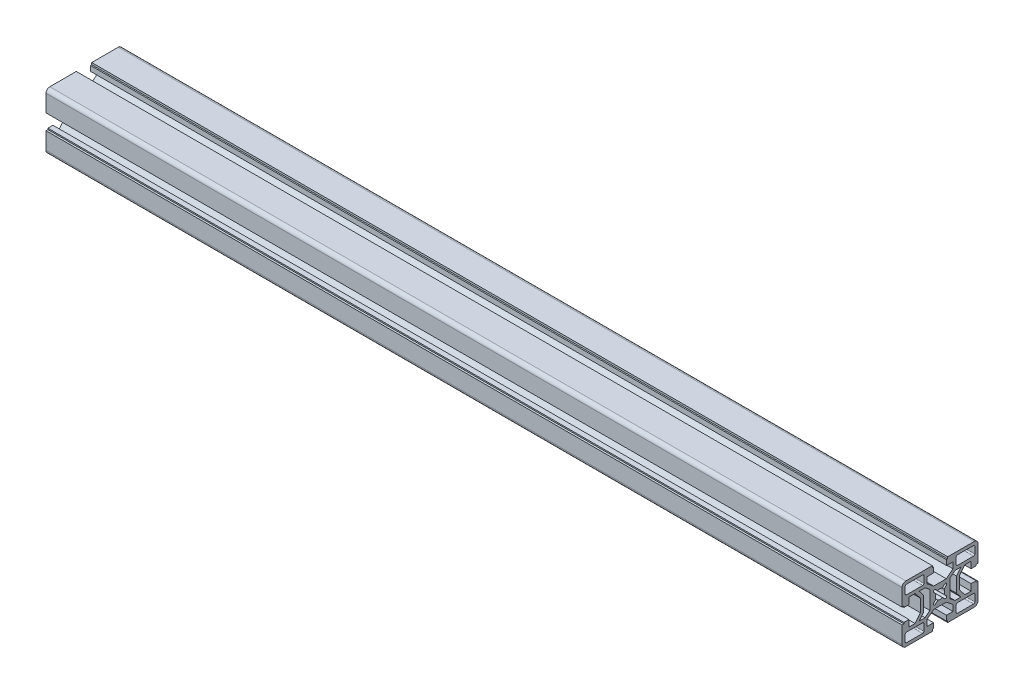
ISO-10303-21;
HEADER;
FILE_DESCRIPTION(('STEP AP214'),'2;1');
FILE_NAME('part.step','',(''),(''),'','','');
FILE_SCHEMA(('AUTOMOTIVE_DESIGN { 1 0 10303 214 1 1 1 1 }'));
ENDSEC;
DATA;
#1=APPLICATION_CONTEXT('core data for automotive mechanical design processes');
#2=APPLICATION_PROTOCOL_DEFINITION('international standard','automotive_design',2000,#1);
#3=PRODUCT_CONTEXT('',#1,'mechanical');
#4=PRODUCT('Part','Part','',(#3));
#5=PRODUCT_RELATED_PRODUCT_CATEGORY('part','',(#4));
#6=PRODUCT_DEFINITION_FORMATION('','',#4);
#7=PRODUCT_DEFINITION_CONTEXT('part definition',#1,'design');
#8=PRODUCT_DEFINITION('design','',#6,#7);
#9=PRODUCT_DEFINITION_SHAPE('','',#8);
#10=(LENGTH_UNIT() NAMED_UNIT(*) SI_UNIT(.MILLI.,.METRE.));
#11=(NAMED_UNIT(*) PLANE_ANGLE_UNIT() SI_UNIT($,.RADIAN.));
#12=(NAMED_UNIT(*) SI_UNIT($,.STERADIAN.) SOLID_ANGLE_UNIT());
#13=UNCERTAINTY_MEASURE_WITH_UNIT(LENGTH_MEASURE(1.E-05),#10,'distance_accuracy_value','');
#14=(GEOMETRIC_REPRESENTATION_CONTEXT(3) GLOBAL_UNCERTAINTY_ASSIGNED_CONTEXT((#13)) GLOBAL_UNIT_ASSIGNED_CONTEXT((#10,
#11,#12)) REPRESENTATION_CONTEXT('',''));
#15=CARTESIAN_POINT('',(0.,0.,0.));
#16=DIRECTION('',(0.,0.,1.));
#17=DIRECTION('',(1.,0.,0.));
#18=AXIS2_PLACEMENT_3D('',#15,#16,#17);
#19=CARTESIAN_POINT('',(676.,-19.5,-27.));
#20=DIRECTION('',(-1.,0.,0.));
#21=DIRECTION('',(0.,0.,1.));
#22=AXIS2_PLACEMENT_3D('',#19,#20,#21);
#23=PLANE('',#22);
#24=DIRECTION('',(0.,0.782608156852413,0.622514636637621));
#25=VECTOR('',#24,1.);
#26=CARTESIAN_POINT('',(676.,-5.87303908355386,-13.));
#27=LINE('',#26,#25);
#28=CARTESIAN_POINT('',(676.,-10.25,-16.4815919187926));
#29=VERTEX_POINT('',#28);
#30=CARTESIAN_POINT('',(676.,-5.87303908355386,-13.));
#31=VERTEX_POINT('',#30);
#32=EDGE_CURVE('E939',#29,#31,#27,.T.);
#33=ORIENTED_EDGE('',*,*,#32,.F.);
#34=DIRECTION('',(0.,0.,-1.));
#35=VECTOR('',#34,1.);
#36=CARTESIAN_POINT('',(676.,-10.25,-16.4815919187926));
#37=LINE('',#36,#35);
#38=CARTESIAN_POINT('',(676.,-10.25,-11.8446075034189));
#39=VERTEX_POINT('',#38);
#40=EDGE_CURVE('E955',#39,#29,#37,.T.);
#41=ORIENTED_EDGE('',*,*,#40,.F.);
#42=DIRECTION('',(0.,-0.62251463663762,-0.782608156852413));
#43=VECTOR('',#42,1.);
#44=CARTESIAN_POINT('',(676.,-10.25,-11.8446075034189));
#45=LINE('',#44,#43);
#46=CARTESIAN_POINT('',(676.,-7.19186110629,-8.00000000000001));
#47=VERTEX_POINT('',#46);
#48=EDGE_CURVE('E952',#47,#39,#45,.T.);
#49=ORIENTED_EDGE('',*,*,#48,.F.);
#50=DIRECTION('',(0.,-1.,0.));
#51=VECTOR('',#50,1.);
#52=CARTESIAN_POINT('',(676.,7.19186110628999,-8.00000000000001));
#53=LINE('',#52,#51);
#54=CARTESIAN_POINT('',(676.,7.19186110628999,-8.00000000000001));
#55=VERTEX_POINT('',#54);
#56=EDGE_CURVE('E950',#55,#47,#53,.T.);
#57=ORIENTED_EDGE('',*,*,#56,.F.);
#58=DIRECTION('',(0.,-0.62251463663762,0.782608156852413));
#59=VECTOR('',#58,1.);
#60=CARTESIAN_POINT('',(676.,10.25,-11.8446075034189));
#61=LINE('',#60,#59);
#62=CARTESIAN_POINT('',(676.,10.25,-11.8446075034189));
#63=VERTEX_POINT('',#62);
#64=EDGE_CURVE('E948',#63,#55,#61,.T.);
#65=ORIENTED_EDGE('',*,*,#64,.F.);
#66=DIRECTION('',(0.,0.,1.));
#67=VECTOR('',#66,1.);
#68=CARTESIAN_POINT('',(676.,10.25,-16.4815919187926));
#69=LINE('',#68,#67);
#70=CARTESIAN_POINT('',(676.,10.25,-16.4815919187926));
#71=VERTEX_POINT('',#70);
#72=EDGE_CURVE('E946',#71,#63,#69,.T.);
#73=ORIENTED_EDGE('',*,*,#72,.F.);
#74=DIRECTION('',(0.,0.782608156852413,-0.622514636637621));
#75=VECTOR('',#74,1.);
#76=CARTESIAN_POINT('',(676.,5.87303908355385,-13.));
#77=LINE('',#76,#75);
#78=CARTESIAN_POINT('',(676.,5.87303908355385,-13.));
#79=VERTEX_POINT('',#78);
#80=EDGE_CURVE('E944',#79,#71,#77,.T.);
#81=ORIENTED_EDGE('',*,*,#80,.F.);
#82=DIRECTION('',(0.,1.,0.));
#83=VECTOR('',#82,1.);
#84=CARTESIAN_POINT('',(676.,-5.87303908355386,-13.));
#85=LINE('',#84,#83);
#86=EDGE_CURVE('E941',#31,#79,#85,.T.);
#87=ORIENTED_EDGE('',*,*,#86,.F.);
#88=EDGE_LOOP('',(#33,#41,#49,#57,#65,#73,#81,#87));
#89=FACE_BOUND('',#88,.T.);
#90=CARTESIAN_POINT('',(676.,-13.75,-26.5));
#91=DIRECTION('',(1.,0.,0.));
#92=DIRECTION('',(0.,0.,-1.));
#93=AXIS2_PLACEMENT_3D('',#90,#91,#92);
#94=CIRCLE('',#93,1.);
#95=CARTESIAN_POINT('',(676.,-13.75,-27.5));
#96=VERTEX_POINT('',#95);
#97=CARTESIAN_POINT('',(676.,-12.75,-26.5));
#98=VERTEX_POINT('',#97);
#99=EDGE_CURVE('E1057',#96,#98,#94,.T.);
#100=ORIENTED_EDGE('',*,*,#99,.F.);
#101=DIRECTION('',(0.,1.,0.));
#102=VECTOR('',#101,1.);
#103=CARTESIAN_POINT('',(676.,-19.,-27.5));
#104=LINE('',#103,#102);
#105=CARTESIAN_POINT('',(676.,-19.,-27.5));
#106=VERTEX_POINT('',#105);
#107=EDGE_CURVE('E1073',#106,#96,#104,.T.);
#108=ORIENTED_EDGE('',*,*,#107,.F.);
#109=CARTESIAN_POINT('',(676.,-19.,-26.5));
#110=DIRECTION('',(1.,0.,0.));
#111=DIRECTION('',(0.,0.,-1.));
#112=AXIS2_PLACEMENT_3D('',#109,#110,#111);
#113=CIRCLE('',#112,0.999999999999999);
#114=CARTESIAN_POINT('',(676.,-20.,-26.5));
#115=VERTEX_POINT('',#114);
#116=EDGE_CURVE('E1070',#115,#106,#113,.T.);
#117=ORIENTED_EDGE('',*,*,#116,.F.);
#118=DIRECTION('',(0.,0.,-1.));
#119=VECTOR('',#118,1.);
#120=CARTESIAN_POINT('',(676.,-20.,-26.5));
#121=LINE('',#120,#119);
#122=CARTESIAN_POINT('',(676.,-20.,-13.75));
#123=VERTEX_POINT('',#122);
#124=EDGE_CURVE('E1068',#123,#115,#121,.T.);
#125=ORIENTED_EDGE('',*,*,#124,.F.);
#126=CARTESIAN_POINT('',(676.,-19.,-13.75));
#127=DIRECTION('',(1.,0.,0.));
#128=DIRECTION('',(0.,0.,1.));
#129=AXIS2_PLACEMENT_3D('',#126,#127,#128);
#130=CIRCLE('',#129,1.);
#131=CARTESIAN_POINT('',(676.,-19.,-12.75));
#132=VERTEX_POINT('',#131);
#133=EDGE_CURVE('E1066',#132,#123,#130,.T.);
#134=ORIENTED_EDGE('',*,*,#133,.F.);
#135=DIRECTION('',(0.,-1.,0.));
#136=VECTOR('',#135,1.);
#137=CARTESIAN_POINT('',(676.,-19.,-12.75));
#138=LINE('',#137,#136);
#139=CARTESIAN_POINT('',(676.,-13.75,-12.75));
#140=VERTEX_POINT('',#139);
#141=EDGE_CURVE('E1064',#140,#132,#138,.T.);
#142=ORIENTED_EDGE('',*,*,#141,.F.);
#143=CARTESIAN_POINT('',(676.,-13.75,-13.75));
#144=DIRECTION('',(1.,0.,0.));
#145=DIRECTION('',(0.,0.,-1.));
#146=AXIS2_PLACEMENT_3D('',#143,#144,#145);
#147=CIRCLE('',#146,1.);
#148=CARTESIAN_POINT('',(676.,-12.75,-13.75));
#149=VERTEX_POINT('',#148);
#150=EDGE_CURVE('E1062',#149,#140,#147,.T.);
#151=ORIENTED_EDGE('',*,*,#150,.F.);
#152=DIRECTION('',(0.,0.,1.));
#153=VECTOR('',#152,1.);
#154=CARTESIAN_POINT('',(676.,-12.75,-26.5));
#155=LINE('',#154,#153);
#156=EDGE_CURVE('E1059',#98,#149,#155,.T.);
#157=ORIENTED_EDGE('',*,*,#156,.F.);
#158=EDGE_LOOP('',(#100,#108,#117,#125,#134,#142,#151,#157));
#159=FACE_BOUND('',#158,.T.);
#160=CARTESIAN_POINT('',(676.,19.,13.75));
#161=DIRECTION('',(1.,0.,0.));
#162=DIRECTION('',(0.,0.,1.));
#163=AXIS2_PLACEMENT_3D('',#160,#161,#162);
#164=CIRCLE('',#163,1.);
#165=CARTESIAN_POINT('',(676.,19.,12.75));
#166=VERTEX_POINT('',#165);
#167=CARTESIAN_POINT('',(676.,20.,13.75));
#168=VERTEX_POINT('',#167);
#169=EDGE_CURVE('E1175',#166,#168,#164,.T.);
#170=ORIENTED_EDGE('',*,*,#169,.F.);
#171=DIRECTION('',(0.,1.,0.));
#172=VECTOR('',#171,1.);
#173=CARTESIAN_POINT('',(676.,19.,12.75));
#174=LINE('',#173,#172);
#175=CARTESIAN_POINT('',(676.,13.75,12.75));
#176=VERTEX_POINT('',#175);
#177=EDGE_CURVE('E1191',#176,#166,#174,.T.);
#178=ORIENTED_EDGE('',*,*,#177,.F.);
#179=CARTESIAN_POINT('',(676.,13.75,13.75));
#180=DIRECTION('',(1.,0.,0.));
#181=DIRECTION('',(0.,0.,-1.));
#182=AXIS2_PLACEMENT_3D('',#179,#180,#181);
#183=CIRCLE('',#182,1.);
#184=CARTESIAN_POINT('',(676.,12.75,13.75));
#185=VERTEX_POINT('',#184);
#186=EDGE_CURVE('E1188',#185,#176,#183,.T.);
#187=ORIENTED_EDGE('',*,*,#186,.F.);
#188=DIRECTION('',(0.,0.,-1.));
#189=VECTOR('',#188,1.);
#190=CARTESIAN_POINT('',(676.,12.75,26.5));
#191=LINE('',#190,#189);
#192=CARTESIAN_POINT('',(676.,12.75,26.5));
#193=VERTEX_POINT('',#192);
#194=EDGE_CURVE('E1186',#193,#185,#191,.T.);
#195=ORIENTED_EDGE('',*,*,#194,.F.);
#196=CARTESIAN_POINT('',(676.,13.75,26.5));
#197=DIRECTION('',(1.,0.,0.));
#198=DIRECTION('',(0.,0.,-1.));
#199=AXIS2_PLACEMENT_3D('',#196,#197,#198);
#200=CIRCLE('',#199,1.);
#201=CARTESIAN_POINT('',(676.,13.75,27.5));
#202=VERTEX_POINT('',#201);
#203=EDGE_CURVE('E1184',#202,#193,#200,.T.);
#204=ORIENTED_EDGE('',*,*,#203,.F.);
#205=DIRECTION('',(0.,-1.,0.));
#206=VECTOR('',#205,1.);
#207=CARTESIAN_POINT('',(676.,19.,27.5));
#208=LINE('',#207,#206);
#209=CARTESIAN_POINT('',(676.,19.,27.5));
#210=VERTEX_POINT('',#209);
#211=EDGE_CURVE('E1182',#210,#202,#208,.T.);
#212=ORIENTED_EDGE('',*,*,#211,.F.);
#213=CARTESIAN_POINT('',(676.,19.,26.5));
#214=DIRECTION('',(1.,0.,0.));
#215=DIRECTION('',(0.,0.,-1.));
#216=AXIS2_PLACEMENT_3D('',#213,#214,#215);
#217=CIRCLE('',#216,0.999999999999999);
#218=CARTESIAN_POINT('',(676.,20.,26.5));
#219=VERTEX_POINT('',#218);
#220=EDGE_CURVE('E1180',#219,#210,#217,.T.);
#221=ORIENTED_EDGE('',*,*,#220,.F.);
#222=DIRECTION('',(0.,0.,1.));
#223=VECTOR('',#222,1.);
#224=CARTESIAN_POINT('',(676.,20.,26.5));
#225=LINE('',#224,#223);
#226=EDGE_CURVE('E1177',#168,#219,#225,.T.);
#227=ORIENTED_EDGE('',*,*,#226,.F.);
#228=EDGE_LOOP('',(#170,#178,#187,#195,#204,#212,#221,#227));
#229=FACE_BOUND('',#228,.T.);
#230=DIRECTION('',(0.,0.62251463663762,-0.782608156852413));
#231=VECTOR('',#230,1.);
#232=CARTESIAN_POINT('',(676.,-12.1760385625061,10.25));
#233=LINE('',#232,#231);
#234=CARTESIAN_POINT('',(676.,-12.1760385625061,10.25));
#235=VERTEX_POINT('',#234);
#236=CARTESIAN_POINT('',(676.,-8.00000000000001,5.));
#237=VERTEX_POINT('',#236);
#238=EDGE_CURVE('E1293',#235,#237,#233,.T.);
#239=ORIENTED_EDGE('',*,*,#238,.T.);
#240=DIRECTION('',(0.,0.,-1.));
#241=VECTOR('',#240,1.);
#242=CARTESIAN_POINT('',(676.,-8.00000000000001,5.));
#243=LINE('',#242,#241);
#244=CARTESIAN_POINT('',(676.,-8.00000000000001,-5.00000000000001));
#245=VERTEX_POINT('',#244);
#246=EDGE_CURVE('E1296',#237,#245,#243,.T.);
#247=ORIENTED_EDGE('',*,*,#246,.T.);
#248=DIRECTION('',(0.,-0.62251463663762,-0.782608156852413));
#249=VECTOR('',#248,1.);
#250=CARTESIAN_POINT('',(676.,-12.1760385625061,-10.25));
#251=LINE('',#250,#249);
#252=CARTESIAN_POINT('',(676.,-12.1760385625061,-10.25));
#253=VERTEX_POINT('',#252);
#254=EDGE_CURVE('E1299',#245,#253,#251,.T.);
#255=ORIENTED_EDGE('',*,*,#254,.T.);
#256=DIRECTION('',(0.,-1.,0.));
#257=VECTOR('',#256,1.);
#258=CARTESIAN_POINT('',(676.,-17.,-10.25));
#259=LINE('',#258,#257);
#260=CARTESIAN_POINT('',(676.,-17.,-10.25));
#261=VERTEX_POINT('',#260);
#262=EDGE_CURVE('E1301',#253,#261,#259,.T.);
#263=ORIENTED_EDGE('',*,*,#262,.T.);
#264=DIRECTION('',(0.,0.,1.));
#265=VECTOR('',#264,1.);
#266=CARTESIAN_POINT('',(676.,-17.,-5.10000000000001));
#267=LINE('',#266,#265);
#268=CARTESIAN_POINT('',(676.,-17.,-5.10000000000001));
#269=VERTEX_POINT('',#268);
#270=EDGE_CURVE('E1303',#261,#269,#267,.T.);
#271=ORIENTED_EDGE('',*,*,#270,.T.);
#272=DIRECTION('',(0.,-1.,0.));
#273=VECTOR('',#272,1.);
#274=CARTESIAN_POINT('',(676.,-21.,-5.10000000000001));
#275=LINE('',#274,#273);
#276=CARTESIAN_POINT('',(676.,-21.,-5.10000000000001));
#277=VERTEX_POINT('',#276);
#278=EDGE_CURVE('E1305',#269,#277,#275,.T.);
#279=ORIENTED_EDGE('',*,*,#278,.T.);
#280=DIRECTION('',(0.,0.,-1.));
#281=VECTOR('',#280,1.);
#282=CARTESIAN_POINT('',(676.,-21.,-6.1));
#283=LINE('',#282,#281);
#284=CARTESIAN_POINT('',(676.,-21.,-6.1));
#285=VERTEX_POINT('',#284);
#286=EDGE_CURVE('E1307',#277,#285,#283,.T.);
#287=ORIENTED_EDGE('',*,*,#286,.T.);
#288=DIRECTION('',(0.,-1.,0.));
#289=VECTOR('',#288,1.);
#290=CARTESIAN_POINT('',(676.,-22.5,-6.1));
#291=LINE('',#290,#289);
#292=CARTESIAN_POINT('',(676.,-22.5,-6.1));
#293=VERTEX_POINT('',#292);
#294=EDGE_CURVE('E1309',#285,#293,#291,.T.);
#295=ORIENTED_EDGE('',*,*,#294,.T.);
#296=DIRECTION('',(0.,0.,-1.));
#297=VECTOR('',#296,1.);
#298=CARTESIAN_POINT('',(676.,-22.5,-27.));
#299=LINE('',#298,#297);
#300=CARTESIAN_POINT('',(676.,-22.5,-27.));
#301=VERTEX_POINT('',#300);
#302=EDGE_CURVE('E1311',#293,#301,#299,.T.);
#303=ORIENTED_EDGE('',*,*,#302,.T.);
#304=CARTESIAN_POINT('',(676.,-19.5,-27.));
#305=DIRECTION('',(1.,0.,0.));
#306=DIRECTION('',(0.,0.,1.));
#307=AXIS2_PLACEMENT_3D('',#304,#305,#306);
#308=CIRCLE('',#307,3.);
#309=CARTESIAN_POINT('',(676.,-19.5,-30.));
#310=VERTEX_POINT('',#309);
#311=EDGE_CURVE('E1313',#301,#310,#308,.T.);
#312=ORIENTED_EDGE('',*,*,#311,.T.);
#313=DIRECTION('',(0.,1.,0.));
#314=VECTOR('',#313,1.);
#315=CARTESIAN_POINT('',(676.,-6.10000000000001,-30.));
#316=LINE('',#315,#314);
#317=CARTESIAN_POINT('',(676.,-6.10000000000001,-30.));
#318=VERTEX_POINT('',#317);
#319=EDGE_CURVE('E1315',#310,#318,#316,.T.);
#320=ORIENTED_EDGE('',*,*,#319,.T.);
#321=DIRECTION('',(0.,0.,1.));
#322=VECTOR('',#321,1.);
#323=CARTESIAN_POINT('',(676.,-6.10000000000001,-30.));
#324=LINE('',#323,#322);
#325=CARTESIAN_POINT('',(676.,-6.10000000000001,-28.5));
#326=VERTEX_POINT('',#325);
#327=EDGE_CURVE('E1317',#318,#326,#324,.T.);
#328=ORIENTED_EDGE('',*,*,#327,.T.);
#329=DIRECTION('',(0.,1.,0.));
#330=VECTOR('',#329,1.);
#331=CARTESIAN_POINT('',(676.,-6.10000000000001,-28.5));
#332=LINE('',#331,#330);
#333=CARTESIAN_POINT('',(676.,-5.10000000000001,-28.5));
#334=VERTEX_POINT('',#333);
#335=EDGE_CURVE('E1319',#326,#334,#332,.T.);
#336=ORIENTED_EDGE('',*,*,#335,.T.);
#337=DIRECTION('',(0.,0.,1.));
#338=VECTOR('',#337,1.);
#339=CARTESIAN_POINT('',(676.,-5.10000000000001,-28.5));
#340=LINE('',#339,#338);
#341=CARTESIAN_POINT('',(676.,-5.10000000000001,-24.5));
#342=VERTEX_POINT('',#341);
#343=EDGE_CURVE('E1321',#334,#342,#340,.T.);
#344=ORIENTED_EDGE('',*,*,#343,.T.);
#345=DIRECTION('',(0.,-1.,0.));
#346=VECTOR('',#345,1.);
#347=CARTESIAN_POINT('',(676.,-5.10000000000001,-24.5));
#348=LINE('',#347,#346);
#349=CARTESIAN_POINT('',(676.,-10.25,-24.5));
#350=VERTEX_POINT('',#349);
#351=EDGE_CURVE('E1323',#342,#350,#348,.T.);
#352=ORIENTED_EDGE('',*,*,#351,.T.);
#353=DIRECTION('',(0.,0.,1.));
#354=VECTOR('',#353,1.);
#355=CARTESIAN_POINT('',(676.,-10.25,-24.5));
#356=LINE('',#355,#354);
#357=CARTESIAN_POINT('',(676.,-10.25,-19.6760385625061));
#358=VERTEX_POINT('',#357);
#359=EDGE_CURVE('E1325',#350,#358,#356,.T.);
#360=ORIENTED_EDGE('',*,*,#359,.T.);
#361=DIRECTION('',(0.,0.782608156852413,0.622514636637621));
#362=VECTOR('',#361,1.);
#363=CARTESIAN_POINT('',(676.,-10.25,-19.6760385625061));
#364=LINE('',#363,#362);
#365=CARTESIAN_POINT('',(676.,-5.00000000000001,-15.5));
#366=VERTEX_POINT('',#365);
#367=EDGE_CURVE('E1327',#358,#366,#364,.T.);
#368=ORIENTED_EDGE('',*,*,#367,.T.);
#369=DIRECTION('',(0.,1.,0.));
#370=VECTOR('',#369,1.);
#371=CARTESIAN_POINT('',(676.,5.,-15.5));
#372=LINE('',#371,#370);
#373=CARTESIAN_POINT('',(676.,5.,-15.5));
#374=VERTEX_POINT('',#373);
#375=EDGE_CURVE('E1329',#366,#374,#372,.T.);
#376=ORIENTED_EDGE('',*,*,#375,.T.);
#377=DIRECTION('',(0.,0.782608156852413,-0.622514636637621));
#378=VECTOR('',#377,1.);
#379=CARTESIAN_POINT('',(676.,10.25,-19.6760385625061));
#380=LINE('',#379,#378);
#381=CARTESIAN_POINT('',(676.,10.25,-19.6760385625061));
#382=VERTEX_POINT('',#381);
#383=EDGE_CURVE('E1331',#374,#382,#380,.T.);
#384=ORIENTED_EDGE('',*,*,#383,.T.);
#385=DIRECTION('',(0.,0.,-1.));
#386=VECTOR('',#385,1.);
#387=CARTESIAN_POINT('',(676.,10.25,-24.5));
#388=LINE('',#387,#386);
#389=CARTESIAN_POINT('',(676.,10.25,-24.5));
#390=VERTEX_POINT('',#389);
#391=EDGE_CURVE('E1333',#382,#390,#388,.T.);
#392=ORIENTED_EDGE('',*,*,#391,.T.);
#393=DIRECTION('',(0.,-1.,0.));
#394=VECTOR('',#393,1.);
#395=CARTESIAN_POINT('',(676.,5.1,-24.5));
#396=LINE('',#395,#394);
#397=CARTESIAN_POINT('',(676.,5.1,-24.5));
#398=VERTEX_POINT('',#397);
#399=EDGE_CURVE('E1335',#390,#398,#396,.T.);
#400=ORIENTED_EDGE('',*,*,#399,.T.);
#401=DIRECTION('',(0.,0.,-1.));
#402=VECTOR('',#401,1.);
#403=CARTESIAN_POINT('',(676.,5.1,-28.5));
#404=LINE('',#403,#402);
#405=CARTESIAN_POINT('',(676.,5.1,-28.5));
#406=VERTEX_POINT('',#405);
#407=EDGE_CURVE('E1337',#398,#406,#404,.T.);
#408=ORIENTED_EDGE('',*,*,#407,.T.);
#409=DIRECTION('',(0.,1.,0.));
#410=VECTOR('',#409,1.);
#411=CARTESIAN_POINT('',(676.,6.1,-28.5));
#412=LINE('',#411,#410);
#413=CARTESIAN_POINT('',(676.,6.1,-28.5));
#414=VERTEX_POINT('',#413);
#415=EDGE_CURVE('E1339',#406,#414,#412,.T.);
#416=ORIENTED_EDGE('',*,*,#415,.T.);
#417=DIRECTION('',(0.,0.,-1.));
#418=VECTOR('',#417,1.);
#419=CARTESIAN_POINT('',(676.,6.1,-30.));
#420=LINE('',#419,#418);
#421=CARTESIAN_POINT('',(676.,6.1,-30.));
#422=VERTEX_POINT('',#421);
#423=EDGE_CURVE('E1341',#414,#422,#420,.T.);
#424=ORIENTED_EDGE('',*,*,#423,.T.);
#425=DIRECTION('',(0.,1.,0.));
#426=VECTOR('',#425,1.);
#427=CARTESIAN_POINT('',(676.,6.1,-30.));
#428=LINE('',#427,#426);
#429=CARTESIAN_POINT('',(676.,19.5,-30.));
#430=VERTEX_POINT('',#429);
#431=EDGE_CURVE('E1343',#422,#430,#428,.T.);
#432=ORIENTED_EDGE('',*,*,#431,.T.);
#433=CARTESIAN_POINT('',(676.,19.5,-27.));
#434=DIRECTION('',(1.,0.,0.));
#435=DIRECTION('',(0.,0.,1.));
#436=AXIS2_PLACEMENT_3D('',#433,#434,#435);
#437=CIRCLE('',#436,3.);
#438=CARTESIAN_POINT('',(676.,22.5,-27.));
#439=VERTEX_POINT('',#438);
#440=EDGE_CURVE('E1345',#430,#439,#437,.T.);
#441=ORIENTED_EDGE('',*,*,#440,.T.);
#442=DIRECTION('',(0.,0.,1.));
#443=VECTOR('',#442,1.);
#444=CARTESIAN_POINT('',(676.,22.5,-27.));
#445=LINE('',#444,#443);
#446=CARTESIAN_POINT('',(676.,22.5,-6.1));
#447=VERTEX_POINT('',#446);
#448=EDGE_CURVE('E1347',#439,#447,#445,.T.);
#449=ORIENTED_EDGE('',*,*,#448,.T.);
#450=DIRECTION('',(0.,-1.,0.));
#451=VECTOR('',#450,1.);
#452=CARTESIAN_POINT('',(676.,22.5,-6.1));
#453=LINE('',#452,#451);
#454=CARTESIAN_POINT('',(676.,21.,-6.1));
#455=VERTEX_POINT('',#454);
#456=EDGE_CURVE('E1349',#447,#455,#453,.T.);
#457=ORIENTED_EDGE('',*,*,#456,.T.);
#458=DIRECTION('',(0.,0.,1.));
#459=VECTOR('',#458,1.);
#460=CARTESIAN_POINT('',(676.,21.,-6.1));
#461=LINE('',#460,#459);
#462=CARTESIAN_POINT('',(676.,21.,-5.10000000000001));
#463=VERTEX_POINT('',#462);
#464=EDGE_CURVE('E1351',#455,#463,#461,.T.);
#465=ORIENTED_EDGE('',*,*,#464,.T.);
#466=DIRECTION('',(0.,-1.,0.));
#467=VECTOR('',#466,1.);
#468=CARTESIAN_POINT('',(676.,21.,-5.10000000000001));
#469=LINE('',#468,#467);
#470=CARTESIAN_POINT('',(676.,17.,-5.10000000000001));
#471=VERTEX_POINT('',#470);
#472=EDGE_CURVE('E1353',#463,#471,#469,.T.);
#473=ORIENTED_EDGE('',*,*,#472,.T.);
#474=DIRECTION('',(0.,0.,-1.));
#475=VECTOR('',#474,1.);
#476=CARTESIAN_POINT('',(676.,17.,-5.10000000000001));
#477=LINE('',#476,#475);
#478=CARTESIAN_POINT('',(676.,17.,-10.25));
#479=VERTEX_POINT('',#478);
#480=EDGE_CURVE('E1355',#471,#479,#477,.T.);
#481=ORIENTED_EDGE('',*,*,#480,.T.);
#482=DIRECTION('',(0.,-1.,0.));
#483=VECTOR('',#482,1.);
#484=CARTESIAN_POINT('',(676.,17.,-10.25));
#485=LINE('',#484,#483);
#486=CARTESIAN_POINT('',(676.,12.1760385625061,-10.25));
#487=VERTEX_POINT('',#486);
#488=EDGE_CURVE('E1357',#479,#487,#485,.T.);
#489=ORIENTED_EDGE('',*,*,#488,.T.);
#490=DIRECTION('',(0.,-0.622514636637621,0.782608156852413));
#491=VECTOR('',#490,1.);
#492=CARTESIAN_POINT('',(676.,12.1760385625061,-10.25));
#493=LINE('',#492,#491);
#494=CARTESIAN_POINT('',(676.,7.99999999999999,-5.00000000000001));
#495=VERTEX_POINT('',#494);
#496=EDGE_CURVE('E1359',#487,#495,#493,.T.);
#497=ORIENTED_EDGE('',*,*,#496,.T.);
#498=DIRECTION('',(0.,0.,1.));
#499=VECTOR('',#498,1.);
#500=CARTESIAN_POINT('',(676.,7.99999999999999,5.));
#501=LINE('',#500,#499);
#502=CARTESIAN_POINT('',(676.,7.99999999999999,5.));
#503=VERTEX_POINT('',#502);
#504=EDGE_CURVE('E1361',#495,#503,#501,.T.);
#505=ORIENTED_EDGE('',*,*,#504,.T.);
#506=DIRECTION('',(0.,0.622514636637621,0.782608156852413));
#507=VECTOR('',#506,1.);
#508=CARTESIAN_POINT('',(676.,12.1760385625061,10.25));
#509=LINE('',#508,#507);
#510=CARTESIAN_POINT('',(676.,12.1760385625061,10.25));
#511=VERTEX_POINT('',#510);
#512=EDGE_CURVE('E1363',#503,#511,#509,.T.);
#513=ORIENTED_EDGE('',*,*,#512,.T.);
#514=DIRECTION('',(0.,1.,0.));
#515=VECTOR('',#514,1.);
#516=CARTESIAN_POINT('',(676.,17.,10.25));
#517=LINE('',#516,#515);
#518=CARTESIAN_POINT('',(676.,17.,10.25));
#519=VERTEX_POINT('',#518);
#520=EDGE_CURVE('E1365',#511,#519,#517,.T.);
#521=ORIENTED_EDGE('',*,*,#520,.T.);
#522=DIRECTION('',(0.,0.,-1.));
#523=VECTOR('',#522,1.);
#524=CARTESIAN_POINT('',(676.,17.,5.1));
#525=LINE('',#524,#523);
#526=CARTESIAN_POINT('',(676.,17.,5.1));
#527=VERTEX_POINT('',#526);
#528=EDGE_CURVE('E1367',#519,#527,#525,.T.);
#529=ORIENTED_EDGE('',*,*,#528,.T.);
#530=DIRECTION('',(0.,1.,0.));
#531=VECTOR('',#530,1.);
#532=CARTESIAN_POINT('',(676.,21.,5.1));
#533=LINE('',#532,#531);
#534=CARTESIAN_POINT('',(676.,21.,5.1));
#535=VERTEX_POINT('',#534);
#536=EDGE_CURVE('E1369',#527,#535,#533,.T.);
#537=ORIENTED_EDGE('',*,*,#536,.T.);
#538=DIRECTION('',(0.,0.,1.));
#539=VECTOR('',#538,1.);
#540=CARTESIAN_POINT('',(676.,21.,6.1));
#541=LINE('',#540,#539);
#542=CARTESIAN_POINT('',(676.,21.,6.1));
#543=VERTEX_POINT('',#542);
#544=EDGE_CURVE('E1371',#535,#543,#541,.T.);
#545=ORIENTED_EDGE('',*,*,#544,.T.);
#546=DIRECTION('',(0.,1.,0.));
#547=VECTOR('',#546,1.);
#548=CARTESIAN_POINT('',(676.,22.5,6.1));
#549=LINE('',#548,#547);
#550=CARTESIAN_POINT('',(676.,22.5,6.1));
#551=VERTEX_POINT('',#550);
#552=EDGE_CURVE('E1373',#543,#551,#549,.T.);
#553=ORIENTED_EDGE('',*,*,#552,.T.);
#554=DIRECTION('',(0.,0.,1.));
#555=VECTOR('',#554,1.);
#556=CARTESIAN_POINT('',(676.,22.5,27.));
#557=LINE('',#556,#555);
#558=CARTESIAN_POINT('',(676.,22.5,27.));
#559=VERTEX_POINT('',#558);
#560=EDGE_CURVE('E1375',#551,#559,#557,.T.);
#561=ORIENTED_EDGE('',*,*,#560,.T.);
#562=CARTESIAN_POINT('',(676.,19.5,27.));
#563=DIRECTION('',(1.,0.,0.));
#564=DIRECTION('',(0.,0.,-1.));
#565=AXIS2_PLACEMENT_3D('',#562,#563,#564);
#566=CIRCLE('',#565,3.);
#567=CARTESIAN_POINT('',(676.,19.5,30.));
#568=VERTEX_POINT('',#567);
#569=EDGE_CURVE('E1377',#559,#568,#566,.T.);
#570=ORIENTED_EDGE('',*,*,#569,.T.);
#571=DIRECTION('',(0.,-1.,0.));
#572=VECTOR('',#571,1.);
#573=CARTESIAN_POINT('',(676.,6.1,30.));
#574=LINE('',#573,#572);
#575=CARTESIAN_POINT('',(676.,6.1,30.));
#576=VERTEX_POINT('',#575);
#577=EDGE_CURVE('E1379',#568,#576,#574,.T.);
#578=ORIENTED_EDGE('',*,*,#577,.T.);
#579=DIRECTION('',(0.,0.,-1.));
#580=VECTOR('',#579,1.);
#581=CARTESIAN_POINT('',(676.,6.1,30.));
#582=LINE('',#581,#580);
#583=CARTESIAN_POINT('',(676.,6.1,28.5));
#584=VERTEX_POINT('',#583);
#585=EDGE_CURVE('E1381',#576,#584,#582,.T.);
#586=ORIENTED_EDGE('',*,*,#585,.T.);
#587=DIRECTION('',(0.,-1.,0.));
#588=VECTOR('',#587,1.);
#589=CARTESIAN_POINT('',(676.,6.1,28.5));
#590=LINE('',#589,#588);
#591=CARTESIAN_POINT('',(676.,5.1,28.5));
#592=VERTEX_POINT('',#591);
#593=EDGE_CURVE('E1383',#584,#592,#590,.T.);
#594=ORIENTED_EDGE('',*,*,#593,.T.);
#595=DIRECTION('',(0.,0.,-1.));
#596=VECTOR('',#595,1.);
#597=CARTESIAN_POINT('',(676.,5.1,28.5));
#598=LINE('',#597,#596);
#599=CARTESIAN_POINT('',(676.,5.1,24.5));
#600=VERTEX_POINT('',#599);
#601=EDGE_CURVE('E1385',#592,#600,#598,.T.);
#602=ORIENTED_EDGE('',*,*,#601,.T.);
#603=DIRECTION('',(0.,1.,0.));
#604=VECTOR('',#603,1.);
#605=CARTESIAN_POINT('',(676.,5.1,24.5));
#606=LINE('',#605,#604);
#607=CARTESIAN_POINT('',(676.,10.25,24.5));
#608=VERTEX_POINT('',#607);
#609=EDGE_CURVE('E1387',#600,#608,#606,.T.);
#610=ORIENTED_EDGE('',*,*,#609,.T.);
#611=DIRECTION('',(0.,0.,-1.));
#612=VECTOR('',#611,1.);
#613=CARTESIAN_POINT('',(676.,10.25,24.5));
#614=LINE('',#613,#612);
#615=CARTESIAN_POINT('',(676.,10.25,19.6760385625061));
#616=VERTEX_POINT('',#615);
#617=EDGE_CURVE('E1389',#608,#616,#614,.T.);
#618=ORIENTED_EDGE('',*,*,#617,.T.);
#619=DIRECTION('',(0.,-0.782608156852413,-0.622514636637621));
#620=VECTOR('',#619,1.);
#621=CARTESIAN_POINT('',(676.,10.25,19.6760385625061));
#622=LINE('',#621,#620);
#623=CARTESIAN_POINT('',(676.,5.,15.5));
#624=VERTEX_POINT('',#623);
#625=EDGE_CURVE('E1391',#616,#624,#622,.T.);
#626=ORIENTED_EDGE('',*,*,#625,.T.);
#627=DIRECTION('',(0.,-1.,0.));
#628=VECTOR('',#627,1.);
#629=CARTESIAN_POINT('',(676.,5.,15.5));
#630=LINE('',#629,#628);
#631=CARTESIAN_POINT('',(676.,-5.00000000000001,15.5));
#632=VERTEX_POINT('',#631);
#633=EDGE_CURVE('E1393',#624,#632,#630,.T.);
#634=ORIENTED_EDGE('',*,*,#633,.T.);
#635=DIRECTION('',(0.,-0.782608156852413,0.622514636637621));
#636=VECTOR('',#635,1.);
#637=CARTESIAN_POINT('',(676.,-10.25,19.6760385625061));
#638=LINE('',#637,#636);
#639=CARTESIAN_POINT('',(676.,-10.25,19.6760385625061));
#640=VERTEX_POINT('',#639);
#641=EDGE_CURVE('E1395',#632,#640,#638,.T.);
#642=ORIENTED_EDGE('',*,*,#641,.T.);
#643=DIRECTION('',(0.,0.,1.));
#644=VECTOR('',#643,1.);
#645=CARTESIAN_POINT('',(676.,-10.25,24.5));
#646=LINE('',#645,#644);
#647=CARTESIAN_POINT('',(676.,-10.25,24.5));
#648=VERTEX_POINT('',#647);
#649=EDGE_CURVE('E1397',#640,#648,#646,.T.);
#650=ORIENTED_EDGE('',*,*,#649,.T.);
#651=DIRECTION('',(0.,1.,0.));
#652=VECTOR('',#651,1.);
#653=CARTESIAN_POINT('',(676.,-5.10000000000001,24.5));
#654=LINE('',#653,#652);
#655=CARTESIAN_POINT('',(676.,-5.10000000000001,24.5));
#656=VERTEX_POINT('',#655);
#657=EDGE_CURVE('E1399',#648,#656,#654,.T.);
#658=ORIENTED_EDGE('',*,*,#657,.T.);
#659=DIRECTION('',(0.,0.,1.));
#660=VECTOR('',#659,1.);
#661=CARTESIAN_POINT('',(676.,-5.10000000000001,28.5));
#662=LINE('',#661,#660);
#663=CARTESIAN_POINT('',(676.,-5.10000000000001,28.5));
#664=VERTEX_POINT('',#663);
#665=EDGE_CURVE('E1401',#656,#664,#662,.T.);
#666=ORIENTED_EDGE('',*,*,#665,.T.);
#667=DIRECTION('',(0.,-1.,0.));
#668=VECTOR('',#667,1.);
#669=CARTESIAN_POINT('',(676.,-6.10000000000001,28.5));
#670=LINE('',#669,#668);
#671=CARTESIAN_POINT('',(676.,-6.10000000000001,28.5));
#672=VERTEX_POINT('',#671);
#673=EDGE_CURVE('E1403',#664,#672,#670,.T.);
#674=ORIENTED_EDGE('',*,*,#673,.T.);
#675=DIRECTION('',(0.,0.,1.));
#676=VECTOR('',#675,1.);
#677=CARTESIAN_POINT('',(676.,-6.10000000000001,30.));
#678=LINE('',#677,#676);
#679=CARTESIAN_POINT('',(676.,-6.10000000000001,30.));
#680=VERTEX_POINT('',#679);
#681=EDGE_CURVE('E1405',#672,#680,#678,.T.);
#682=ORIENTED_EDGE('',*,*,#681,.T.);
#683=DIRECTION('',(0.,-1.,0.));
#684=VECTOR('',#683,1.);
#685=CARTESIAN_POINT('',(676.,-6.10000000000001,30.));
#686=LINE('',#685,#684);
#687=CARTESIAN_POINT('',(676.,-19.5,30.));
#688=VERTEX_POINT('',#687);
#689=EDGE_CURVE('E1407',#680,#688,#686,.T.);
#690=ORIENTED_EDGE('',*,*,#689,.T.);
#691=CARTESIAN_POINT('',(676.,-19.5,27.));
#692=DIRECTION('',(1.,0.,0.));
#693=DIRECTION('',(0.,0.,1.));
#694=AXIS2_PLACEMENT_3D('',#691,#692,#693);
#695=CIRCLE('',#694,3.);
#696=CARTESIAN_POINT('',(676.,-22.5,27.));
#697=VERTEX_POINT('',#696);
#698=EDGE_CURVE('E1409',#688,#697,#695,.T.);
#699=ORIENTED_EDGE('',*,*,#698,.T.);
#700=DIRECTION('',(0.,0.,-1.));
#701=VECTOR('',#700,1.);
#702=CARTESIAN_POINT('',(676.,-22.5,27.));
#703=LINE('',#702,#701);
#704=CARTESIAN_POINT('',(676.,-22.5,6.1));
#705=VERTEX_POINT('',#704);
#706=EDGE_CURVE('E1411',#697,#705,#703,.T.);
#707=ORIENTED_EDGE('',*,*,#706,.T.);
#708=DIRECTION('',(0.,1.,0.));
#709=VECTOR('',#708,1.);
#710=CARTESIAN_POINT('',(676.,-22.5,6.1));
#711=LINE('',#710,#709);
#712=CARTESIAN_POINT('',(676.,-21.,6.1));
#713=VERTEX_POINT('',#712);
#714=EDGE_CURVE('E1413',#705,#713,#711,.T.);
#715=ORIENTED_EDGE('',*,*,#714,.T.);
#716=DIRECTION('',(0.,0.,-1.));
#717=VECTOR('',#716,1.);
#718=CARTESIAN_POINT('',(676.,-21.,6.1));
#719=LINE('',#718,#717);
#720=CARTESIAN_POINT('',(676.,-21.,5.1));
#721=VERTEX_POINT('',#720);
#722=EDGE_CURVE('E1415',#713,#721,#719,.T.);
#723=ORIENTED_EDGE('',*,*,#722,.T.);
#724=DIRECTION('',(0.,1.,0.));
#725=VECTOR('',#724,1.);
#726=CARTESIAN_POINT('',(676.,-21.,5.1));
#727=LINE('',#726,#725);
#728=CARTESIAN_POINT('',(676.,-17.,5.1));
#729=VERTEX_POINT('',#728);
#730=EDGE_CURVE('E1417',#721,#729,#727,.T.);
#731=ORIENTED_EDGE('',*,*,#730,.T.);
#732=DIRECTION('',(0.,0.,1.));
#733=VECTOR('',#732,1.);
#734=CARTESIAN_POINT('',(676.,-17.,5.1));
#735=LINE('',#734,#733);
#736=CARTESIAN_POINT('',(676.,-17.,10.25));
#737=VERTEX_POINT('',#736);
#738=EDGE_CURVE('E1419',#729,#737,#735,.T.);
#739=ORIENTED_EDGE('',*,*,#738,.T.);
#740=DIRECTION('',(0.,1.,0.));
#741=VECTOR('',#740,1.);
#742=CARTESIAN_POINT('',(676.,-17.,10.25));
#743=LINE('',#742,#741);
#744=EDGE_CURVE('E1421',#737,#235,#743,.T.);
#745=ORIENTED_EDGE('',*,*,#744,.T.);
#746=EDGE_LOOP('',(#239,#247,#255,#263,#271,#279,#287,#295,#303,#312,#320,#328,#336,#344,#352,
#360,#368,#376,#384,#392,#400,#408,#416,#424,#432,#441,#449,#457,#465,#473,#481,#489,#497,#505,
#513,#521,#529,#537,#545,#553,#561,#570,#578,#586,#594,#602,#610,#618,#626,#634,#642,#650,#658,
#666,#674,#682,#690,#699,#707,#715,#723,#731,#739,#745));
#747=FACE_BOUND('',#746,.T.);
#748=DIRECTION('',(0.,-0.782608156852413,-0.62251463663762));
#749=VECTOR('',#748,1.);
#750=CARTESIAN_POINT('',(676.,5.87303908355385,13.));
#751=LINE('',#750,#749);
#752=CARTESIAN_POINT('',(676.,10.25,16.4815919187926));
#753=VERTEX_POINT('',#752);
#754=CARTESIAN_POINT('',(676.,5.87303908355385,13.));
#755=VERTEX_POINT('',#754);
#756=EDGE_CURVE('E1234',#753,#755,#751,.T.);
#757=ORIENTED_EDGE('',*,*,#756,.F.);
#758=DIRECTION('',(0.,0.,1.));
#759=VECTOR('',#758,1.);
#760=CARTESIAN_POINT('',(676.,10.25,16.4815919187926));
#761=LINE('',#760,#759);
#762=CARTESIAN_POINT('',(676.,10.25,11.8446075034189));
#763=VERTEX_POINT('',#762);
#764=EDGE_CURVE('E1250',#763,#753,#761,.T.);
#765=ORIENTED_EDGE('',*,*,#764,.F.);
#766=DIRECTION('',(0.,0.62251463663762,0.782608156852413));
#767=VECTOR('',#766,1.);
#768=CARTESIAN_POINT('',(676.,10.25,11.8446075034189));
#769=LINE('',#768,#767);
#770=CARTESIAN_POINT('',(676.,7.19186110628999,8.));
#771=VERTEX_POINT('',#770);
#772=EDGE_CURVE('E1247',#771,#763,#769,.T.);
#773=ORIENTED_EDGE('',*,*,#772,.F.);
#774=DIRECTION('',(0.,1.,0.));
#775=VECTOR('',#774,1.);
#776=CARTESIAN_POINT('',(676.,7.19186110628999,8.));
#777=LINE('',#776,#775);
#778=CARTESIAN_POINT('',(676.,-7.19186110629,8.));
#779=VERTEX_POINT('',#778);
#780=EDGE_CURVE('E1245',#779,#771,#777,.T.);
#781=ORIENTED_EDGE('',*,*,#780,.F.);
#782=DIRECTION('',(0.,0.62251463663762,-0.782608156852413));
#783=VECTOR('',#782,1.);
#784=CARTESIAN_POINT('',(676.,-10.25,11.8446075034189));
#785=LINE('',#784,#783);
#786=CARTESIAN_POINT('',(676.,-10.25,11.8446075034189));
#787=VERTEX_POINT('',#786);
#788=EDGE_CURVE('E1243',#787,#779,#785,.T.);
#789=ORIENTED_EDGE('',*,*,#788,.F.);
#790=DIRECTION('',(0.,0.,-1.));
#791=VECTOR('',#790,1.);
#792=CARTESIAN_POINT('',(676.,-10.25,16.4815919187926));
#793=LINE('',#792,#791);
#794=CARTESIAN_POINT('',(676.,-10.25,16.4815919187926));
#795=VERTEX_POINT('',#794);
#796=EDGE_CURVE('E1241',#795,#787,#793,.T.);
#797=ORIENTED_EDGE('',*,*,#796,.F.);
#798=DIRECTION('',(0.,-0.782608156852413,0.622514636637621));
#799=VECTOR('',#798,1.);
#800=CARTESIAN_POINT('',(676.,-5.87303908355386,13.));
#801=LINE('',#800,#799);
#802=CARTESIAN_POINT('',(676.,-5.87303908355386,13.));
#803=VERTEX_POINT('',#802);
#804=EDGE_CURVE('E1239',#803,#795,#801,.T.);
#805=ORIENTED_EDGE('',*,*,#804,.F.);
#806=DIRECTION('',(0.,-1.,0.));
#807=VECTOR('',#806,1.);
#808=CARTESIAN_POINT('',(676.,-5.87303908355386,13.));
#809=LINE('',#808,#807);
#810=EDGE_CURVE('E1236',#755,#803,#809,.T.);
#811=ORIENTED_EDGE('',*,*,#810,.F.);
#812=EDGE_LOOP('',(#757,#765,#773,#781,#789,#797,#805,#811));
#813=FACE_BOUND('',#812,.T.);
#814=CARTESIAN_POINT('',(676.,-13.75,26.5));
#815=DIRECTION('',(1.,0.,0.));
#816=DIRECTION('',(0.,0.,1.));
#817=AXIS2_PLACEMENT_3D('',#814,#815,#816);
#818=CIRCLE('',#817,1.);
#819=CARTESIAN_POINT('',(676.,-12.75,26.5));
#820=VERTEX_POINT('',#819);
#821=CARTESIAN_POINT('',(676.,-13.75,27.5));
#822=VERTEX_POINT('',#821);
#823=EDGE_CURVE('E1116',#820,#822,#818,.T.);
#824=ORIENTED_EDGE('',*,*,#823,.F.);
#825=DIRECTION('',(0.,0.,1.));
#826=VECTOR('',#825,1.);
#827=CARTESIAN_POINT('',(676.,-12.75,26.5));
#828=LINE('',#827,#826);
#829=CARTESIAN_POINT('',(676.,-12.75,13.75));
#830=VERTEX_POINT('',#829);
#831=EDGE_CURVE('E1132',#830,#820,#828,.T.);
#832=ORIENTED_EDGE('',*,*,#831,.F.);
#833=CARTESIAN_POINT('',(676.,-13.75,13.75));
#834=DIRECTION('',(1.,0.,0.));
#835=DIRECTION('',(0.,0.,1.));
#836=AXIS2_PLACEMENT_3D('',#833,#834,#835);
#837=CIRCLE('',#836,1.);
#838=CARTESIAN_POINT('',(676.,-13.75,12.75));
#839=VERTEX_POINT('',#838);
#840=EDGE_CURVE('E1129',#839,#830,#837,.T.);
#841=ORIENTED_EDGE('',*,*,#840,.F.);
#842=DIRECTION('',(0.,1.,0.));
#843=VECTOR('',#842,1.);
#844=CARTESIAN_POINT('',(676.,-19.,12.75));
#845=LINE('',#844,#843);
#846=CARTESIAN_POINT('',(676.,-19.,12.75));
#847=VERTEX_POINT('',#846);
#848=EDGE_CURVE('E1127',#847,#839,#845,.T.);
#849=ORIENTED_EDGE('',*,*,#848,.F.);
#850=CARTESIAN_POINT('',(676.,-19.,13.75));
#851=DIRECTION('',(1.,0.,0.));
#852=DIRECTION('',(0.,0.,-1.));
#853=AXIS2_PLACEMENT_3D('',#850,#851,#852);
#854=CIRCLE('',#853,1.);
#855=CARTESIAN_POINT('',(676.,-20.,13.75));
#856=VERTEX_POINT('',#855);
#857=EDGE_CURVE('E1125',#856,#847,#854,.T.);
#858=ORIENTED_EDGE('',*,*,#857,.F.);
#859=DIRECTION('',(0.,0.,-1.));
#860=VECTOR('',#859,1.);
#861=CARTESIAN_POINT('',(676.,-20.,26.5));
#862=LINE('',#861,#860);
#863=CARTESIAN_POINT('',(676.,-20.,26.5));
#864=VERTEX_POINT('',#863);
#865=EDGE_CURVE('E1123',#864,#856,#862,.T.);
#866=ORIENTED_EDGE('',*,*,#865,.F.);
#867=CARTESIAN_POINT('',(676.,-19.,26.5));
#868=DIRECTION('',(1.,0.,0.));
#869=DIRECTION('',(0.,0.,1.));
#870=AXIS2_PLACEMENT_3D('',#867,#868,#869);
#871=CIRCLE('',#870,0.999999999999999);
#872=CARTESIAN_POINT('',(676.,-19.,27.5));
#873=VERTEX_POINT('',#872);
#874=EDGE_CURVE('E1121',#873,#864,#871,.T.);
#875=ORIENTED_EDGE('',*,*,#874,.F.);
#876=DIRECTION('',(0.,-1.,0.));
#877=VECTOR('',#876,1.);
#878=CARTESIAN_POINT('',(676.,-19.,27.5));
#879=LINE('',#878,#877);
#880=EDGE_CURVE('E1118',#822,#873,#879,.T.);
#881=ORIENTED_EDGE('',*,*,#880,.F.);
#882=EDGE_LOOP('',(#824,#832,#841,#849,#858,#866,#875,#881));
#883=FACE_BOUND('',#882,.T.);
#884=CARTESIAN_POINT('',(676.,13.75,-26.5));
#885=DIRECTION('',(1.,0.,0.));
#886=DIRECTION('',(0.,0.,1.));
#887=AXIS2_PLACEMENT_3D('',#884,#885,#886);
#888=CIRCLE('',#887,1.);
#889=CARTESIAN_POINT('',(676.,12.75,-26.5));
#890=VERTEX_POINT('',#889);
#891=CARTESIAN_POINT('',(676.,13.75,-27.5));
#892=VERTEX_POINT('',#891);
#893=EDGE_CURVE('E998',#890,#892,#888,.T.);
#894=ORIENTED_EDGE('',*,*,#893,.F.);
#895=DIRECTION('',(0.,0.,-1.));
#896=VECTOR('',#895,1.);
#897=CARTESIAN_POINT('',(676.,12.75,-26.5));
#898=LINE('',#897,#896);
#899=CARTESIAN_POINT('',(676.,12.75,-13.75));
#900=VERTEX_POINT('',#899);
#901=EDGE_CURVE('E1014',#900,#890,#898,.T.);
#902=ORIENTED_EDGE('',*,*,#901,.F.);
#903=CARTESIAN_POINT('',(676.,13.75,-13.75));
#904=DIRECTION('',(1.,0.,0.));
#905=DIRECTION('',(0.,0.,1.));
#906=AXIS2_PLACEMENT_3D('',#903,#904,#905);
#907=CIRCLE('',#906,1.);
#908=CARTESIAN_POINT('',(676.,13.75,-12.75));
#909=VERTEX_POINT('',#908);
#910=EDGE_CURVE('E1011',#909,#900,#907,.T.);
#911=ORIENTED_EDGE('',*,*,#910,.F.);
#912=DIRECTION('',(0.,-1.,0.));
#913=VECTOR('',#912,1.);
#914=CARTESIAN_POINT('',(676.,19.,-12.75));
#915=LINE('',#914,#913);
#916=CARTESIAN_POINT('',(676.,19.,-12.75));
#917=VERTEX_POINT('',#916);
#918=EDGE_CURVE('E1009',#917,#909,#915,.T.);
#919=ORIENTED_EDGE('',*,*,#918,.F.);
#920=CARTESIAN_POINT('',(676.,19.,-13.75));
#921=DIRECTION('',(1.,0.,0.));
#922=DIRECTION('',(0.,0.,-1.));
#923=AXIS2_PLACEMENT_3D('',#920,#921,#922);
#924=CIRCLE('',#923,1.);
#925=CARTESIAN_POINT('',(676.,20.,-13.75));
#926=VERTEX_POINT('',#925);
#927=EDGE_CURVE('E1007',#926,#917,#924,.T.);
#928=ORIENTED_EDGE('',*,*,#927,.F.);
#929=DIRECTION('',(0.,0.,1.));
#930=VECTOR('',#929,1.);
#931=CARTESIAN_POINT('',(676.,20.,-26.5));
#932=LINE('',#931,#930);
#933=CARTESIAN_POINT('',(676.,20.,-26.5));
#934=VERTEX_POINT('',#933);
#935=EDGE_CURVE('E1005',#934,#926,#932,.T.);
#936=ORIENTED_EDGE('',*,*,#935,.F.);
#937=CARTESIAN_POINT('',(676.,19.,-26.5));
#938=DIRECTION('',(1.,0.,0.));
#939=DIRECTION('',(0.,0.,1.));
#940=AXIS2_PLACEMENT_3D('',#937,#938,#939);
#941=CIRCLE('',#940,0.999999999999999);
#942=CARTESIAN_POINT('',(676.,19.,-27.5));
#943=VERTEX_POINT('',#942);
#944=EDGE_CURVE('E1003',#943,#934,#941,.T.);
#945=ORIENTED_EDGE('',*,*,#944,.F.);
#946=DIRECTION('',(0.,1.,0.));
#947=VECTOR('',#946,1.);
#948=CARTESIAN_POINT('',(676.,19.,-27.5));
#949=LINE('',#948,#947);
#950=EDGE_CURVE('E1000',#892,#943,#949,.T.);
#951=ORIENTED_EDGE('',*,*,#950,.F.);
#952=EDGE_LOOP('',(#894,#902,#911,#919,#928,#936,#945,#951));
#953=FACE_BOUND('',#952,.T.);
#954=CARTESIAN_POINT('',(676.,0.,0.));
#955=DIRECTION('',(1.,0.,0.));
#956=DIRECTION('',(0.,0.,-1.));
#957=AXIS2_PLACEMENT_3D('',#954,#955,#956);
#958=CIRCLE('',#957,3.70000000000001);
#959=CARTESIAN_POINT('',(676.,3.22603512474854,-1.81182156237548));
#960=VERTEX_POINT('',#959);
#961=CARTESIAN_POINT('',(676.,3.22603512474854,1.81182156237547));
#962=VERTEX_POINT('',#961);
#963=EDGE_CURVE('E818',#960,#962,#958,.T.);
#964=ORIENTED_EDGE('',*,*,#963,.F.);
#965=DIRECTION('',(0.,-0.707106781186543,0.707106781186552));
#966=VECTOR('',#965,1.);
#967=CARTESIAN_POINT('',(676.,4.94974746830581,-3.53553390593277));
#968=LINE('',#967,#966);
#969=CARTESIAN_POINT('',(676.,4.94974746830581,-3.53553390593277));
#970=VERTEX_POINT('',#969);
#971=EDGE_CURVE('E867',#970,#960,#968,.T.);
#972=ORIENTED_EDGE('',*,*,#971,.F.);
#973=CARTESIAN_POINT('',(676.,4.24264068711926,-4.24264068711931));
#974=DIRECTION('',(1.,0.,0.));
#975=DIRECTION('',(0.,0.,1.));
#976=AXIS2_PLACEMENT_3D('',#973,#974,#975);
#977=CIRCLE('',#976,1.);
#978=CARTESIAN_POINT('',(676.,3.53553390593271,-4.94974746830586));
#979=VERTEX_POINT('',#978);
#980=EDGE_CURVE('E865',#979,#970,#977,.T.);
#981=ORIENTED_EDGE('',*,*,#980,.F.);
#982=DIRECTION('',(0.,0.707106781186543,-0.707106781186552));
#983=VECTOR('',#982,1.);
#984=CARTESIAN_POINT('',(676.,3.53553390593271,-4.94974746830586));
#985=LINE('',#984,#983);
#986=CARTESIAN_POINT('',(676.,1.81182156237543,-3.22603512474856));
#987=VERTEX_POINT('',#986);
#988=EDGE_CURVE('E863',#987,#979,#985,.T.);
#989=ORIENTED_EDGE('',*,*,#988,.F.);
#990=CARTESIAN_POINT('',(676.,0.,0.));
#991=DIRECTION('',(1.,0.,0.));
#992=DIRECTION('',(0.,0.,-1.));
#993=AXIS2_PLACEMENT_3D('',#990,#991,#992);
#994=CIRCLE('',#993,3.70000000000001);
#995=CARTESIAN_POINT('',(676.,-1.81182156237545,-3.22603512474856));
#996=VERTEX_POINT('',#995);
#997=EDGE_CURVE('E861',#996,#987,#994,.T.);
#998=ORIENTED_EDGE('',*,*,#997,.F.);
#999=DIRECTION('',(0.,0.707106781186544,0.707106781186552));
#1000=VECTOR('',#999,1.);
#1001=CARTESIAN_POINT('',(676.,-3.53553390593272,-4.94974746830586));
#1002=LINE('',#1001,#1000);
#1003=CARTESIAN_POINT('',(676.,-3.53553390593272,-4.94974746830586));
#1004=VERTEX_POINT('',#1003);
#1005=EDGE_CURVE('E859',#1004,#996,#1002,.T.);
#1006=ORIENTED_EDGE('',*,*,#1005,.F.);
#1007=CARTESIAN_POINT('',(676.,-4.24264068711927,-4.24264068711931));
#1008=DIRECTION('',(1.,0.,0.));
#1009=DIRECTION('',(0.,0.,-1.));
#1010=AXIS2_PLACEMENT_3D('',#1007,#1008,#1009);
#1011=CIRCLE('',#1010,1.);
#1012=CARTESIAN_POINT('',(676.,-4.94974746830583,-3.53553390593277));
#1013=VERTEX_POINT('',#1012);
#1014=EDGE_CURVE('E857',#1013,#1004,#1011,.T.);
#1015=ORIENTED_EDGE('',*,*,#1014,.F.);
#1016=DIRECTION('',(0.,-0.707106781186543,-0.707106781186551));
#1017=VECTOR('',#1016,1.);
#1018=CARTESIAN_POINT('',(676.,-4.94974746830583,-3.53553390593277));
#1019=LINE('',#1018,#1017);
#1020=CARTESIAN_POINT('',(676.,-3.22603512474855,-1.81182156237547));
#1021=VERTEX_POINT('',#1020);
#1022=EDGE_CURVE('E855',#1021,#1013,#1019,.T.);
#1023=ORIENTED_EDGE('',*,*,#1022,.F.);
#1024=CARTESIAN_POINT('',(676.,0.,0.));
#1025=DIRECTION('',(1.,0.,0.));
#1026=DIRECTION('',(0.,0.,-1.));
#1027=AXIS2_PLACEMENT_3D('',#1024,#1025,#1026);
#1028=CIRCLE('',#1027,3.7);
#1029=CARTESIAN_POINT('',(676.,-3.22603512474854,1.81182156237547));
#1030=VERTEX_POINT('',#1029);
#1031=EDGE_CURVE('E853',#1030,#1021,#1028,.T.);
#1032=ORIENTED_EDGE('',*,*,#1031,.F.);
#1033=DIRECTION('',(0.,0.707106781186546,-0.707106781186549));
#1034=VECTOR('',#1033,1.);
#1035=CARTESIAN_POINT('',(676.,-4.94974746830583,3.53553390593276));
#1036=LINE('',#1035,#1034);
#1037=CARTESIAN_POINT('',(676.,-4.94974746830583,3.53553390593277));
#1038=VERTEX_POINT('',#1037);
#1039=EDGE_CURVE('E851',#1038,#1030,#1036,.T.);
#1040=ORIENTED_EDGE('',*,*,#1039,.F.);
#1041=CARTESIAN_POINT('',(676.,-4.24264068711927,4.24264068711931));
#1042=DIRECTION('',(1.,0.,0.));
#1043=DIRECTION('',(0.,0.,1.));
#1044=AXIS2_PLACEMENT_3D('',#1041,#1042,#1043);
#1045=CIRCLE('',#1044,1.);
#1046=CARTESIAN_POINT('',(676.,-3.53553390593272,4.94974746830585));
#1047=VERTEX_POINT('',#1046);
#1048=EDGE_CURVE('E849',#1047,#1038,#1045,.T.);
#1049=ORIENTED_EDGE('',*,*,#1048,.F.);
#1050=DIRECTION('',(0.,-0.707106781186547,0.707106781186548));
#1051=VECTOR('',#1050,1.);
#1052=CARTESIAN_POINT('',(676.,-3.53553390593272,4.94974746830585));
#1053=LINE('',#1052,#1051);
#1054=CARTESIAN_POINT('',(676.,-1.81182156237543,3.22603512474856));
#1055=VERTEX_POINT('',#1054);
#1056=EDGE_CURVE('E847',#1055,#1047,#1053,.T.);
#1057=ORIENTED_EDGE('',*,*,#1056,.F.);
#1058=CARTESIAN_POINT('',(676.,0.,0.));
#1059=DIRECTION('',(1.,0.,0.));
#1060=DIRECTION('',(0.,0.,-1.));
#1061=AXIS2_PLACEMENT_3D('',#1058,#1059,#1060);
#1062=CIRCLE('',#1061,3.7);
#1063=CARTESIAN_POINT('',(676.,1.81182156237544,3.22603512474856));
#1064=VERTEX_POINT('',#1063);
#1065=EDGE_CURVE('E845',#1064,#1055,#1062,.T.);
#1066=ORIENTED_EDGE('',*,*,#1065,.F.);
#1067=DIRECTION('',(0.,-0.707106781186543,-0.707106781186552));
#1068=VECTOR('',#1067,1.);
#1069=CARTESIAN_POINT('',(676.,3.53553390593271,4.94974746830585));
#1070=LINE('',#1069,#1068);
#1071=CARTESIAN_POINT('',(676.,3.53553390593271,4.94974746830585));
#1072=VERTEX_POINT('',#1071);
#1073=EDGE_CURVE('E841',#1072,#1064,#1070,.T.);
#1074=ORIENTED_EDGE('',*,*,#1073,.F.);
#1075=CARTESIAN_POINT('',(676.,4.24264068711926,4.24264068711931));
#1076=DIRECTION('',(1.,0.,0.));
#1077=DIRECTION('',(0.,0.,-1.));
#1078=AXIS2_PLACEMENT_3D('',#1075,#1076,#1077);
#1079=CIRCLE('',#1078,1.);
#1080=CARTESIAN_POINT('',(676.,4.94974746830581,3.53553390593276));
#1081=VERTEX_POINT('',#1080);
#1082=EDGE_CURVE('E839',#1081,#1072,#1079,.T.);
#1083=ORIENTED_EDGE('',*,*,#1082,.F.);
#1084=DIRECTION('',(0.,0.707106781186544,0.707106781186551));
#1085=VECTOR('',#1084,1.);
#1086=CARTESIAN_POINT('',(676.,4.94974746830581,3.53553390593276));
#1087=LINE('',#1086,#1085);
#1088=EDGE_CURVE('E826',#962,#1081,#1087,.T.);
#1089=ORIENTED_EDGE('',*,*,#1088,.F.);
#1090=EDGE_LOOP('',(#964,#972,#981,#989,#998,#1006,#1015,#1023,#1032,#1040,#1049,#1057,#1066,
#1074,#1083,#1089));
#1091=FACE_BOUND('',#1090,.T.);
#1092=ADVANCED_FACE('F33',(#89,#159,#229,#747,#813,#883,#953,#1091),#23,.F.);
#1093=CARTESIAN_POINT('',(0.,-19.5,-27.));
#1094=DIRECTION('',(-1.,0.,0.));
#1095=DIRECTION('',(0.,0.,1.));
#1096=AXIS2_PLACEMENT_3D('',#1093,#1094,#1095);
#1097=PLANE('',#1096);
#1098=DIRECTION('',(0.,0.62251463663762,-0.782608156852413));
#1099=VECTOR('',#1098,1.);
#1100=CARTESIAN_POINT('',(0.,-12.1760385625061,10.25));
#1101=LINE('',#1100,#1099);
#1102=CARTESIAN_POINT('',(0.,-12.1760385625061,10.25));
#1103=VERTEX_POINT('',#1102);
#1104=CARTESIAN_POINT('',(0.,-8.00000000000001,5.));
#1105=VERTEX_POINT('',#1104);
#1106=EDGE_CURVE('E1292',#1103,#1105,#1101,.T.);
#1107=ORIENTED_EDGE('',*,*,#1106,.F.);
#1108=DIRECTION('',(0.,1.,0.));
#1109=VECTOR('',#1108,1.);
#1110=CARTESIAN_POINT('',(0.,-17.,10.25));
#1111=LINE('',#1110,#1109);
#1112=CARTESIAN_POINT('',(0.,-17.,10.25));
#1113=VERTEX_POINT('',#1112);
#1114=EDGE_CURVE('E1297',#1113,#1103,#1111,.T.);
#1115=ORIENTED_EDGE('',*,*,#1114,.F.);
#1116=DIRECTION('',(0.,0.,1.));
#1117=VECTOR('',#1116,1.);
#1118=CARTESIAN_POINT('',(0.,-17.,5.1));
#1119=LINE('',#1118,#1117);
#1120=CARTESIAN_POINT('',(0.,-17.,5.1));
#1121=VERTEX_POINT('',#1120);
#1122=EDGE_CURVE('E1548',#1121,#1113,#1119,.T.);
#1123=ORIENTED_EDGE('',*,*,#1122,.F.);
#1124=DIRECTION('',(0.,1.,0.));
#1125=VECTOR('',#1124,1.);
#1126=CARTESIAN_POINT('',(0.,-21.,5.1));
#1127=LINE('',#1126,#1125);
#1128=CARTESIAN_POINT('',(0.,-21.,5.1));
#1129=VERTEX_POINT('',#1128);
#1130=EDGE_CURVE('E1546',#1129,#1121,#1127,.T.);
#1131=ORIENTED_EDGE('',*,*,#1130,.F.);
#1132=DIRECTION('',(0.,0.,-1.));
#1133=VECTOR('',#1132,1.);
#1134=CARTESIAN_POINT('',(0.,-21.,6.1));
#1135=LINE('',#1134,#1133);
#1136=CARTESIAN_POINT('',(0.,-21.,6.1));
#1137=VERTEX_POINT('',#1136);
#1138=EDGE_CURVE('E1544',#1137,#1129,#1135,.T.);
#1139=ORIENTED_EDGE('',*,*,#1138,.F.);
#1140=DIRECTION('',(0.,1.,0.));
#1141=VECTOR('',#1140,1.);
#1142=CARTESIAN_POINT('',(0.,-22.5,6.1));
#1143=LINE('',#1142,#1141);
#1144=CARTESIAN_POINT('',(0.,-22.5,6.1));
#1145=VERTEX_POINT('',#1144);
#1146=EDGE_CURVE('E1542',#1145,#1137,#1143,.T.);
#1147=ORIENTED_EDGE('',*,*,#1146,.F.);
#1148=DIRECTION('',(0.,0.,-1.));
#1149=VECTOR('',#1148,1.);
#1150=CARTESIAN_POINT('',(0.,-22.5,27.));
#1151=LINE('',#1150,#1149);
#1152=CARTESIAN_POINT('',(0.,-22.5,27.));
#1153=VERTEX_POINT('',#1152);
#1154=EDGE_CURVE('E1540',#1153,#1145,#1151,.T.);
#1155=ORIENTED_EDGE('',*,*,#1154,.F.);
#1156=CARTESIAN_POINT('',(0.,-19.5,27.));
#1157=DIRECTION('',(1.,0.,0.));
#1158=DIRECTION('',(0.,0.,1.));
#1159=AXIS2_PLACEMENT_3D('',#1156,#1157,#1158);
#1160=CIRCLE('',#1159,3.);
#1161=CARTESIAN_POINT('',(0.,-19.5,30.));
#1162=VERTEX_POINT('',#1161);
#1163=EDGE_CURVE('E1538',#1162,#1153,#1160,.T.);
#1164=ORIENTED_EDGE('',*,*,#1163,.F.);
#1165=DIRECTION('',(0.,-1.,0.));
#1166=VECTOR('',#1165,1.);
#1167=CARTESIAN_POINT('',(0.,-6.10000000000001,30.));
#1168=LINE('',#1167,#1166);
#1169=CARTESIAN_POINT('',(0.,-6.10000000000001,30.));
#1170=VERTEX_POINT('',#1169);
#1171=EDGE_CURVE('E1536',#1170,#1162,#1168,.T.);
#1172=ORIENTED_EDGE('',*,*,#1171,.F.);
#1173=DIRECTION('',(0.,0.,1.));
#1174=VECTOR('',#1173,1.);
#1175=CARTESIAN_POINT('',(0.,-6.10000000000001,30.));
#1176=LINE('',#1175,#1174);
#1177=CARTESIAN_POINT('',(0.,-6.10000000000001,28.5));
#1178=VERTEX_POINT('',#1177);
#1179=EDGE_CURVE('E1534',#1178,#1170,#1176,.T.);
#1180=ORIENTED_EDGE('',*,*,#1179,.F.);
#1181=DIRECTION('',(0.,-1.,0.));
#1182=VECTOR('',#1181,1.);
#1183=CARTESIAN_POINT('',(0.,-6.10000000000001,28.5));
#1184=LINE('',#1183,#1182);
#1185=CARTESIAN_POINT('',(0.,-5.10000000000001,28.5));
#1186=VERTEX_POINT('',#1185);
#1187=EDGE_CURVE('E1532',#1186,#1178,#1184,.T.);
#1188=ORIENTED_EDGE('',*,*,#1187,.F.);
#1189=DIRECTION('',(0.,0.,1.));
#1190=VECTOR('',#1189,1.);
#1191=CARTESIAN_POINT('',(0.,-5.10000000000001,28.5));
#1192=LINE('',#1191,#1190);
#1193=CARTESIAN_POINT('',(0.,-5.10000000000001,24.5));
#1194=VERTEX_POINT('',#1193);
#1195=EDGE_CURVE('E1530',#1194,#1186,#1192,.T.);
#1196=ORIENTED_EDGE('',*,*,#1195,.F.);
#1197=DIRECTION('',(0.,1.,0.));
#1198=VECTOR('',#1197,1.);
#1199=CARTESIAN_POINT('',(0.,-5.10000000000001,24.5));
#1200=LINE('',#1199,#1198);
#1201=CARTESIAN_POINT('',(0.,-10.25,24.5));
#1202=VERTEX_POINT('',#1201);
#1203=EDGE_CURVE('E1528',#1202,#1194,#1200,.T.);
#1204=ORIENTED_EDGE('',*,*,#1203,.F.);
#1205=DIRECTION('',(0.,0.,1.));
#1206=VECTOR('',#1205,1.);
#1207=CARTESIAN_POINT('',(0.,-10.25,24.5));
#1208=LINE('',#1207,#1206);
#1209=CARTESIAN_POINT('',(0.,-10.25,19.6760385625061));
#1210=VERTEX_POINT('',#1209);
#1211=EDGE_CURVE('E1526',#1210,#1202,#1208,.T.);
#1212=ORIENTED_EDGE('',*,*,#1211,.F.);
#1213=DIRECTION('',(0.,-0.782608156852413,0.622514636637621));
#1214=VECTOR('',#1213,1.);
#1215=CARTESIAN_POINT('',(0.,-10.25,19.6760385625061));
#1216=LINE('',#1215,#1214);
#1217=CARTESIAN_POINT('',(0.,-5.00000000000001,15.5));
#1218=VERTEX_POINT('',#1217);
#1219=EDGE_CURVE('E1524',#1218,#1210,#1216,.T.);
#1220=ORIENTED_EDGE('',*,*,#1219,.F.);
#1221=DIRECTION('',(0.,-1.,0.));
#1222=VECTOR('',#1221,1.);
#1223=CARTESIAN_POINT('',(0.,5.,15.5));
#1224=LINE('',#1223,#1222);
#1225=CARTESIAN_POINT('',(0.,5.,15.5));
#1226=VERTEX_POINT('',#1225);
#1227=EDGE_CURVE('E1522',#1226,#1218,#1224,.T.);
#1228=ORIENTED_EDGE('',*,*,#1227,.F.);
#1229=DIRECTION('',(0.,-0.782608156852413,-0.622514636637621));
#1230=VECTOR('',#1229,1.);
#1231=CARTESIAN_POINT('',(0.,10.25,19.6760385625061));
#1232=LINE('',#1231,#1230);
#1233=CARTESIAN_POINT('',(0.,10.25,19.6760385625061));
#1234=VERTEX_POINT('',#1233);
#1235=EDGE_CURVE('E1520',#1234,#1226,#1232,.T.);
#1236=ORIENTED_EDGE('',*,*,#1235,.F.);
#1237=DIRECTION('',(0.,0.,-1.));
#1238=VECTOR('',#1237,1.);
#1239=CARTESIAN_POINT('',(0.,10.25,24.5));
#1240=LINE('',#1239,#1238);
#1241=CARTESIAN_POINT('',(0.,10.25,24.5));
#1242=VERTEX_POINT('',#1241);
#1243=EDGE_CURVE('E1518',#1242,#1234,#1240,.T.);
#1244=ORIENTED_EDGE('',*,*,#1243,.F.);
#1245=DIRECTION('',(0.,1.,0.));
#1246=VECTOR('',#1245,1.);
#1247=CARTESIAN_POINT('',(0.,5.1,24.5));
#1248=LINE('',#1247,#1246);
#1249=CARTESIAN_POINT('',(0.,5.1,24.5));
#1250=VERTEX_POINT('',#1249);
#1251=EDGE_CURVE('E1516',#1250,#1242,#1248,.T.);
#1252=ORIENTED_EDGE('',*,*,#1251,.F.);
#1253=DIRECTION('',(0.,0.,-1.));
#1254=VECTOR('',#1253,1.);
#1255=CARTESIAN_POINT('',(0.,5.1,28.5));
#1256=LINE('',#1255,#1254);
#1257=CARTESIAN_POINT('',(0.,5.1,28.5));
#1258=VERTEX_POINT('',#1257);
#1259=EDGE_CURVE('E1514',#1258,#1250,#1256,.T.);
#1260=ORIENTED_EDGE('',*,*,#1259,.F.);
#1261=DIRECTION('',(0.,-1.,0.));
#1262=VECTOR('',#1261,1.);
#1263=CARTESIAN_POINT('',(0.,6.1,28.5));
#1264=LINE('',#1263,#1262);
#1265=CARTESIAN_POINT('',(0.,6.1,28.5));
#1266=VERTEX_POINT('',#1265);
#1267=EDGE_CURVE('E1512',#1266,#1258,#1264,.T.);
#1268=ORIENTED_EDGE('',*,*,#1267,.F.);
#1269=DIRECTION('',(0.,0.,-1.));
#1270=VECTOR('',#1269,1.);
#1271=CARTESIAN_POINT('',(0.,6.1,30.));
#1272=LINE('',#1271,#1270);
#1273=CARTESIAN_POINT('',(0.,6.1,30.));
#1274=VERTEX_POINT('',#1273);
#1275=EDGE_CURVE('E1510',#1274,#1266,#1272,.T.);
#1276=ORIENTED_EDGE('',*,*,#1275,.F.);
#1277=DIRECTION('',(0.,-1.,0.));
#1278=VECTOR('',#1277,1.);
#1279=CARTESIAN_POINT('',(0.,6.1,30.));
#1280=LINE('',#1279,#1278);
#1281=CARTESIAN_POINT('',(0.,19.5,30.));
#1282=VERTEX_POINT('',#1281);
#1283=EDGE_CURVE('E1508',#1282,#1274,#1280,.T.);
#1284=ORIENTED_EDGE('',*,*,#1283,.F.);
#1285=CARTESIAN_POINT('',(0.,19.5,27.));
#1286=DIRECTION('',(1.,0.,0.));
#1287=DIRECTION('',(0.,0.,-1.));
#1288=AXIS2_PLACEMENT_3D('',#1285,#1286,#1287);
#1289=CIRCLE('',#1288,3.);
#1290=CARTESIAN_POINT('',(0.,22.5,27.));
#1291=VERTEX_POINT('',#1290);
#1292=EDGE_CURVE('E1506',#1291,#1282,#1289,.T.);
#1293=ORIENTED_EDGE('',*,*,#1292,.F.);
#1294=DIRECTION('',(0.,0.,1.));
#1295=VECTOR('',#1294,1.);
#1296=CARTESIAN_POINT('',(0.,22.5,27.));
#1297=LINE('',#1296,#1295);
#1298=CARTESIAN_POINT('',(0.,22.5,6.1));
#1299=VERTEX_POINT('',#1298);
#1300=EDGE_CURVE('E1504',#1299,#1291,#1297,.T.);
#1301=ORIENTED_EDGE('',*,*,#1300,.F.);
#1302=DIRECTION('',(0.,1.,0.));
#1303=VECTOR('',#1302,1.);
#1304=CARTESIAN_POINT('',(0.,22.5,6.1));
#1305=LINE('',#1304,#1303);
#1306=CARTESIAN_POINT('',(0.,21.,6.1));
#1307=VERTEX_POINT('',#1306);
#1308=EDGE_CURVE('E1502',#1307,#1299,#1305,.T.);
#1309=ORIENTED_EDGE('',*,*,#1308,.F.);
#1310=DIRECTION('',(0.,0.,1.));
#1311=VECTOR('',#1310,1.);
#1312=CARTESIAN_POINT('',(0.,21.,6.1));
#1313=LINE('',#1312,#1311);
#1314=CARTESIAN_POINT('',(0.,21.,5.1));
#1315=VERTEX_POINT('',#1314);
#1316=EDGE_CURVE('E1500',#1315,#1307,#1313,.T.);
#1317=ORIENTED_EDGE('',*,*,#1316,.F.);
#1318=DIRECTION('',(0.,1.,0.));
#1319=VECTOR('',#1318,1.);
#1320=CARTESIAN_POINT('',(0.,21.,5.1));
#1321=LINE('',#1320,#1319);
#1322=CARTESIAN_POINT('',(0.,17.,5.1));
#1323=VERTEX_POINT('',#1322);
#1324=EDGE_CURVE('E1498',#1323,#1315,#1321,.T.);
#1325=ORIENTED_EDGE('',*,*,#1324,.F.);
#1326=DIRECTION('',(0.,0.,-1.));
#1327=VECTOR('',#1326,1.);
#1328=CARTESIAN_POINT('',(0.,17.,5.1));
#1329=LINE('',#1328,#1327);
#1330=CARTESIAN_POINT('',(0.,17.,10.25));
#1331=VERTEX_POINT('',#1330);
#1332=EDGE_CURVE('E1496',#1331,#1323,#1329,.T.);
#1333=ORIENTED_EDGE('',*,*,#1332,.F.);
#1334=DIRECTION('',(0.,1.,0.));
#1335=VECTOR('',#1334,1.);
#1336=CARTESIAN_POINT('',(0.,17.,10.25));
#1337=LINE('',#1336,#1335);
#1338=CARTESIAN_POINT('',(0.,12.1760385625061,10.25));
#1339=VERTEX_POINT('',#1338);
#1340=EDGE_CURVE('E1494',#1339,#1331,#1337,.T.);
#1341=ORIENTED_EDGE('',*,*,#1340,.F.);
#1342=DIRECTION('',(0.,0.622514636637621,0.782608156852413));
#1343=VECTOR('',#1342,1.);
#1344=CARTESIAN_POINT('',(0.,12.1760385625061,10.25));
#1345=LINE('',#1344,#1343);
#1346=CARTESIAN_POINT('',(0.,7.99999999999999,5.));
#1347=VERTEX_POINT('',#1346);
#1348=EDGE_CURVE('E1492',#1347,#1339,#1345,.T.);
#1349=ORIENTED_EDGE('',*,*,#1348,.F.);
#1350=DIRECTION('',(0.,0.,1.));
#1351=VECTOR('',#1350,1.);
#1352=CARTESIAN_POINT('',(0.,7.99999999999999,5.));
#1353=LINE('',#1352,#1351);
#1354=CARTESIAN_POINT('',(0.,7.99999999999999,-5.00000000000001));
#1355=VERTEX_POINT('',#1354);
#1356=EDGE_CURVE('E1490',#1355,#1347,#1353,.T.);
#1357=ORIENTED_EDGE('',*,*,#1356,.F.);
#1358=DIRECTION('',(0.,-0.622514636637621,0.782608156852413));
#1359=VECTOR('',#1358,1.);
#1360=CARTESIAN_POINT('',(0.,12.1760385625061,-10.25));
#1361=LINE('',#1360,#1359);
#1362=CARTESIAN_POINT('',(0.,12.1760385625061,-10.25));
#1363=VERTEX_POINT('',#1362);
#1364=EDGE_CURVE('E1488',#1363,#1355,#1361,.T.);
#1365=ORIENTED_EDGE('',*,*,#1364,.F.);
#1366=DIRECTION('',(0.,-1.,0.));
#1367=VECTOR('',#1366,1.);
#1368=CARTESIAN_POINT('',(0.,17.,-10.25));
#1369=LINE('',#1368,#1367);
#1370=CARTESIAN_POINT('',(0.,17.,-10.25));
#1371=VERTEX_POINT('',#1370);
#1372=EDGE_CURVE('E1486',#1371,#1363,#1369,.T.);
#1373=ORIENTED_EDGE('',*,*,#1372,.F.);
#1374=DIRECTION('',(0.,0.,-1.));
#1375=VECTOR('',#1374,1.);
#1376=CARTESIAN_POINT('',(0.,17.,-5.10000000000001));
#1377=LINE('',#1376,#1375);
#1378=CARTESIAN_POINT('',(0.,17.,-5.10000000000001));
#1379=VERTEX_POINT('',#1378);
#1380=EDGE_CURVE('E1484',#1379,#1371,#1377,.T.);
#1381=ORIENTED_EDGE('',*,*,#1380,.F.);
#1382=DIRECTION('',(0.,-1.,0.));
#1383=VECTOR('',#1382,1.);
#1384=CARTESIAN_POINT('',(0.,21.,-5.10000000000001));
#1385=LINE('',#1384,#1383);
#1386=CARTESIAN_POINT('',(0.,21.,-5.10000000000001));
#1387=VERTEX_POINT('',#1386);
#1388=EDGE_CURVE('E1482',#1387,#1379,#1385,.T.);
#1389=ORIENTED_EDGE('',*,*,#1388,.F.);
#1390=DIRECTION('',(0.,0.,1.));
#1391=VECTOR('',#1390,1.);
#1392=CARTESIAN_POINT('',(0.,21.,-6.1));
#1393=LINE('',#1392,#1391);
#1394=CARTESIAN_POINT('',(0.,21.,-6.1));
#1395=VERTEX_POINT('',#1394);
#1396=EDGE_CURVE('E1480',#1395,#1387,#1393,.T.);
#1397=ORIENTED_EDGE('',*,*,#1396,.F.);
#1398=DIRECTION('',(0.,-1.,0.));
#1399=VECTOR('',#1398,1.);
#1400=CARTESIAN_POINT('',(0.,22.5,-6.1));
#1401=LINE('',#1400,#1399);
#1402=CARTESIAN_POINT('',(0.,22.5,-6.1));
#1403=VERTEX_POINT('',#1402);
#1404=EDGE_CURVE('E1478',#1403,#1395,#1401,.T.);
#1405=ORIENTED_EDGE('',*,*,#1404,.F.);
#1406=DIRECTION('',(0.,0.,1.));
#1407=VECTOR('',#1406,1.);
#1408=CARTESIAN_POINT('',(0.,22.5,-27.));
#1409=LINE('',#1408,#1407);
#1410=CARTESIAN_POINT('',(0.,22.5,-27.));
#1411=VERTEX_POINT('',#1410);
#1412=EDGE_CURVE('E1476',#1411,#1403,#1409,.T.);
#1413=ORIENTED_EDGE('',*,*,#1412,.F.);
#1414=CARTESIAN_POINT('',(0.,19.5,-27.));
#1415=DIRECTION('',(1.,0.,0.));
#1416=DIRECTION('',(0.,0.,1.));
#1417=AXIS2_PLACEMENT_3D('',#1414,#1415,#1416);
#1418=CIRCLE('',#1417,3.);
#1419=CARTESIAN_POINT('',(0.,19.5,-30.));
#1420=VERTEX_POINT('',#1419);
#1421=EDGE_CURVE('E1474',#1420,#1411,#1418,.T.);
#1422=ORIENTED_EDGE('',*,*,#1421,.F.);
#1423=DIRECTION('',(0.,1.,0.));
#1424=VECTOR('',#1423,1.);
#1425=CARTESIAN_POINT('',(0.,6.1,-30.));
#1426=LINE('',#1425,#1424);
#1427=CARTESIAN_POINT('',(0.,6.1,-30.));
#1428=VERTEX_POINT('',#1427);
#1429=EDGE_CURVE('E1472',#1428,#1420,#1426,.T.);
#1430=ORIENTED_EDGE('',*,*,#1429,.F.);
#1431=DIRECTION('',(0.,0.,-1.));
#1432=VECTOR('',#1431,1.);
#1433=CARTESIAN_POINT('',(0.,6.1,-30.));
#1434=LINE('',#1433,#1432);
#1435=CARTESIAN_POINT('',(0.,6.1,-28.5));
#1436=VERTEX_POINT('',#1435);
#1437=EDGE_CURVE('E1470',#1436,#1428,#1434,.T.);
#1438=ORIENTED_EDGE('',*,*,#1437,.F.);
#1439=DIRECTION('',(0.,1.,0.));
#1440=VECTOR('',#1439,1.);
#1441=CARTESIAN_POINT('',(0.,6.1,-28.5));
#1442=LINE('',#1441,#1440);
#1443=CARTESIAN_POINT('',(0.,5.1,-28.5));
#1444=VERTEX_POINT('',#1443);
#1445=EDGE_CURVE('E1468',#1444,#1436,#1442,.T.);
#1446=ORIENTED_EDGE('',*,*,#1445,.F.);
#1447=DIRECTION('',(0.,0.,-1.));
#1448=VECTOR('',#1447,1.);
#1449=CARTESIAN_POINT('',(0.,5.1,-28.5));
#1450=LINE('',#1449,#1448);
#1451=CARTESIAN_POINT('',(0.,5.1,-24.5));
#1452=VERTEX_POINT('',#1451);
#1453=EDGE_CURVE('E1466',#1452,#1444,#1450,.T.);
#1454=ORIENTED_EDGE('',*,*,#1453,.F.);
#1455=DIRECTION('',(0.,-1.,0.));
#1456=VECTOR('',#1455,1.);
#1457=CARTESIAN_POINT('',(0.,5.1,-24.5));
#1458=LINE('',#1457,#1456);
#1459=CARTESIAN_POINT('',(0.,10.25,-24.5));
#1460=VERTEX_POINT('',#1459);
#1461=EDGE_CURVE('E1464',#1460,#1452,#1458,.T.);
#1462=ORIENTED_EDGE('',*,*,#1461,.F.);
#1463=DIRECTION('',(0.,0.,-1.));
#1464=VECTOR('',#1463,1.);
#1465=CARTESIAN_POINT('',(0.,10.25,-24.5));
#1466=LINE('',#1465,#1464);
#1467=CARTESIAN_POINT('',(0.,10.25,-19.6760385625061));
#1468=VERTEX_POINT('',#1467);
#1469=EDGE_CURVE('E1462',#1468,#1460,#1466,.T.);
#1470=ORIENTED_EDGE('',*,*,#1469,.F.);
#1471=DIRECTION('',(0.,0.782608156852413,-0.622514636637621));
#1472=VECTOR('',#1471,1.);
#1473=CARTESIAN_POINT('',(0.,10.25,-19.6760385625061));
#1474=LINE('',#1473,#1472);
#1475=CARTESIAN_POINT('',(0.,5.,-15.5));
#1476=VERTEX_POINT('',#1475);
#1477=EDGE_CURVE('E1460',#1476,#1468,#1474,.T.);
#1478=ORIENTED_EDGE('',*,*,#1477,.F.);
#1479=DIRECTION('',(0.,1.,0.));
#1480=VECTOR('',#1479,1.);
#1481=CARTESIAN_POINT('',(0.,5.,-15.5));
#1482=LINE('',#1481,#1480);
#1483=CARTESIAN_POINT('',(0.,-5.00000000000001,-15.5));
#1484=VERTEX_POINT('',#1483);
#1485=EDGE_CURVE('E1458',#1484,#1476,#1482,.T.);
#1486=ORIENTED_EDGE('',*,*,#1485,.F.);
#1487=DIRECTION('',(0.,0.782608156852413,0.622514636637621));
#1488=VECTOR('',#1487,1.);
#1489=CARTESIAN_POINT('',(0.,-10.25,-19.6760385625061));
#1490=LINE('',#1489,#1488);
#1491=CARTESIAN_POINT('',(0.,-10.25,-19.6760385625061));
#1492=VERTEX_POINT('',#1491);
#1493=EDGE_CURVE('E1456',#1492,#1484,#1490,.T.);
#1494=ORIENTED_EDGE('',*,*,#1493,.F.);
#1495=DIRECTION('',(0.,0.,1.));
#1496=VECTOR('',#1495,1.);
#1497=CARTESIAN_POINT('',(0.,-10.25,-24.5));
#1498=LINE('',#1497,#1496);
#1499=CARTESIAN_POINT('',(0.,-10.25,-24.5));
#1500=VERTEX_POINT('',#1499);
#1501=EDGE_CURVE('E1454',#1500,#1492,#1498,.T.);
#1502=ORIENTED_EDGE('',*,*,#1501,.F.);
#1503=DIRECTION('',(0.,-1.,0.));
#1504=VECTOR('',#1503,1.);
#1505=CARTESIAN_POINT('',(0.,-5.10000000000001,-24.5));
#1506=LINE('',#1505,#1504);
#1507=CARTESIAN_POINT('',(0.,-5.10000000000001,-24.5));
#1508=VERTEX_POINT('',#1507);
#1509=EDGE_CURVE('E1452',#1508,#1500,#1506,.T.);
#1510=ORIENTED_EDGE('',*,*,#1509,.F.);
#1511=DIRECTION('',(0.,0.,1.));
#1512=VECTOR('',#1511,1.);
#1513=CARTESIAN_POINT('',(0.,-5.10000000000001,-28.5));
#1514=LINE('',#1513,#1512);
#1515=CARTESIAN_POINT('',(0.,-5.10000000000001,-28.5));
#1516=VERTEX_POINT('',#1515);
#1517=EDGE_CURVE('E1450',#1516,#1508,#1514,.T.);
#1518=ORIENTED_EDGE('',*,*,#1517,.F.);
#1519=DIRECTION('',(0.,1.,0.));
#1520=VECTOR('',#1519,1.);
#1521=CARTESIAN_POINT('',(0.,-6.10000000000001,-28.5));
#1522=LINE('',#1521,#1520);
#1523=CARTESIAN_POINT('',(0.,-6.10000000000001,-28.5));
#1524=VERTEX_POINT('',#1523);
#1525=EDGE_CURVE('E1448',#1524,#1516,#1522,.T.);
#1526=ORIENTED_EDGE('',*,*,#1525,.F.);
#1527=DIRECTION('',(0.,0.,1.));
#1528=VECTOR('',#1527,1.);
#1529=CARTESIAN_POINT('',(0.,-6.10000000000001,-30.));
#1530=LINE('',#1529,#1528);
#1531=CARTESIAN_POINT('',(0.,-6.10000000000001,-30.));
#1532=VERTEX_POINT('',#1531);
#1533=EDGE_CURVE('E1446',#1532,#1524,#1530,.T.);
#1534=ORIENTED_EDGE('',*,*,#1533,.F.);
#1535=DIRECTION('',(0.,1.,0.));
#1536=VECTOR('',#1535,1.);
#1537=CARTESIAN_POINT('',(0.,-6.10000000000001,-30.));
#1538=LINE('',#1537,#1536);
#1539=CARTESIAN_POINT('',(0.,-19.5,-30.));
#1540=VERTEX_POINT('',#1539);
#1541=EDGE_CURVE('E1444',#1540,#1532,#1538,.T.);
#1542=ORIENTED_EDGE('',*,*,#1541,.F.);
#1543=CARTESIAN_POINT('',(0.,-19.5,-27.));
#1544=DIRECTION('',(1.,0.,0.));
#1545=DIRECTION('',(0.,0.,1.));
#1546=AXIS2_PLACEMENT_3D('',#1543,#1544,#1545);
#1547=CIRCLE('',#1546,3.);
#1548=CARTESIAN_POINT('',(0.,-22.5,-27.));
#1549=VERTEX_POINT('',#1548);
#1550=EDGE_CURVE('E1442',#1549,#1540,#1547,.T.);
#1551=ORIENTED_EDGE('',*,*,#1550,.F.);
#1552=DIRECTION('',(0.,0.,-1.));
#1553=VECTOR('',#1552,1.);
#1554=CARTESIAN_POINT('',(0.,-22.5,-27.));
#1555=LINE('',#1554,#1553);
#1556=CARTESIAN_POINT('',(0.,-22.5,-6.1));
#1557=VERTEX_POINT('',#1556);
#1558=EDGE_CURVE('E1440',#1557,#1549,#1555,.T.);
#1559=ORIENTED_EDGE('',*,*,#1558,.F.);
#1560=DIRECTION('',(0.,-1.,0.));
#1561=VECTOR('',#1560,1.);
#1562=CARTESIAN_POINT('',(0.,-22.5,-6.1));
#1563=LINE('',#1562,#1561);
#1564=CARTESIAN_POINT('',(0.,-21.,-6.1));
#1565=VERTEX_POINT('',#1564);
#1566=EDGE_CURVE('E1438',#1565,#1557,#1563,.T.);
#1567=ORIENTED_EDGE('',*,*,#1566,.F.);
#1568=DIRECTION('',(0.,0.,-1.));
#1569=VECTOR('',#1568,1.);
#1570=CARTESIAN_POINT('',(0.,-21.,-6.1));
#1571=LINE('',#1570,#1569);
#1572=CARTESIAN_POINT('',(0.,-21.,-5.10000000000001));
#1573=VERTEX_POINT('',#1572);
#1574=EDGE_CURVE('E1436',#1573,#1565,#1571,.T.);
#1575=ORIENTED_EDGE('',*,*,#1574,.F.);
#1576=DIRECTION('',(0.,-1.,0.));
#1577=VECTOR('',#1576,1.);
#1578=CARTESIAN_POINT('',(0.,-21.,-5.10000000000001));
#1579=LINE('',#1578,#1577);
#1580=CARTESIAN_POINT('',(0.,-17.,-5.10000000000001));
#1581=VERTEX_POINT('',#1580);
#1582=EDGE_CURVE('E1434',#1581,#1573,#1579,.T.);
#1583=ORIENTED_EDGE('',*,*,#1582,.F.);
#1584=DIRECTION('',(0.,0.,1.));
#1585=VECTOR('',#1584,1.);
#1586=CARTESIAN_POINT('',(0.,-17.,-5.10000000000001));
#1587=LINE('',#1586,#1585);
#1588=CARTESIAN_POINT('',(0.,-17.,-10.25));
#1589=VERTEX_POINT('',#1588);
#1590=EDGE_CURVE('E1432',#1589,#1581,#1587,.T.);
#1591=ORIENTED_EDGE('',*,*,#1590,.F.);
#1592=DIRECTION('',(0.,-1.,0.));
#1593=VECTOR('',#1592,1.);
#1594=CARTESIAN_POINT('',(0.,-17.,-10.25));
#1595=LINE('',#1594,#1593);
#1596=CARTESIAN_POINT('',(0.,-12.1760385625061,-10.25));
#1597=VERTEX_POINT('',#1596);
#1598=EDGE_CURVE('E1430',#1597,#1589,#1595,.T.);
#1599=ORIENTED_EDGE('',*,*,#1598,.F.);
#1600=DIRECTION('',(0.,-0.62251463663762,-0.782608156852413));
#1601=VECTOR('',#1600,1.);
#1602=CARTESIAN_POINT('',(0.,-12.1760385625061,-10.25));
#1603=LINE('',#1602,#1601);
#1604=CARTESIAN_POINT('',(0.,-8.00000000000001,-5.00000000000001));
#1605=VERTEX_POINT('',#1604);
#1606=EDGE_CURVE('E1428',#1605,#1597,#1603,.T.);
#1607=ORIENTED_EDGE('',*,*,#1606,.F.);
#1608=DIRECTION('',(0.,0.,-1.));
#1609=VECTOR('',#1608,1.);
#1610=CARTESIAN_POINT('',(0.,-8.00000000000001,5.));
#1611=LINE('',#1610,#1609);
#1612=EDGE_CURVE('E1426',#1105,#1605,#1611,.T.);
#1613=ORIENTED_EDGE('',*,*,#1612,.F.);
#1614=EDGE_LOOP('',(#1107,#1115,#1123,#1131,#1139,#1147,#1155,#1164,#1172,#1180,#1188,#1196,
#1204,#1212,#1220,#1228,#1236,#1244,#1252,#1260,#1268,#1276,#1284,#1293,#1301,#1309,#1317,#1325,
#1333,#1341,#1349,#1357,#1365,#1373,#1381,#1389,#1397,#1405,#1413,#1422,#1430,#1438,#1446,#1454,
#1462,#1470,#1478,#1486,#1494,#1502,#1510,#1518,#1526,#1534,#1542,#1551,#1559,#1567,#1575,#1583,
#1591,#1599,#1607,#1613));
#1615=FACE_BOUND('',#1614,.T.);
#1616=DIRECTION('',(0.,0.,1.));
#1617=VECTOR('',#1616,1.);
#1618=CARTESIAN_POINT('',(0.,10.25,16.4815919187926));
#1619=LINE('',#1618,#1617);
#1620=CARTESIAN_POINT('',(0.,10.25,11.8446075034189));
#1621=VERTEX_POINT('',#1620);
#1622=CARTESIAN_POINT('',(0.,10.25,16.4815919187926));
#1623=VERTEX_POINT('',#1622);
#1624=EDGE_CURVE('E1237',#1621,#1623,#1619,.T.);
#1625=ORIENTED_EDGE('',*,*,#1624,.T.);
#1626=DIRECTION('',(0.,-0.782608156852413,-0.62251463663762));
#1627=VECTOR('',#1626,1.);
#1628=CARTESIAN_POINT('',(0.,5.87303908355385,13.));
#1629=LINE('',#1628,#1627);
#1630=CARTESIAN_POINT('',(0.,5.87303908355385,13.));
#1631=VERTEX_POINT('',#1630);
#1632=EDGE_CURVE('E1233',#1623,#1631,#1629,.T.);
#1633=ORIENTED_EDGE('',*,*,#1632,.T.);
#1634=DIRECTION('',(0.,-1.,0.));
#1635=VECTOR('',#1634,1.);
#1636=CARTESIAN_POINT('',(0.,-5.87303908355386,13.));
#1637=LINE('',#1636,#1635);
#1638=CARTESIAN_POINT('',(0.,-5.87303908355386,13.));
#1639=VERTEX_POINT('',#1638);
#1640=EDGE_CURVE('E1255',#1631,#1639,#1637,.T.);
#1641=ORIENTED_EDGE('',*,*,#1640,.T.);
#1642=DIRECTION('',(0.,-0.782608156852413,0.622514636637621));
#1643=VECTOR('',#1642,1.);
#1644=CARTESIAN_POINT('',(0.,-5.87303908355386,13.));
#1645=LINE('',#1644,#1643);
#1646=CARTESIAN_POINT('',(0.,-10.25,16.4815919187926));
#1647=VERTEX_POINT('',#1646);
#1648=EDGE_CURVE('E1258',#1639,#1647,#1645,.T.);
#1649=ORIENTED_EDGE('',*,*,#1648,.T.);
#1650=DIRECTION('',(0.,0.,-1.));
#1651=VECTOR('',#1650,1.);
#1652=CARTESIAN_POINT('',(0.,-10.25,16.4815919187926));
#1653=LINE('',#1652,#1651);
#1654=CARTESIAN_POINT('',(0.,-10.25,11.8446075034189));
#1655=VERTEX_POINT('',#1654);
#1656=EDGE_CURVE('E1261',#1647,#1655,#1653,.T.);
#1657=ORIENTED_EDGE('',*,*,#1656,.T.);
#1658=DIRECTION('',(0.,0.62251463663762,-0.782608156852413));
#1659=VECTOR('',#1658,1.);
#1660=CARTESIAN_POINT('',(0.,-10.25,11.8446075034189));
#1661=LINE('',#1660,#1659);
#1662=CARTESIAN_POINT('',(0.,-7.19186110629,8.));
#1663=VERTEX_POINT('',#1662);
#1664=EDGE_CURVE('E1264',#1655,#1663,#1661,.T.);
#1665=ORIENTED_EDGE('',*,*,#1664,.T.);
#1666=DIRECTION('',(0.,1.,0.));
#1667=VECTOR('',#1666,1.);
#1668=CARTESIAN_POINT('',(0.,7.19186110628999,8.));
#1669=LINE('',#1668,#1667);
#1670=CARTESIAN_POINT('',(0.,7.19186110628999,8.));
#1671=VERTEX_POINT('',#1670);
#1672=EDGE_CURVE('E1267',#1663,#1671,#1669,.T.);
#1673=ORIENTED_EDGE('',*,*,#1672,.T.);
#1674=DIRECTION('',(0.,0.62251463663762,0.782608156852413));
#1675=VECTOR('',#1674,1.);
#1676=CARTESIAN_POINT('',(0.,10.25,11.8446075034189));
#1677=LINE('',#1676,#1675);
#1678=EDGE_CURVE('E1270',#1671,#1621,#1677,.T.);
#1679=ORIENTED_EDGE('',*,*,#1678,.T.);
#1680=EDGE_LOOP('',(#1625,#1633,#1641,#1649,#1657,#1665,#1673,#1679));
#1681=FACE_BOUND('',#1680,.T.);
#1682=DIRECTION('',(0.,1.,0.));
#1683=VECTOR('',#1682,1.);
#1684=CARTESIAN_POINT('',(0.,19.,12.75));
#1685=LINE('',#1684,#1683);
#1686=CARTESIAN_POINT('',(0.,13.75,12.75));
#1687=VERTEX_POINT('',#1686);
#1688=CARTESIAN_POINT('',(0.,19.,12.75));
#1689=VERTEX_POINT('',#1688);
#1690=EDGE_CURVE('E1178',#1687,#1689,#1685,.T.);
#1691=ORIENTED_EDGE('',*,*,#1690,.T.);
#1692=CARTESIAN_POINT('',(0.,19.,13.75));
#1693=DIRECTION('',(1.,0.,0.));
#1694=DIRECTION('',(0.,0.,1.));
#1695=AXIS2_PLACEMENT_3D('',#1692,#1693,#1694);
#1696=CIRCLE('',#1695,1.);
#1697=CARTESIAN_POINT('',(0.,20.,13.75));
#1698=VERTEX_POINT('',#1697);
#1699=EDGE_CURVE('E1174',#1689,#1698,#1696,.T.);
#1700=ORIENTED_EDGE('',*,*,#1699,.T.);
#1701=DIRECTION('',(0.,0.,1.));
#1702=VECTOR('',#1701,1.);
#1703=CARTESIAN_POINT('',(0.,20.,26.5));
#1704=LINE('',#1703,#1702);
#1705=CARTESIAN_POINT('',(0.,20.,26.5));
#1706=VERTEX_POINT('',#1705);
#1707=EDGE_CURVE('E1196',#1698,#1706,#1704,.T.);
#1708=ORIENTED_EDGE('',*,*,#1707,.T.);
#1709=CARTESIAN_POINT('',(0.,19.,26.5));
#1710=DIRECTION('',(1.,0.,0.));
#1711=DIRECTION('',(0.,0.,-1.));
#1712=AXIS2_PLACEMENT_3D('',#1709,#1710,#1711);
#1713=CIRCLE('',#1712,0.999999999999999);
#1714=CARTESIAN_POINT('',(0.,19.,27.5));
#1715=VERTEX_POINT('',#1714);
#1716=EDGE_CURVE('E1199',#1706,#1715,#1713,.T.);
#1717=ORIENTED_EDGE('',*,*,#1716,.T.);
#1718=DIRECTION('',(0.,-1.,0.));
#1719=VECTOR('',#1718,1.);
#1720=CARTESIAN_POINT('',(0.,19.,27.5));
#1721=LINE('',#1720,#1719);
#1722=CARTESIAN_POINT('',(0.,13.75,27.5));
#1723=VERTEX_POINT('',#1722);
#1724=EDGE_CURVE('E1202',#1715,#1723,#1721,.T.);
#1725=ORIENTED_EDGE('',*,*,#1724,.T.);
#1726=CARTESIAN_POINT('',(0.,13.75,26.5));
#1727=DIRECTION('',(1.,0.,0.));
#1728=DIRECTION('',(0.,0.,-1.));
#1729=AXIS2_PLACEMENT_3D('',#1726,#1727,#1728);
#1730=CIRCLE('',#1729,1.);
#1731=CARTESIAN_POINT('',(0.,12.75,26.5));
#1732=VERTEX_POINT('',#1731);
#1733=EDGE_CURVE('E1205',#1723,#1732,#1730,.T.);
#1734=ORIENTED_EDGE('',*,*,#1733,.T.);
#1735=DIRECTION('',(0.,0.,-1.));
#1736=VECTOR('',#1735,1.);
#1737=CARTESIAN_POINT('',(0.,12.75,26.5));
#1738=LINE('',#1737,#1736);
#1739=CARTESIAN_POINT('',(0.,12.75,13.75));
#1740=VERTEX_POINT('',#1739);
#1741=EDGE_CURVE('E1208',#1732,#1740,#1738,.T.);
#1742=ORIENTED_EDGE('',*,*,#1741,.T.);
#1743=CARTESIAN_POINT('',(0.,13.75,13.75));
#1744=DIRECTION('',(1.,0.,0.));
#1745=DIRECTION('',(0.,0.,-1.));
#1746=AXIS2_PLACEMENT_3D('',#1743,#1744,#1745);
#1747=CIRCLE('',#1746,1.);
#1748=EDGE_CURVE('E1211',#1740,#1687,#1747,.T.);
#1749=ORIENTED_EDGE('',*,*,#1748,.T.);
#1750=EDGE_LOOP('',(#1691,#1700,#1708,#1717,#1725,#1734,#1742,#1749));
#1751=FACE_BOUND('',#1750,.T.);
#1752=DIRECTION('',(0.,0.,1.));
#1753=VECTOR('',#1752,1.);
#1754=CARTESIAN_POINT('',(0.,-12.75,26.5));
#1755=LINE('',#1754,#1753);
#1756=CARTESIAN_POINT('',(0.,-12.75,13.75));
#1757=VERTEX_POINT('',#1756);
#1758=CARTESIAN_POINT('',(0.,-12.75,26.5));
#1759=VERTEX_POINT('',#1758);
#1760=EDGE_CURVE('E1119',#1757,#1759,#1755,.T.);
#1761=ORIENTED_EDGE('',*,*,#1760,.T.);
#1762=CARTESIAN_POINT('',(0.,-13.75,26.5));
#1763=DIRECTION('',(1.,0.,0.));
#1764=DIRECTION('',(0.,0.,1.));
#1765=AXIS2_PLACEMENT_3D('',#1762,#1763,#1764);
#1766=CIRCLE('',#1765,1.);
#1767=CARTESIAN_POINT('',(0.,-13.75,27.5));
#1768=VERTEX_POINT('',#1767);
#1769=EDGE_CURVE('E1115',#1759,#1768,#1766,.T.);
#1770=ORIENTED_EDGE('',*,*,#1769,.T.);
#1771=DIRECTION('',(0.,-1.,0.));
#1772=VECTOR('',#1771,1.);
#1773=CARTESIAN_POINT('',(0.,-19.,27.5));
#1774=LINE('',#1773,#1772);
#1775=CARTESIAN_POINT('',(0.,-19.,27.5));
#1776=VERTEX_POINT('',#1775);
#1777=EDGE_CURVE('E1137',#1768,#1776,#1774,.T.);
#1778=ORIENTED_EDGE('',*,*,#1777,.T.);
#1779=CARTESIAN_POINT('',(0.,-19.,26.5));
#1780=DIRECTION('',(1.,0.,0.));
#1781=DIRECTION('',(0.,0.,1.));
#1782=AXIS2_PLACEMENT_3D('',#1779,#1780,#1781);
#1783=CIRCLE('',#1782,0.999999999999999);
#1784=CARTESIAN_POINT('',(0.,-20.,26.5));
#1785=VERTEX_POINT('',#1784);
#1786=EDGE_CURVE('E1140',#1776,#1785,#1783,.T.);
#1787=ORIENTED_EDGE('',*,*,#1786,.T.);
#1788=DIRECTION('',(0.,0.,-1.));
#1789=VECTOR('',#1788,1.);
#1790=CARTESIAN_POINT('',(0.,-20.,26.5));
#1791=LINE('',#1790,#1789);
#1792=CARTESIAN_POINT('',(0.,-20.,13.75));
#1793=VERTEX_POINT('',#1792);
#1794=EDGE_CURVE('E1143',#1785,#1793,#1791,.T.);
#1795=ORIENTED_EDGE('',*,*,#1794,.T.);
#1796=CARTESIAN_POINT('',(0.,-19.,13.75));
#1797=DIRECTION('',(1.,0.,0.));
#1798=DIRECTION('',(0.,0.,-1.));
#1799=AXIS2_PLACEMENT_3D('',#1796,#1797,#1798);
#1800=CIRCLE('',#1799,1.);
#1801=CARTESIAN_POINT('',(0.,-19.,12.75));
#1802=VERTEX_POINT('',#1801);
#1803=EDGE_CURVE('E1146',#1793,#1802,#1800,.T.);
#1804=ORIENTED_EDGE('',*,*,#1803,.T.);
#1805=DIRECTION('',(0.,1.,0.));
#1806=VECTOR('',#1805,1.);
#1807=CARTESIAN_POINT('',(0.,-19.,12.75));
#1808=LINE('',#1807,#1806);
#1809=CARTESIAN_POINT('',(0.,-13.75,12.75));
#1810=VERTEX_POINT('',#1809);
#1811=EDGE_CURVE('E1149',#1802,#1810,#1808,.T.);
#1812=ORIENTED_EDGE('',*,*,#1811,.T.);
#1813=CARTESIAN_POINT('',(0.,-13.75,13.75));
#1814=DIRECTION('',(1.,0.,0.));
#1815=DIRECTION('',(0.,0.,1.));
#1816=AXIS2_PLACEMENT_3D('',#1813,#1814,#1815);
#1817=CIRCLE('',#1816,1.);
#1818=EDGE_CURVE('E1152',#1810,#1757,#1817,.T.);
#1819=ORIENTED_EDGE('',*,*,#1818,.T.);
#1820=EDGE_LOOP('',(#1761,#1770,#1778,#1787,#1795,#1804,#1812,#1819));
#1821=FACE_BOUND('',#1820,.T.);
#1822=DIRECTION('',(0.,1.,0.));
#1823=VECTOR('',#1822,1.);
#1824=CARTESIAN_POINT('',(0.,-19.,-27.5));
#1825=LINE('',#1824,#1823);
#1826=CARTESIAN_POINT('',(0.,-19.,-27.5));
#1827=VERTEX_POINT('',#1826);
#1828=CARTESIAN_POINT('',(0.,-13.75,-27.5));
#1829=VERTEX_POINT('',#1828);
#1830=EDGE_CURVE('E1060',#1827,#1829,#1825,.T.);
#1831=ORIENTED_EDGE('',*,*,#1830,.T.);
#1832=CARTESIAN_POINT('',(0.,-13.75,-26.5));
#1833=DIRECTION('',(1.,0.,0.));
#1834=DIRECTION('',(0.,0.,-1.));
#1835=AXIS2_PLACEMENT_3D('',#1832,#1833,#1834);
#1836=CIRCLE('',#1835,1.);
#1837=CARTESIAN_POINT('',(0.,-12.75,-26.5));
#1838=VERTEX_POINT('',#1837);
#1839=EDGE_CURVE('E1056',#1829,#1838,#1836,.T.);
#1840=ORIENTED_EDGE('',*,*,#1839,.T.);
#1841=DIRECTION('',(0.,0.,1.));
#1842=VECTOR('',#1841,1.);
#1843=CARTESIAN_POINT('',(0.,-12.75,-26.5));
#1844=LINE('',#1843,#1842);
#1845=CARTESIAN_POINT('',(0.,-12.75,-13.75));
#1846=VERTEX_POINT('',#1845);
#1847=EDGE_CURVE('E1078',#1838,#1846,#1844,.T.);
#1848=ORIENTED_EDGE('',*,*,#1847,.T.);
#1849=CARTESIAN_POINT('',(0.,-13.75,-13.75));
#1850=DIRECTION('',(1.,0.,0.));
#1851=DIRECTION('',(0.,0.,-1.));
#1852=AXIS2_PLACEMENT_3D('',#1849,#1850,#1851);
#1853=CIRCLE('',#1852,1.);
#1854=CARTESIAN_POINT('',(0.,-13.75,-12.75));
#1855=VERTEX_POINT('',#1854);
#1856=EDGE_CURVE('E1081',#1846,#1855,#1853,.T.);
#1857=ORIENTED_EDGE('',*,*,#1856,.T.);
#1858=DIRECTION('',(0.,-1.,0.));
#1859=VECTOR('',#1858,1.);
#1860=CARTESIAN_POINT('',(0.,-19.,-12.75));
#1861=LINE('',#1860,#1859);
#1862=CARTESIAN_POINT('',(0.,-19.,-12.75));
#1863=VERTEX_POINT('',#1862);
#1864=EDGE_CURVE('E1084',#1855,#1863,#1861,.T.);
#1865=ORIENTED_EDGE('',*,*,#1864,.T.);
#1866=CARTESIAN_POINT('',(0.,-19.,-13.75));
#1867=DIRECTION('',(1.,0.,0.));
#1868=DIRECTION('',(0.,0.,1.));
#1869=AXIS2_PLACEMENT_3D('',#1866,#1867,#1868);
#1870=CIRCLE('',#1869,1.);
#1871=CARTESIAN_POINT('',(0.,-20.,-13.75));
#1872=VERTEX_POINT('',#1871);
#1873=EDGE_CURVE('E1087',#1863,#1872,#1870,.T.);
#1874=ORIENTED_EDGE('',*,*,#1873,.T.);
#1875=DIRECTION('',(0.,0.,-1.));
#1876=VECTOR('',#1875,1.);
#1877=CARTESIAN_POINT('',(0.,-20.,-26.5));
#1878=LINE('',#1877,#1876);
#1879=CARTESIAN_POINT('',(0.,-20.,-26.5));
#1880=VERTEX_POINT('',#1879);
#1881=EDGE_CURVE('E1090',#1872,#1880,#1878,.T.);
#1882=ORIENTED_EDGE('',*,*,#1881,.T.);
#1883=CARTESIAN_POINT('',(0.,-19.,-26.5));
#1884=DIRECTION('',(1.,0.,0.));
#1885=DIRECTION('',(0.,0.,-1.));
#1886=AXIS2_PLACEMENT_3D('',#1883,#1884,#1885);
#1887=CIRCLE('',#1886,0.999999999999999);
#1888=EDGE_CURVE('E1093',#1880,#1827,#1887,.T.);
#1889=ORIENTED_EDGE('',*,*,#1888,.T.);
#1890=EDGE_LOOP('',(#1831,#1840,#1848,#1857,#1865,#1874,#1882,#1889));
#1891=FACE_BOUND('',#1890,.T.);
#1892=DIRECTION('',(0.,0.,-1.));
#1893=VECTOR('',#1892,1.);
#1894=CARTESIAN_POINT('',(0.,12.75,-26.5));
#1895=LINE('',#1894,#1893);
#1896=CARTESIAN_POINT('',(0.,12.75,-13.75));
#1897=VERTEX_POINT('',#1896);
#1898=CARTESIAN_POINT('',(0.,12.75,-26.5));
#1899=VERTEX_POINT('',#1898);
#1900=EDGE_CURVE('E1001',#1897,#1899,#1895,.T.);
#1901=ORIENTED_EDGE('',*,*,#1900,.T.);
#1902=CARTESIAN_POINT('',(0.,13.75,-26.5));
#1903=DIRECTION('',(1.,0.,0.));
#1904=DIRECTION('',(0.,0.,1.));
#1905=AXIS2_PLACEMENT_3D('',#1902,#1903,#1904);
#1906=CIRCLE('',#1905,1.);
#1907=CARTESIAN_POINT('',(0.,13.75,-27.5));
#1908=VERTEX_POINT('',#1907);
#1909=EDGE_CURVE('E997',#1899,#1908,#1906,.T.);
#1910=ORIENTED_EDGE('',*,*,#1909,.T.);
#1911=DIRECTION('',(0.,1.,0.));
#1912=VECTOR('',#1911,1.);
#1913=CARTESIAN_POINT('',(0.,19.,-27.5));
#1914=LINE('',#1913,#1912);
#1915=CARTESIAN_POINT('',(0.,19.,-27.5));
#1916=VERTEX_POINT('',#1915);
#1917=EDGE_CURVE('E1019',#1908,#1916,#1914,.T.);
#1918=ORIENTED_EDGE('',*,*,#1917,.T.);
#1919=CARTESIAN_POINT('',(0.,19.,-26.5));
#1920=DIRECTION('',(1.,0.,0.));
#1921=DIRECTION('',(0.,0.,1.));
#1922=AXIS2_PLACEMENT_3D('',#1919,#1920,#1921);
#1923=CIRCLE('',#1922,0.999999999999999);
#1924=CARTESIAN_POINT('',(0.,20.,-26.5));
#1925=VERTEX_POINT('',#1924);
#1926=EDGE_CURVE('E1022',#1916,#1925,#1923,.T.);
#1927=ORIENTED_EDGE('',*,*,#1926,.T.);
#1928=DIRECTION('',(0.,0.,1.));
#1929=VECTOR('',#1928,1.);
#1930=CARTESIAN_POINT('',(0.,20.,-26.5));
#1931=LINE('',#1930,#1929);
#1932=CARTESIAN_POINT('',(0.,20.,-13.75));
#1933=VERTEX_POINT('',#1932);
#1934=EDGE_CURVE('E1025',#1925,#1933,#1931,.T.);
#1935=ORIENTED_EDGE('',*,*,#1934,.T.);
#1936=CARTESIAN_POINT('',(0.,19.,-13.75));
#1937=DIRECTION('',(1.,0.,0.));
#1938=DIRECTION('',(0.,0.,-1.));
#1939=AXIS2_PLACEMENT_3D('',#1936,#1937,#1938);
#1940=CIRCLE('',#1939,1.);
#1941=CARTESIAN_POINT('',(0.,19.,-12.75));
#1942=VERTEX_POINT('',#1941);
#1943=EDGE_CURVE('E1028',#1933,#1942,#1940,.T.);
#1944=ORIENTED_EDGE('',*,*,#1943,.T.);
#1945=DIRECTION('',(0.,-1.,0.));
#1946=VECTOR('',#1945,1.);
#1947=CARTESIAN_POINT('',(0.,19.,-12.75));
#1948=LINE('',#1947,#1946);
#1949=CARTESIAN_POINT('',(0.,13.75,-12.75));
#1950=VERTEX_POINT('',#1949);
#1951=EDGE_CURVE('E1031',#1942,#1950,#1948,.T.);
#1952=ORIENTED_EDGE('',*,*,#1951,.T.);
#1953=CARTESIAN_POINT('',(0.,13.75,-13.75));
#1954=DIRECTION('',(1.,0.,0.));
#1955=DIRECTION('',(0.,0.,1.));
#1956=AXIS2_PLACEMENT_3D('',#1953,#1954,#1955);
#1957=CIRCLE('',#1956,1.);
#1958=EDGE_CURVE('E1034',#1950,#1897,#1957,.T.);
#1959=ORIENTED_EDGE('',*,*,#1958,.T.);
#1960=EDGE_LOOP('',(#1901,#1910,#1918,#1927,#1935,#1944,#1952,#1959));
#1961=FACE_BOUND('',#1960,.T.);
#1962=DIRECTION('',(0.,0.,-1.));
#1963=VECTOR('',#1962,1.);
#1964=CARTESIAN_POINT('',(0.,-10.25,-16.4815919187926));
#1965=LINE('',#1964,#1963);
#1966=CARTESIAN_POINT('',(0.,-10.25,-11.8446075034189));
#1967=VERTEX_POINT('',#1966);
#1968=CARTESIAN_POINT('',(0.,-10.25,-16.4815919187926));
#1969=VERTEX_POINT('',#1968);
#1970=EDGE_CURVE('E942',#1967,#1969,#1965,.T.);
#1971=ORIENTED_EDGE('',*,*,#1970,.T.);
#1972=DIRECTION('',(0.,0.782608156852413,0.622514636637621));
#1973=VECTOR('',#1972,1.);
#1974=CARTESIAN_POINT('',(0.,-5.87303908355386,-13.));
#1975=LINE('',#1974,#1973);
#1976=CARTESIAN_POINT('',(0.,-5.87303908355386,-13.));
#1977=VERTEX_POINT('',#1976);
#1978=EDGE_CURVE('E834',#1969,#1977,#1975,.T.);
#1979=ORIENTED_EDGE('',*,*,#1978,.T.);
#1980=DIRECTION('',(0.,1.,0.));
#1981=VECTOR('',#1980,1.);
#1982=CARTESIAN_POINT('',(0.,-5.87303908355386,-13.));
#1983=LINE('',#1982,#1981);
#1984=CARTESIAN_POINT('',(0.,5.87303908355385,-13.));
#1985=VERTEX_POINT('',#1984);
#1986=EDGE_CURVE('E960',#1977,#1985,#1983,.T.);
#1987=ORIENTED_EDGE('',*,*,#1986,.T.);
#1988=DIRECTION('',(0.,0.782608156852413,-0.622514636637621));
#1989=VECTOR('',#1988,1.);
#1990=CARTESIAN_POINT('',(0.,5.87303908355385,-13.));
#1991=LINE('',#1990,#1989);
#1992=CARTESIAN_POINT('',(0.,10.25,-16.4815919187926));
#1993=VERTEX_POINT('',#1992);
#1994=EDGE_CURVE('E963',#1985,#1993,#1991,.T.);
#1995=ORIENTED_EDGE('',*,*,#1994,.T.);
#1996=DIRECTION('',(0.,0.,1.));
#1997=VECTOR('',#1996,1.);
#1998=CARTESIAN_POINT('',(0.,10.25,-16.4815919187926));
#1999=LINE('',#1998,#1997);
#2000=CARTESIAN_POINT('',(0.,10.25,-11.8446075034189));
#2001=VERTEX_POINT('',#2000);
#2002=EDGE_CURVE('E966',#1993,#2001,#1999,.T.);
#2003=ORIENTED_EDGE('',*,*,#2002,.T.);
#2004=DIRECTION('',(0.,-0.62251463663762,0.782608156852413));
#2005=VECTOR('',#2004,1.);
#2006=CARTESIAN_POINT('',(0.,10.25,-11.8446075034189));
#2007=LINE('',#2006,#2005);
#2008=CARTESIAN_POINT('',(0.,7.19186110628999,-8.00000000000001));
#2009=VERTEX_POINT('',#2008);
#2010=EDGE_CURVE('E969',#2001,#2009,#2007,.T.);
#2011=ORIENTED_EDGE('',*,*,#2010,.T.);
#2012=DIRECTION('',(0.,-1.,0.));
#2013=VECTOR('',#2012,1.);
#2014=CARTESIAN_POINT('',(0.,7.19186110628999,-8.00000000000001));
#2015=LINE('',#2014,#2013);
#2016=CARTESIAN_POINT('',(0.,-7.19186110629,-8.00000000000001));
#2017=VERTEX_POINT('',#2016);
#2018=EDGE_CURVE('E972',#2009,#2017,#2015,.T.);
#2019=ORIENTED_EDGE('',*,*,#2018,.T.);
#2020=DIRECTION('',(0.,-0.62251463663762,-0.782608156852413));
#2021=VECTOR('',#2020,1.);
#2022=CARTESIAN_POINT('',(0.,-10.25,-11.8446075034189));
#2023=LINE('',#2022,#2021);
#2024=EDGE_CURVE('E975',#2017,#1967,#2023,.T.);
#2025=ORIENTED_EDGE('',*,*,#2024,.T.);
#2026=EDGE_LOOP('',(#1971,#1979,#1987,#1995,#2003,#2011,#2019,#2025));
#2027=FACE_BOUND('',#2026,.T.);
#2028=DIRECTION('',(0.,-0.707106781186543,0.707106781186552));
#2029=VECTOR('',#2028,1.);
#2030=CARTESIAN_POINT('',(0.,4.94974746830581,-3.53553390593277));
#2031=LINE('',#2030,#2029);
#2032=CARTESIAN_POINT('',(0.,4.94974746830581,-3.53553390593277));
#2033=VERTEX_POINT('',#2032);
#2034=CARTESIAN_POINT('',(0.,3.22603512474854,-1.81182156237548));
#2035=VERTEX_POINT('',#2034);
#2036=EDGE_CURVE('E827',#2033,#2035,#2031,.T.);
#2037=ORIENTED_EDGE('',*,*,#2036,.T.);
#2038=CARTESIAN_POINT('',(0.,0.,0.));
#2039=DIRECTION('',(1.,0.,0.));
#2040=DIRECTION('',(0.,0.,-1.));
#2041=AXIS2_PLACEMENT_3D('',#2038,#2039,#2040);
#2042=CIRCLE('',#2041,3.70000000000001);
#2043=CARTESIAN_POINT('',(0.,3.22603512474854,1.81182156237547));
#2044=VERTEX_POINT('',#2043);
#2045=EDGE_CURVE('E56',#2035,#2044,#2042,.T.);
#2046=ORIENTED_EDGE('',*,*,#2045,.T.);
#2047=DIRECTION('',(0.,0.707106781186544,0.707106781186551));
#2048=VECTOR('',#2047,1.);
#2049=CARTESIAN_POINT('',(0.,4.94974746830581,3.53553390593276));
#2050=LINE('',#2049,#2048);
#2051=CARTESIAN_POINT('',(0.,4.94974746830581,3.53553390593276));
#2052=VERTEX_POINT('',#2051);
#2053=EDGE_CURVE('E833',#2044,#2052,#2050,.T.);
#2054=ORIENTED_EDGE('',*,*,#2053,.T.);
#2055=CARTESIAN_POINT('',(0.,4.24264068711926,4.24264068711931));
#2056=DIRECTION('',(1.,0.,0.));
#2057=DIRECTION('',(0.,0.,-1.));
#2058=AXIS2_PLACEMENT_3D('',#2055,#2056,#2057);
#2059=CIRCLE('',#2058,1.);
#2060=CARTESIAN_POINT('',(0.,3.53553390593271,4.94974746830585));
#2061=VERTEX_POINT('',#2060);
#2062=EDGE_CURVE('E871',#2052,#2061,#2059,.T.);
#2063=ORIENTED_EDGE('',*,*,#2062,.T.);
#2064=DIRECTION('',(0.,-0.707106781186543,-0.707106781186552));
#2065=VECTOR('',#2064,1.);
#2066=CARTESIAN_POINT('',(0.,3.53553390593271,4.94974746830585));
#2067=LINE('',#2066,#2065);
#2068=CARTESIAN_POINT('',(0.,1.81182156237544,3.22603512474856));
#2069=VERTEX_POINT('',#2068);
#2070=EDGE_CURVE('E874',#2061,#2069,#2067,.T.);
#2071=ORIENTED_EDGE('',*,*,#2070,.T.);
#2072=CARTESIAN_POINT('',(0.,0.,0.));
#2073=DIRECTION('',(1.,0.,0.));
#2074=DIRECTION('',(0.,0.,-1.));
#2075=AXIS2_PLACEMENT_3D('',#2072,#2073,#2074);
#2076=CIRCLE('',#2075,3.7);
#2077=CARTESIAN_POINT('',(0.,-1.81182156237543,3.22603512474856));
#2078=VERTEX_POINT('',#2077);
#2079=EDGE_CURVE('E877',#2069,#2078,#2076,.T.);
#2080=ORIENTED_EDGE('',*,*,#2079,.T.);
#2081=DIRECTION('',(0.,-0.707106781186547,0.707106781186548));
#2082=VECTOR('',#2081,1.);
#2083=CARTESIAN_POINT('',(0.,-3.53553390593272,4.94974746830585));
#2084=LINE('',#2083,#2082);
#2085=CARTESIAN_POINT('',(0.,-3.53553390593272,4.94974746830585));
#2086=VERTEX_POINT('',#2085);
#2087=EDGE_CURVE('E880',#2078,#2086,#2084,.T.);
#2088=ORIENTED_EDGE('',*,*,#2087,.T.);
#2089=CARTESIAN_POINT('',(0.,-4.24264068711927,4.24264068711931));
#2090=DIRECTION('',(1.,0.,0.));
#2091=DIRECTION('',(0.,0.,1.));
#2092=AXIS2_PLACEMENT_3D('',#2089,#2090,#2091);
#2093=CIRCLE('',#2092,1.);
#2094=CARTESIAN_POINT('',(0.,-4.94974746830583,3.53553390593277));
#2095=VERTEX_POINT('',#2094);
#2096=EDGE_CURVE('E883',#2086,#2095,#2093,.T.);
#2097=ORIENTED_EDGE('',*,*,#2096,.T.);
#2098=DIRECTION('',(0.,0.707106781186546,-0.707106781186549));
#2099=VECTOR('',#2098,1.);
#2100=CARTESIAN_POINT('',(0.,-4.94974746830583,3.53553390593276));
#2101=LINE('',#2100,#2099);
#2102=CARTESIAN_POINT('',(0.,-3.22603512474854,1.81182156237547));
#2103=VERTEX_POINT('',#2102);
#2104=EDGE_CURVE('E886',#2095,#2103,#2101,.T.);
#2105=ORIENTED_EDGE('',*,*,#2104,.T.);
#2106=CARTESIAN_POINT('',(0.,0.,0.));
#2107=DIRECTION('',(1.,0.,0.));
#2108=DIRECTION('',(0.,0.,-1.));
#2109=AXIS2_PLACEMENT_3D('',#2106,#2107,#2108);
#2110=CIRCLE('',#2109,3.7);
#2111=CARTESIAN_POINT('',(0.,-3.22603512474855,-1.81182156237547));
#2112=VERTEX_POINT('',#2111);
#2113=EDGE_CURVE('E889',#2103,#2112,#2110,.T.);
#2114=ORIENTED_EDGE('',*,*,#2113,.T.);
#2115=DIRECTION('',(0.,-0.707106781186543,-0.707106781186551));
#2116=VECTOR('',#2115,1.);
#2117=CARTESIAN_POINT('',(0.,-4.94974746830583,-3.53553390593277));
#2118=LINE('',#2117,#2116);
#2119=CARTESIAN_POINT('',(0.,-4.94974746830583,-3.53553390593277));
#2120=VERTEX_POINT('',#2119);
#2121=EDGE_CURVE('E892',#2112,#2120,#2118,.T.);
#2122=ORIENTED_EDGE('',*,*,#2121,.T.);
#2123=CARTESIAN_POINT('',(0.,-4.24264068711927,-4.24264068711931));
#2124=DIRECTION('',(1.,0.,0.));
#2125=DIRECTION('',(0.,0.,-1.));
#2126=AXIS2_PLACEMENT_3D('',#2123,#2124,#2125);
#2127=CIRCLE('',#2126,1.);
#2128=CARTESIAN_POINT('',(0.,-3.53553390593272,-4.94974746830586));
#2129=VERTEX_POINT('',#2128);
#2130=EDGE_CURVE('E895',#2120,#2129,#2127,.T.);
#2131=ORIENTED_EDGE('',*,*,#2130,.T.);
#2132=DIRECTION('',(0.,0.707106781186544,0.707106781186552));
#2133=VECTOR('',#2132,1.);
#2134=CARTESIAN_POINT('',(0.,-3.53553390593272,-4.94974746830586));
#2135=LINE('',#2134,#2133);
#2136=CARTESIAN_POINT('',(0.,-1.81182156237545,-3.22603512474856));
#2137=VERTEX_POINT('',#2136);
#2138=EDGE_CURVE('E898',#2129,#2137,#2135,.T.);
#2139=ORIENTED_EDGE('',*,*,#2138,.T.);
#2140=CARTESIAN_POINT('',(0.,0.,0.));
#2141=DIRECTION('',(1.,0.,0.));
#2142=DIRECTION('',(0.,0.,-1.));
#2143=AXIS2_PLACEMENT_3D('',#2140,#2141,#2142);
#2144=CIRCLE('',#2143,3.70000000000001);
#2145=CARTESIAN_POINT('',(0.,1.81182156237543,-3.22603512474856));
#2146=VERTEX_POINT('',#2145);
#2147=EDGE_CURVE('E901',#2137,#2146,#2144,.T.);
#2148=ORIENTED_EDGE('',*,*,#2147,.T.);
#2149=DIRECTION('',(0.,0.707106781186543,-0.707106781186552));
#2150=VECTOR('',#2149,1.);
#2151=CARTESIAN_POINT('',(0.,3.53553390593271,-4.94974746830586));
#2152=LINE('',#2151,#2150);
#2153=CARTESIAN_POINT('',(0.,3.53553390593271,-4.94974746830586));
#2154=VERTEX_POINT('',#2153);
#2155=EDGE_CURVE('E904',#2146,#2154,#2152,.T.);
#2156=ORIENTED_EDGE('',*,*,#2155,.T.);
#2157=CARTESIAN_POINT('',(0.,4.24264068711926,-4.24264068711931));
#2158=DIRECTION('',(1.,0.,0.));
#2159=DIRECTION('',(0.,0.,1.));
#2160=AXIS2_PLACEMENT_3D('',#2157,#2158,#2159);
#2161=CIRCLE('',#2160,1.);
#2162=EDGE_CURVE('E907',#2154,#2033,#2161,.T.);
#2163=ORIENTED_EDGE('',*,*,#2162,.T.);
#2164=EDGE_LOOP('',(#2037,#2046,#2054,#2063,#2071,#2080,#2088,#2097,#2105,#2114,#2122,#2131,
#2139,#2148,#2156,#2163));
#2165=FACE_BOUND('',#2164,.T.);
#2166=ADVANCED_FACE('F1746',(#1615,#1681,#1751,#1821,#1891,#1961,#2027,#2165),#1097,.T.);
#2167=CARTESIAN_POINT('',(676.,-12.1760385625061,10.25));
#2168=DIRECTION('',(0.,0.782608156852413,0.62251463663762));
#2169=DIRECTION('',(0.,-0.62251463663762,0.782608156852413));
#2170=AXIS2_PLACEMENT_3D('',#2167,#2168,#2169);
#2171=PLANE('',#2170);
#2172=ORIENTED_EDGE('',*,*,#1106,.T.);
#2173=DIRECTION('',(-1.,0.,0.));
#2174=VECTOR('',#2173,1.);
#2175=CARTESIAN_POINT('',(676.,-8.00000000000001,5.));
#2176=LINE('',#2175,#2174);
#2177=EDGE_CURVE('E11',#237,#1105,#2176,.T.);
#2178=ORIENTED_EDGE('',*,*,#2177,.F.);
#2179=ORIENTED_EDGE('',*,*,#238,.F.);
#2180=DIRECTION('',(-1.,0.,0.));
#2181=VECTOR('',#2180,1.);
#2182=CARTESIAN_POINT('',(676.,-12.1760385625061,10.25));
#2183=LINE('',#2182,#2181);
#2184=EDGE_CURVE('E1423',#235,#1103,#2183,.T.);
#2185=ORIENTED_EDGE('',*,*,#2184,.T.);
#2186=EDGE_LOOP('',(#2172,#2178,#2179,#2185));
#2187=FACE_BOUND('',#2186,.T.);
#2188=ADVANCED_FACE('F35',(#2187),#2171,.F.);
#2189=CARTESIAN_POINT('',(676.,-8.00000000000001,5.));
#2190=DIRECTION('',(0.,1.,0.));
#2191=DIRECTION('',(0.,0.,1.));
#2192=AXIS2_PLACEMENT_3D('',#2189,#2190,#2191);
#2193=PLANE('',#2192);
#2194=ORIENTED_EDGE('',*,*,#1612,.T.);
#2195=DIRECTION('',(-1.,0.,0.));
#2196=VECTOR('',#2195,1.);
#2197=CARTESIAN_POINT('',(676.,-8.00000000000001,-5.00000000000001));
#2198=LINE('',#2197,#2196);
#2199=EDGE_CURVE('E41',#245,#1605,#2198,.T.);
#2200=ORIENTED_EDGE('',*,*,#2199,.F.);
#2201=ORIENTED_EDGE('',*,*,#246,.F.);
#2202=ORIENTED_EDGE('',*,*,#2177,.T.);
#2203=EDGE_LOOP('',(#2194,#2200,#2201,#2202));
#2204=FACE_BOUND('',#2203,.T.);
#2205=ADVANCED_FACE('F1764',(#2204),#2193,.F.);
#2206=CARTESIAN_POINT('',(676.,-12.1760385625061,-10.25));
#2207=DIRECTION('',(0.,0.782608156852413,-0.62251463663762));
#2208=DIRECTION('',(0.,0.62251463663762,0.782608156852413));
#2209=AXIS2_PLACEMENT_3D('',#2206,#2207,#2208);
#2210=PLANE('',#2209);
#2211=ORIENTED_EDGE('',*,*,#1606,.T.);
#2212=DIRECTION('',(-1.,0.,0.));
#2213=VECTOR('',#2212,1.);
#2214=CARTESIAN_POINT('',(676.,-12.1760385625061,-10.25));
#2215=LINE('',#2214,#2213);
#2216=EDGE_CURVE('E1733',#253,#1597,#2215,.T.);
#2217=ORIENTED_EDGE('',*,*,#2216,.F.);
#2218=ORIENTED_EDGE('',*,*,#254,.F.);
#2219=ORIENTED_EDGE('',*,*,#2199,.T.);
#2220=EDGE_LOOP('',(#2211,#2217,#2218,#2219));
#2221=FACE_BOUND('',#2220,.T.);
#2222=ADVANCED_FACE('F1740',(#2221),#2210,.F.);
#2223=CARTESIAN_POINT('',(676.,-17.,-10.25));
#2224=DIRECTION('',(0.,0.,-1.));
#2225=DIRECTION('',(-1.,0.,0.));
#2226=AXIS2_PLACEMENT_3D('',#2223,#2224,#2225);
#2227=PLANE('',#2226);
#2228=ORIENTED_EDGE('',*,*,#1598,.T.);
#2229=DIRECTION('',(-1.,0.,0.));
#2230=VECTOR('',#2229,1.);
#2231=CARTESIAN_POINT('',(676.,-17.,-10.25));
#2232=LINE('',#2231,#2230);
#2233=EDGE_CURVE('E1730',#261,#1589,#2232,.T.);
#2234=ORIENTED_EDGE('',*,*,#2233,.F.);
#2235=ORIENTED_EDGE('',*,*,#262,.F.);
#2236=ORIENTED_EDGE('',*,*,#2216,.T.);
#2237=EDGE_LOOP('',(#2228,#2234,#2235,#2236));
#2238=FACE_BOUND('',#2237,.T.);
#2239=ADVANCED_FACE('F1752',(#2238),#2227,.F.);
#2240=CARTESIAN_POINT('',(676.,-17.,-5.10000000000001));
#2241=DIRECTION('',(0.,-1.,0.));
#2242=DIRECTION('',(0.,0.,-1.));
#2243=AXIS2_PLACEMENT_3D('',#2240,#2241,#2242);
#2244=PLANE('',#2243);
#2245=ORIENTED_EDGE('',*,*,#1590,.T.);
#2246=DIRECTION('',(-1.,0.,0.));
#2247=VECTOR('',#2246,1.);
#2248=CARTESIAN_POINT('',(676.,-17.,-5.10000000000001));
#2249=LINE('',#2248,#2247);
#2250=EDGE_CURVE('E1727',#269,#1581,#2249,.T.);
#2251=ORIENTED_EDGE('',*,*,#2250,.F.);
#2252=ORIENTED_EDGE('',*,*,#270,.F.);
#2253=ORIENTED_EDGE('',*,*,#2233,.T.);
#2254=EDGE_LOOP('',(#2245,#2251,#2252,#2253));
#2255=FACE_BOUND('',#2254,.T.);
#2256=ADVANCED_FACE('F1756',(#2255),#2244,.F.);
#2257=CARTESIAN_POINT('',(676.,-21.,-5.10000000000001));
#2258=DIRECTION('',(0.,0.,-1.));
#2259=DIRECTION('',(-1.,0.,0.));
#2260=AXIS2_PLACEMENT_3D('',#2257,#2258,#2259);
#2261=PLANE('',#2260);
#2262=ORIENTED_EDGE('',*,*,#1582,.T.);
#2263=DIRECTION('',(-1.,0.,0.));
#2264=VECTOR('',#2263,1.);
#2265=CARTESIAN_POINT('',(676.,-21.,-5.10000000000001));
#2266=LINE('',#2265,#2264);
#2267=EDGE_CURVE('E1724',#277,#1573,#2266,.T.);
#2268=ORIENTED_EDGE('',*,*,#2267,.F.);
#2269=ORIENTED_EDGE('',*,*,#278,.F.);
#2270=ORIENTED_EDGE('',*,*,#2250,.T.);
#2271=EDGE_LOOP('',(#2262,#2268,#2269,#2270));
#2272=FACE_BOUND('',#2271,.T.);
#2273=ADVANCED_FACE('F2057',(#2272),#2261,.F.);
#2274=CARTESIAN_POINT('',(676.,-21.,-6.1));
#2275=DIRECTION('',(0.,1.,0.));
#2276=DIRECTION('',(0.,0.,1.));
#2277=AXIS2_PLACEMENT_3D('',#2274,#2275,#2276);
#2278=PLANE('',#2277);
#2279=ORIENTED_EDGE('',*,*,#1574,.T.);
#2280=DIRECTION('',(-1.,0.,0.));
#2281=VECTOR('',#2280,1.);
#2282=CARTESIAN_POINT('',(676.,-21.,-6.1));
#2283=LINE('',#2282,#2281);
#2284=EDGE_CURVE('E1721',#285,#1565,#2283,.T.);
#2285=ORIENTED_EDGE('',*,*,#2284,.F.);
#2286=ORIENTED_EDGE('',*,*,#286,.F.);
#2287=ORIENTED_EDGE('',*,*,#2267,.T.);
#2288=EDGE_LOOP('',(#2279,#2285,#2286,#2287));
#2289=FACE_BOUND('',#2288,.T.);
#2290=ADVANCED_FACE('F2054',(#2289),#2278,.F.);
#2291=CARTESIAN_POINT('',(676.,-22.5,-6.1));
#2292=DIRECTION('',(0.,0.,-1.));
#2293=DIRECTION('',(0.,1.,0.));
#2294=AXIS2_PLACEMENT_3D('',#2291,#2292,#2293);
#2295=PLANE('',#2294);
#2296=ORIENTED_EDGE('',*,*,#1566,.T.);
#2297=DIRECTION('',(-1.,0.,0.));
#2298=VECTOR('',#2297,1.);
#2299=CARTESIAN_POINT('',(676.,-22.5,-6.1));
#2300=LINE('',#2299,#2298);
#2301=EDGE_CURVE('E1718',#293,#1557,#2300,.T.);
#2302=ORIENTED_EDGE('',*,*,#2301,.F.);
#2303=ORIENTED_EDGE('',*,*,#294,.F.);
#2304=ORIENTED_EDGE('',*,*,#2284,.T.);
#2305=EDGE_LOOP('',(#2296,#2302,#2303,#2304));
#2306=FACE_BOUND('',#2305,.T.);
#2307=ADVANCED_FACE('F2050',(#2306),#2295,.F.);
#2308=CARTESIAN_POINT('',(676.,-22.5,-27.));
#2309=DIRECTION('',(0.,1.,0.));
#2310=DIRECTION('',(0.,0.,1.));
#2311=AXIS2_PLACEMENT_3D('',#2308,#2309,#2310);
#2312=PLANE('',#2311);
#2313=ORIENTED_EDGE('',*,*,#1558,.T.);
#2314=DIRECTION('',(-1.,0.,0.));
#2315=VECTOR('',#2314,1.);
#2316=CARTESIAN_POINT('',(676.,-22.5,-27.));
#2317=LINE('',#2316,#2315);
#2318=EDGE_CURVE('E1715',#301,#1549,#2317,.T.);
#2319=ORIENTED_EDGE('',*,*,#2318,.F.);
#2320=ORIENTED_EDGE('',*,*,#302,.F.);
#2321=ORIENTED_EDGE('',*,*,#2301,.T.);
#2322=EDGE_LOOP('',(#2313,#2319,#2320,#2321));
#2323=FACE_BOUND('',#2322,.T.);
#2324=ADVANCED_FACE('F2046',(#2323),#2312,.F.);
#2325=CARTESIAN_POINT('',(676.,-19.5,-27.));
#2326=DIRECTION('',(-1.,0.,0.));
#2327=DIRECTION('',(0.,0.,1.));
#2328=AXIS2_PLACEMENT_3D('',#2325,#2326,#2327);
#2329=CYLINDRICAL_SURFACE('',#2328,3.);
#2330=ORIENTED_EDGE('',*,*,#1550,.T.);
#2331=DIRECTION('',(-1.,0.,0.));
#2332=VECTOR('',#2331,1.);
#2333=CARTESIAN_POINT('',(676.,-19.5,-30.));
#2334=LINE('',#2333,#2332);
#2335=EDGE_CURVE('E1712',#310,#1540,#2334,.T.);
#2336=ORIENTED_EDGE('',*,*,#2335,.F.);
#2337=ORIENTED_EDGE('',*,*,#311,.F.);
#2338=ORIENTED_EDGE('',*,*,#2318,.T.);
#2339=EDGE_LOOP('',(#2330,#2336,#2337,#2338));
#2340=FACE_BOUND('',#2339,.T.);
#2341=ADVANCED_FACE('F2041',(#2340),#2329,.T.);
#2342=CARTESIAN_POINT('',(676.,-6.10000000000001,-30.));
#2343=DIRECTION('',(0.,0.,1.));
#2344=DIRECTION('',(0.,-1.,0.));
#2345=AXIS2_PLACEMENT_3D('',#2342,#2343,#2344);
#2346=PLANE('',#2345);
#2347=ORIENTED_EDGE('',*,*,#1541,.T.);
#2348=DIRECTION('',(-1.,0.,0.));
#2349=VECTOR('',#2348,1.);
#2350=CARTESIAN_POINT('',(676.,-6.10000000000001,-30.));
#2351=LINE('',#2350,#2349);
#2352=EDGE_CURVE('E1709',#318,#1532,#2351,.T.);
#2353=ORIENTED_EDGE('',*,*,#2352,.F.);
#2354=ORIENTED_EDGE('',*,*,#319,.F.);
#2355=ORIENTED_EDGE('',*,*,#2335,.T.);
#2356=EDGE_LOOP('',(#2347,#2353,#2354,#2355));
#2357=FACE_BOUND('',#2356,.T.);
#2358=ADVANCED_FACE('F2035',(#2357),#2346,.F.);
#2359=CARTESIAN_POINT('',(676.,-6.10000000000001,-30.));
#2360=DIRECTION('',(0.,-1.,0.));
#2361=DIRECTION('',(0.,0.,-1.));
#2362=AXIS2_PLACEMENT_3D('',#2359,#2360,#2361);
#2363=PLANE('',#2362);
#2364=ORIENTED_EDGE('',*,*,#1533,.T.);
#2365=DIRECTION('',(-1.,0.,0.));
#2366=VECTOR('',#2365,1.);
#2367=CARTESIAN_POINT('',(676.,-6.10000000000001,-28.5));
#2368=LINE('',#2367,#2366);
#2369=EDGE_CURVE('E1706',#326,#1524,#2368,.T.);
#2370=ORIENTED_EDGE('',*,*,#2369,.F.);
#2371=ORIENTED_EDGE('',*,*,#327,.F.);
#2372=ORIENTED_EDGE('',*,*,#2352,.T.);
#2373=EDGE_LOOP('',(#2364,#2370,#2371,#2372));
#2374=FACE_BOUND('',#2373,.T.);
#2375=ADVANCED_FACE('F2031',(#2374),#2363,.F.);
#2376=CARTESIAN_POINT('',(676.,-6.10000000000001,-28.5));
#2377=DIRECTION('',(0.,0.,1.));
#2378=DIRECTION('',(1.,0.,0.));
#2379=AXIS2_PLACEMENT_3D('',#2376,#2377,#2378);
#2380=PLANE('',#2379);
#2381=ORIENTED_EDGE('',*,*,#1525,.T.);
#2382=DIRECTION('',(-1.,0.,0.));
#2383=VECTOR('',#2382,1.);
#2384=CARTESIAN_POINT('',(676.,-5.10000000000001,-28.5));
#2385=LINE('',#2384,#2383);
#2386=EDGE_CURVE('E1703',#334,#1516,#2385,.T.);
#2387=ORIENTED_EDGE('',*,*,#2386,.F.);
#2388=ORIENTED_EDGE('',*,*,#335,.F.);
#2389=ORIENTED_EDGE('',*,*,#2369,.T.);
#2390=EDGE_LOOP('',(#2381,#2387,#2388,#2389));
#2391=FACE_BOUND('',#2390,.T.);
#2392=ADVANCED_FACE('F2026',(#2391),#2380,.F.);
#2393=CARTESIAN_POINT('',(676.,-5.10000000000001,-28.5));
#2394=DIRECTION('',(0.,-1.,0.));
#2395=DIRECTION('',(0.,0.,-1.));
#2396=AXIS2_PLACEMENT_3D('',#2393,#2394,#2395);
#2397=PLANE('',#2396);
#2398=ORIENTED_EDGE('',*,*,#1517,.T.);
#2399=DIRECTION('',(-1.,0.,0.));
#2400=VECTOR('',#2399,1.);
#2401=CARTESIAN_POINT('',(676.,-5.10000000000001,-24.5));
#2402=LINE('',#2401,#2400);
#2403=EDGE_CURVE('E1700',#342,#1508,#2402,.T.);
#2404=ORIENTED_EDGE('',*,*,#2403,.F.);
#2405=ORIENTED_EDGE('',*,*,#343,.F.);
#2406=ORIENTED_EDGE('',*,*,#2386,.T.);
#2407=EDGE_LOOP('',(#2398,#2404,#2405,#2406));
#2408=FACE_BOUND('',#2407,.T.);
#2409=ADVANCED_FACE('F2020',(#2408),#2397,.F.);
#2410=CARTESIAN_POINT('',(676.,-5.10000000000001,-24.5));
#2411=DIRECTION('',(0.,0.,-1.));
#2412=DIRECTION('',(-1.,0.,0.));
#2413=AXIS2_PLACEMENT_3D('',#2410,#2411,#2412);
#2414=PLANE('',#2413);
#2415=ORIENTED_EDGE('',*,*,#1509,.T.);
#2416=DIRECTION('',(-1.,0.,0.));
#2417=VECTOR('',#2416,1.);
#2418=CARTESIAN_POINT('',(676.,-10.25,-24.5));
#2419=LINE('',#2418,#2417);
#2420=EDGE_CURVE('E1697',#350,#1500,#2419,.T.);
#2421=ORIENTED_EDGE('',*,*,#2420,.F.);
#2422=ORIENTED_EDGE('',*,*,#351,.F.);
#2423=ORIENTED_EDGE('',*,*,#2403,.T.);
#2424=EDGE_LOOP('',(#2415,#2421,#2422,#2423));
#2425=FACE_BOUND('',#2424,.T.);
#2426=ADVANCED_FACE('F2016',(#2425),#2414,.F.);
#2427=CARTESIAN_POINT('',(676.,-10.25,-24.5));
#2428=DIRECTION('',(0.,-1.,0.));
#2429=DIRECTION('',(0.,0.,-1.));
#2430=AXIS2_PLACEMENT_3D('',#2427,#2428,#2429);
#2431=PLANE('',#2430);
#2432=ORIENTED_EDGE('',*,*,#1501,.T.);
#2433=DIRECTION('',(-1.,0.,0.));
#2434=VECTOR('',#2433,1.);
#2435=CARTESIAN_POINT('',(676.,-10.25,-19.6760385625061));
#2436=LINE('',#2435,#2434);
#2437=EDGE_CURVE('E1694',#358,#1492,#2436,.T.);
#2438=ORIENTED_EDGE('',*,*,#2437,.F.);
#2439=ORIENTED_EDGE('',*,*,#359,.F.);
#2440=ORIENTED_EDGE('',*,*,#2420,.T.);
#2441=EDGE_LOOP('',(#2432,#2438,#2439,#2440));
#2442=FACE_BOUND('',#2441,.T.);
#2443=ADVANCED_FACE('F2011',(#2442),#2431,.F.);
#2444=CARTESIAN_POINT('',(676.,-10.25,-19.6760385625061));
#2445=DIRECTION('',(0.,-0.622514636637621,0.782608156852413));
#2446=DIRECTION('',(0.,-0.782608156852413,-0.622514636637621));
#2447=AXIS2_PLACEMENT_3D('',#2444,#2445,#2446);
#2448=PLANE('',#2447);
#2449=ORIENTED_EDGE('',*,*,#1493,.T.);
#2450=DIRECTION('',(-1.,0.,0.));
#2451=VECTOR('',#2450,1.);
#2452=CARTESIAN_POINT('',(676.,-5.00000000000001,-15.5));
#2453=LINE('',#2452,#2451);
#2454=EDGE_CURVE('E1691',#366,#1484,#2453,.T.);
#2455=ORIENTED_EDGE('',*,*,#2454,.F.);
#2456=ORIENTED_EDGE('',*,*,#367,.F.);
#2457=ORIENTED_EDGE('',*,*,#2437,.T.);
#2458=EDGE_LOOP('',(#2449,#2455,#2456,#2457));
#2459=FACE_BOUND('',#2458,.T.);
#2460=ADVANCED_FACE('F2005',(#2459),#2448,.F.);
#2461=CARTESIAN_POINT('',(676.,5.,-15.5));
#2462=DIRECTION('',(0.,0.,1.));
#2463=DIRECTION('',(1.,0.,0.));
#2464=AXIS2_PLACEMENT_3D('',#2461,#2462,#2463);
#2465=PLANE('',#2464);
#2466=ORIENTED_EDGE('',*,*,#1485,.T.);
#2467=DIRECTION('',(-1.,0.,0.));
#2468=VECTOR('',#2467,1.);
#2469=CARTESIAN_POINT('',(676.,5.,-15.5));
#2470=LINE('',#2469,#2468);
#2471=EDGE_CURVE('E1688',#374,#1476,#2470,.T.);
#2472=ORIENTED_EDGE('',*,*,#2471,.F.);
#2473=ORIENTED_EDGE('',*,*,#375,.F.);
#2474=ORIENTED_EDGE('',*,*,#2454,.T.);
#2475=EDGE_LOOP('',(#2466,#2472,#2473,#2474));
#2476=FACE_BOUND('',#2475,.T.);
#2477=ADVANCED_FACE('F2001',(#2476),#2465,.F.);
#2478=CARTESIAN_POINT('',(676.,10.25,-19.6760385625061));
#2479=DIRECTION('',(0.,0.622514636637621,0.782608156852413));
#2480=DIRECTION('',(0.,-0.782608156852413,0.622514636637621));
#2481=AXIS2_PLACEMENT_3D('',#2478,#2479,#2480);
#2482=PLANE('',#2481);
#2483=ORIENTED_EDGE('',*,*,#1477,.T.);
#2484=DIRECTION('',(-1.,0.,0.));
#2485=VECTOR('',#2484,1.);
#2486=CARTESIAN_POINT('',(676.,10.25,-19.6760385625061));
#2487=LINE('',#2486,#2485);
#2488=EDGE_CURVE('E1685',#382,#1468,#2487,.T.);
#2489=ORIENTED_EDGE('',*,*,#2488,.F.);
#2490=ORIENTED_EDGE('',*,*,#383,.F.);
#2491=ORIENTED_EDGE('',*,*,#2471,.T.);
#2492=EDGE_LOOP('',(#2483,#2489,#2490,#2491));
#2493=FACE_BOUND('',#2492,.T.);
#2494=ADVANCED_FACE('F1996',(#2493),#2482,.F.);
#2495=CARTESIAN_POINT('',(676.,10.25,-24.5));
#2496=DIRECTION('',(0.,1.,0.));
#2497=DIRECTION('',(0.,0.,1.));
#2498=AXIS2_PLACEMENT_3D('',#2495,#2496,#2497);
#2499=PLANE('',#2498);
#2500=ORIENTED_EDGE('',*,*,#1469,.T.);
#2501=DIRECTION('',(-1.,0.,0.));
#2502=VECTOR('',#2501,1.);
#2503=CARTESIAN_POINT('',(676.,10.25,-24.5));
#2504=LINE('',#2503,#2502);
#2505=EDGE_CURVE('E1682',#390,#1460,#2504,.T.);
#2506=ORIENTED_EDGE('',*,*,#2505,.F.);
#2507=ORIENTED_EDGE('',*,*,#391,.F.);
#2508=ORIENTED_EDGE('',*,*,#2488,.T.);
#2509=EDGE_LOOP('',(#2500,#2506,#2507,#2508));
#2510=FACE_BOUND('',#2509,.T.);
#2511=ADVANCED_FACE('F1990',(#2510),#2499,.F.);
#2512=CARTESIAN_POINT('',(676.,5.1,-24.5));
#2513=DIRECTION('',(0.,0.,-1.));
#2514=DIRECTION('',(-1.,0.,0.));
#2515=AXIS2_PLACEMENT_3D('',#2512,#2513,#2514);
#2516=PLANE('',#2515);
#2517=ORIENTED_EDGE('',*,*,#1461,.T.);
#2518=DIRECTION('',(-1.,0.,0.));
#2519=VECTOR('',#2518,1.);
#2520=CARTESIAN_POINT('',(676.,5.1,-24.5));
#2521=LINE('',#2520,#2519);
#2522=EDGE_CURVE('E1679',#398,#1452,#2521,.T.);
#2523=ORIENTED_EDGE('',*,*,#2522,.F.);
#2524=ORIENTED_EDGE('',*,*,#399,.F.);
#2525=ORIENTED_EDGE('',*,*,#2505,.T.);
#2526=EDGE_LOOP('',(#2517,#2523,#2524,#2525));
#2527=FACE_BOUND('',#2526,.T.);
#2528=ADVANCED_FACE('F1986',(#2527),#2516,.F.);
#2529=CARTESIAN_POINT('',(676.,5.1,-28.5));
#2530=DIRECTION('',(0.,1.,0.));
#2531=DIRECTION('',(0.,0.,1.));
#2532=AXIS2_PLACEMENT_3D('',#2529,#2530,#2531);
#2533=PLANE('',#2532);
#2534=ORIENTED_EDGE('',*,*,#1453,.T.);
#2535=DIRECTION('',(-1.,0.,0.));
#2536=VECTOR('',#2535,1.);
#2537=CARTESIAN_POINT('',(676.,5.1,-28.5));
#2538=LINE('',#2537,#2536);
#2539=EDGE_CURVE('E1676',#406,#1444,#2538,.T.);
#2540=ORIENTED_EDGE('',*,*,#2539,.F.);
#2541=ORIENTED_EDGE('',*,*,#407,.F.);
#2542=ORIENTED_EDGE('',*,*,#2522,.T.);
#2543=EDGE_LOOP('',(#2534,#2540,#2541,#2542));
#2544=FACE_BOUND('',#2543,.T.);
#2545=ADVANCED_FACE('F1981',(#2544),#2533,.F.);
#2546=CARTESIAN_POINT('',(676.,6.1,-28.5));
#2547=DIRECTION('',(0.,0.,1.));
#2548=DIRECTION('',(1.,0.,0.));
#2549=AXIS2_PLACEMENT_3D('',#2546,#2547,#2548);
#2550=PLANE('',#2549);
#2551=ORIENTED_EDGE('',*,*,#1445,.T.);
#2552=DIRECTION('',(-1.,0.,0.));
#2553=VECTOR('',#2552,1.);
#2554=CARTESIAN_POINT('',(676.,6.1,-28.5));
#2555=LINE('',#2554,#2553);
#2556=EDGE_CURVE('E1673',#414,#1436,#2555,.T.);
#2557=ORIENTED_EDGE('',*,*,#2556,.F.);
#2558=ORIENTED_EDGE('',*,*,#415,.F.);
#2559=ORIENTED_EDGE('',*,*,#2539,.T.);
#2560=EDGE_LOOP('',(#2551,#2557,#2558,#2559));
#2561=FACE_BOUND('',#2560,.T.);
#2562=ADVANCED_FACE('F1975',(#2561),#2550,.F.);
#2563=CARTESIAN_POINT('',(676.,6.1,-30.));
#2564=DIRECTION('',(0.,1.,0.));
#2565=DIRECTION('',(0.,0.,1.));
#2566=AXIS2_PLACEMENT_3D('',#2563,#2564,#2565);
#2567=PLANE('',#2566);
#2568=ORIENTED_EDGE('',*,*,#1437,.T.);
#2569=DIRECTION('',(-1.,0.,0.));
#2570=VECTOR('',#2569,1.);
#2571=CARTESIAN_POINT('',(676.,6.1,-30.));
#2572=LINE('',#2571,#2570);
#2573=EDGE_CURVE('E1670',#422,#1428,#2572,.T.);
#2574=ORIENTED_EDGE('',*,*,#2573,.F.);
#2575=ORIENTED_EDGE('',*,*,#423,.F.);
#2576=ORIENTED_EDGE('',*,*,#2556,.T.);
#2577=EDGE_LOOP('',(#2568,#2574,#2575,#2576));
#2578=FACE_BOUND('',#2577,.T.);
#2579=ADVANCED_FACE('F1971',(#2578),#2567,.F.);
#2580=CARTESIAN_POINT('',(676.,6.1,-30.));
#2581=DIRECTION('',(0.,0.,1.));
#2582=DIRECTION('',(0.,-1.,0.));
#2583=AXIS2_PLACEMENT_3D('',#2580,#2581,#2582);
#2584=PLANE('',#2583);
#2585=ORIENTED_EDGE('',*,*,#1429,.T.);
#2586=DIRECTION('',(-1.,0.,0.));
#2587=VECTOR('',#2586,1.);
#2588=CARTESIAN_POINT('',(676.,19.5,-30.));
#2589=LINE('',#2588,#2587);
#2590=EDGE_CURVE('E1667',#430,#1420,#2589,.T.);
#2591=ORIENTED_EDGE('',*,*,#2590,.F.);
#2592=ORIENTED_EDGE('',*,*,#431,.F.);
#2593=ORIENTED_EDGE('',*,*,#2573,.T.);
#2594=EDGE_LOOP('',(#2585,#2591,#2592,#2593));
#2595=FACE_BOUND('',#2594,.T.);
#2596=ADVANCED_FACE('F1966',(#2595),#2584,.F.);
#2597=CARTESIAN_POINT('',(676.,19.5,-27.));
#2598=DIRECTION('',(-1.,0.,0.));
#2599=DIRECTION('',(0.,0.,1.));
#2600=AXIS2_PLACEMENT_3D('',#2597,#2598,#2599);
#2601=CYLINDRICAL_SURFACE('',#2600,3.);
#2602=ORIENTED_EDGE('',*,*,#1421,.T.);
#2603=DIRECTION('',(-1.,0.,0.));
#2604=VECTOR('',#2603,1.);
#2605=CARTESIAN_POINT('',(676.,22.5,-27.));
#2606=LINE('',#2605,#2604);
#2607=EDGE_CURVE('E1664',#439,#1411,#2606,.T.);
#2608=ORIENTED_EDGE('',*,*,#2607,.F.);
#2609=ORIENTED_EDGE('',*,*,#440,.F.);
#2610=ORIENTED_EDGE('',*,*,#2590,.T.);
#2611=EDGE_LOOP('',(#2602,#2608,#2609,#2610));
#2612=FACE_BOUND('',#2611,.T.);
#2613=ADVANCED_FACE('F1960',(#2612),#2601,.T.);
#2614=CARTESIAN_POINT('',(676.,22.5,-27.));
#2615=DIRECTION('',(0.,-1.,0.));
#2616=DIRECTION('',(0.,0.,-1.));
#2617=AXIS2_PLACEMENT_3D('',#2614,#2615,#2616);
#2618=PLANE('',#2617);
#2619=ORIENTED_EDGE('',*,*,#1412,.T.);
#2620=DIRECTION('',(-1.,0.,0.));
#2621=VECTOR('',#2620,1.);
#2622=CARTESIAN_POINT('',(676.,22.5,-6.1));
#2623=LINE('',#2622,#2621);
#2624=EDGE_CURVE('E1661',#447,#1403,#2623,.T.);
#2625=ORIENTED_EDGE('',*,*,#2624,.F.);
#2626=ORIENTED_EDGE('',*,*,#448,.F.);
#2627=ORIENTED_EDGE('',*,*,#2607,.T.);
#2628=EDGE_LOOP('',(#2619,#2625,#2626,#2627));
#2629=FACE_BOUND('',#2628,.T.);
#2630=ADVANCED_FACE('F1956',(#2629),#2618,.F.);
#2631=CARTESIAN_POINT('',(676.,22.5,-6.1));
#2632=DIRECTION('',(0.,0.,-1.));
#2633=DIRECTION('',(0.,1.,0.));
#2634=AXIS2_PLACEMENT_3D('',#2631,#2632,#2633);
#2635=PLANE('',#2634);
#2636=ORIENTED_EDGE('',*,*,#1404,.T.);
#2637=DIRECTION('',(-1.,0.,0.));
#2638=VECTOR('',#2637,1.);
#2639=CARTESIAN_POINT('',(676.,21.,-6.1));
#2640=LINE('',#2639,#2638);
#2641=EDGE_CURVE('E1658',#455,#1395,#2640,.T.);
#2642=ORIENTED_EDGE('',*,*,#2641,.F.);
#2643=ORIENTED_EDGE('',*,*,#456,.F.);
#2644=ORIENTED_EDGE('',*,*,#2624,.T.);
#2645=EDGE_LOOP('',(#2636,#2642,#2643,#2644));
#2646=FACE_BOUND('',#2645,.T.);
#2647=ADVANCED_FACE('F1951',(#2646),#2635,.F.);
#2648=CARTESIAN_POINT('',(676.,21.,-6.1));
#2649=DIRECTION('',(0.,-1.,0.));
#2650=DIRECTION('',(0.,0.,-1.));
#2651=AXIS2_PLACEMENT_3D('',#2648,#2649,#2650);
#2652=PLANE('',#2651);
#2653=ORIENTED_EDGE('',*,*,#1396,.T.);
#2654=DIRECTION('',(-1.,0.,0.));
#2655=VECTOR('',#2654,1.);
#2656=CARTESIAN_POINT('',(676.,21.,-5.10000000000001));
#2657=LINE('',#2656,#2655);
#2658=EDGE_CURVE('E1655',#463,#1387,#2657,.T.);
#2659=ORIENTED_EDGE('',*,*,#2658,.F.);
#2660=ORIENTED_EDGE('',*,*,#464,.F.);
#2661=ORIENTED_EDGE('',*,*,#2641,.T.);
#2662=EDGE_LOOP('',(#2653,#2659,#2660,#2661));
#2663=FACE_BOUND('',#2662,.T.);
#2664=ADVANCED_FACE('F1945',(#2663),#2652,.F.);
#2665=CARTESIAN_POINT('',(676.,21.,-5.10000000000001));
#2666=DIRECTION('',(0.,0.,-1.));
#2667=DIRECTION('',(-1.,0.,0.));
#2668=AXIS2_PLACEMENT_3D('',#2665,#2666,#2667);
#2669=PLANE('',#2668);
#2670=ORIENTED_EDGE('',*,*,#1388,.T.);
#2671=DIRECTION('',(-1.,0.,0.));
#2672=VECTOR('',#2671,1.);
#2673=CARTESIAN_POINT('',(676.,17.,-5.10000000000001));
#2674=LINE('',#2673,#2672);
#2675=EDGE_CURVE('E1652',#471,#1379,#2674,.T.);
#2676=ORIENTED_EDGE('',*,*,#2675,.F.);
#2677=ORIENTED_EDGE('',*,*,#472,.F.);
#2678=ORIENTED_EDGE('',*,*,#2658,.T.);
#2679=EDGE_LOOP('',(#2670,#2676,#2677,#2678));
#2680=FACE_BOUND('',#2679,.T.);
#2681=ADVANCED_FACE('F1941',(#2680),#2669,.F.);
#2682=CARTESIAN_POINT('',(676.,17.,-5.10000000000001));
#2683=DIRECTION('',(0.,1.,0.));
#2684=DIRECTION('',(0.,0.,1.));
#2685=AXIS2_PLACEMENT_3D('',#2682,#2683,#2684);
#2686=PLANE('',#2685);
#2687=ORIENTED_EDGE('',*,*,#1380,.T.);
#2688=DIRECTION('',(-1.,0.,0.));
#2689=VECTOR('',#2688,1.);
#2690=CARTESIAN_POINT('',(676.,17.,-10.25));
#2691=LINE('',#2690,#2689);
#2692=EDGE_CURVE('E1649',#479,#1371,#2691,.T.);
#2693=ORIENTED_EDGE('',*,*,#2692,.F.);
#2694=ORIENTED_EDGE('',*,*,#480,.F.);
#2695=ORIENTED_EDGE('',*,*,#2675,.T.);
#2696=EDGE_LOOP('',(#2687,#2693,#2694,#2695));
#2697=FACE_BOUND('',#2696,.T.);
#2698=ADVANCED_FACE('F1936',(#2697),#2686,.F.);
#2699=CARTESIAN_POINT('',(676.,17.,-10.25));
#2700=DIRECTION('',(0.,0.,-1.));
#2701=DIRECTION('',(-1.,0.,0.));
#2702=AXIS2_PLACEMENT_3D('',#2699,#2700,#2701);
#2703=PLANE('',#2702);
#2704=ORIENTED_EDGE('',*,*,#1372,.T.);
#2705=DIRECTION('',(-1.,0.,0.));
#2706=VECTOR('',#2705,1.);
#2707=CARTESIAN_POINT('',(676.,12.1760385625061,-10.25));
#2708=LINE('',#2707,#2706);
#2709=EDGE_CURVE('E1646',#487,#1363,#2708,.T.);
#2710=ORIENTED_EDGE('',*,*,#2709,.F.);
#2711=ORIENTED_EDGE('',*,*,#488,.F.);
#2712=ORIENTED_EDGE('',*,*,#2692,.T.);
#2713=EDGE_LOOP('',(#2704,#2710,#2711,#2712));
#2714=FACE_BOUND('',#2713,.T.);
#2715=ADVANCED_FACE('F1930',(#2714),#2703,.F.);
#2716=CARTESIAN_POINT('',(676.,12.1760385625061,-10.25));
#2717=DIRECTION('',(0.,-0.782608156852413,-0.622514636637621));
#2718=DIRECTION('',(0.,0.622514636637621,-0.782608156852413));
#2719=AXIS2_PLACEMENT_3D('',#2716,#2717,#2718);
#2720=PLANE('',#2719);
#2721=ORIENTED_EDGE('',*,*,#1364,.T.);
#2722=DIRECTION('',(-1.,0.,0.));
#2723=VECTOR('',#2722,1.);
#2724=CARTESIAN_POINT('',(676.,7.99999999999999,-5.00000000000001));
#2725=LINE('',#2724,#2723);
#2726=EDGE_CURVE('E1643',#495,#1355,#2725,.T.);
#2727=ORIENTED_EDGE('',*,*,#2726,.F.);
#2728=ORIENTED_EDGE('',*,*,#496,.F.);
#2729=ORIENTED_EDGE('',*,*,#2709,.T.);
#2730=EDGE_LOOP('',(#2721,#2727,#2728,#2729));
#2731=FACE_BOUND('',#2730,.T.);
#2732=ADVANCED_FACE('F1926',(#2731),#2720,.F.);
#2733=CARTESIAN_POINT('',(676.,7.99999999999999,5.));
#2734=DIRECTION('',(0.,-1.,0.));
#2735=DIRECTION('',(0.,0.,-1.));
#2736=AXIS2_PLACEMENT_3D('',#2733,#2734,#2735);
#2737=PLANE('',#2736);
#2738=ORIENTED_EDGE('',*,*,#1356,.T.);
#2739=DIRECTION('',(-1.,0.,0.));
#2740=VECTOR('',#2739,1.);
#2741=CARTESIAN_POINT('',(676.,7.99999999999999,5.));
#2742=LINE('',#2741,#2740);
#2743=EDGE_CURVE('E1640',#503,#1347,#2742,.T.);
#2744=ORIENTED_EDGE('',*,*,#2743,.F.);
#2745=ORIENTED_EDGE('',*,*,#504,.F.);
#2746=ORIENTED_EDGE('',*,*,#2726,.T.);
#2747=EDGE_LOOP('',(#2738,#2744,#2745,#2746));
#2748=FACE_BOUND('',#2747,.T.);
#2749=ADVANCED_FACE('F1921',(#2748),#2737,.F.);
#2750=CARTESIAN_POINT('',(676.,12.1760385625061,10.25));
#2751=DIRECTION('',(0.,-0.782608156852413,0.622514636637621));
#2752=DIRECTION('',(0.,-0.622514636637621,-0.782608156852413));
#2753=AXIS2_PLACEMENT_3D('',#2750,#2751,#2752);
#2754=PLANE('',#2753);
#2755=ORIENTED_EDGE('',*,*,#1348,.T.);
#2756=DIRECTION('',(-1.,0.,0.));
#2757=VECTOR('',#2756,1.);
#2758=CARTESIAN_POINT('',(676.,12.1760385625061,10.25));
#2759=LINE('',#2758,#2757);
#2760=EDGE_CURVE('E1637',#511,#1339,#2759,.T.);
#2761=ORIENTED_EDGE('',*,*,#2760,.F.);
#2762=ORIENTED_EDGE('',*,*,#512,.F.);
#2763=ORIENTED_EDGE('',*,*,#2743,.T.);
#2764=EDGE_LOOP('',(#2755,#2761,#2762,#2763));
#2765=FACE_BOUND('',#2764,.T.);
#2766=ADVANCED_FACE('F1915',(#2765),#2754,.F.);
#2767=CARTESIAN_POINT('',(676.,17.,10.25));
#2768=DIRECTION('',(0.,0.,1.));
#2769=DIRECTION('',(1.,0.,0.));
#2770=AXIS2_PLACEMENT_3D('',#2767,#2768,#2769);
#2771=PLANE('',#2770);
#2772=ORIENTED_EDGE('',*,*,#1340,.T.);
#2773=DIRECTION('',(-1.,0.,0.));
#2774=VECTOR('',#2773,1.);
#2775=CARTESIAN_POINT('',(676.,17.,10.25));
#2776=LINE('',#2775,#2774);
#2777=EDGE_CURVE('E1634',#519,#1331,#2776,.T.);
#2778=ORIENTED_EDGE('',*,*,#2777,.F.);
#2779=ORIENTED_EDGE('',*,*,#520,.F.);
#2780=ORIENTED_EDGE('',*,*,#2760,.T.);
#2781=EDGE_LOOP('',(#2772,#2778,#2779,#2780));
#2782=FACE_BOUND('',#2781,.T.);
#2783=ADVANCED_FACE('F1911',(#2782),#2771,.F.);
#2784=CARTESIAN_POINT('',(676.,17.,5.1));
#2785=DIRECTION('',(0.,1.,0.));
#2786=DIRECTION('',(0.,0.,1.));
#2787=AXIS2_PLACEMENT_3D('',#2784,#2785,#2786);
#2788=PLANE('',#2787);
#2789=ORIENTED_EDGE('',*,*,#1332,.T.);
#2790=DIRECTION('',(-1.,0.,0.));
#2791=VECTOR('',#2790,1.);
#2792=CARTESIAN_POINT('',(676.,17.,5.1));
#2793=LINE('',#2792,#2791);
#2794=EDGE_CURVE('E1631',#527,#1323,#2793,.T.);
#2795=ORIENTED_EDGE('',*,*,#2794,.F.);
#2796=ORIENTED_EDGE('',*,*,#528,.F.);
#2797=ORIENTED_EDGE('',*,*,#2777,.T.);
#2798=EDGE_LOOP('',(#2789,#2795,#2796,#2797));
#2799=FACE_BOUND('',#2798,.T.);
#2800=ADVANCED_FACE('F1906',(#2799),#2788,.F.);
#2801=CARTESIAN_POINT('',(676.,21.,5.1));
#2802=DIRECTION('',(0.,0.,1.));
#2803=DIRECTION('',(1.,0.,0.));
#2804=AXIS2_PLACEMENT_3D('',#2801,#2802,#2803);
#2805=PLANE('',#2804);
#2806=ORIENTED_EDGE('',*,*,#1324,.T.);
#2807=DIRECTION('',(-1.,0.,0.));
#2808=VECTOR('',#2807,1.);
#2809=CARTESIAN_POINT('',(676.,21.,5.1));
#2810=LINE('',#2809,#2808);
#2811=EDGE_CURVE('E1628',#535,#1315,#2810,.T.);
#2812=ORIENTED_EDGE('',*,*,#2811,.F.);
#2813=ORIENTED_EDGE('',*,*,#536,.F.);
#2814=ORIENTED_EDGE('',*,*,#2794,.T.);
#2815=EDGE_LOOP('',(#2806,#2812,#2813,#2814));
#2816=FACE_BOUND('',#2815,.T.);
#2817=ADVANCED_FACE('F1900',(#2816),#2805,.F.);
#2818=CARTESIAN_POINT('',(676.,21.,6.1));
#2819=DIRECTION('',(0.,-1.,0.));
#2820=DIRECTION('',(0.,0.,-1.));
#2821=AXIS2_PLACEMENT_3D('',#2818,#2819,#2820);
#2822=PLANE('',#2821);
#2823=ORIENTED_EDGE('',*,*,#1316,.T.);
#2824=DIRECTION('',(-1.,0.,0.));
#2825=VECTOR('',#2824,1.);
#2826=CARTESIAN_POINT('',(676.,21.,6.1));
#2827=LINE('',#2826,#2825);
#2828=EDGE_CURVE('E1625',#543,#1307,#2827,.T.);
#2829=ORIENTED_EDGE('',*,*,#2828,.F.);
#2830=ORIENTED_EDGE('',*,*,#544,.F.);
#2831=ORIENTED_EDGE('',*,*,#2811,.T.);
#2832=EDGE_LOOP('',(#2823,#2829,#2830,#2831));
#2833=FACE_BOUND('',#2832,.T.);
#2834=ADVANCED_FACE('F1896',(#2833),#2822,.F.);
#2835=CARTESIAN_POINT('',(676.,22.5,6.1));
#2836=DIRECTION('',(0.,0.,1.));
#2837=DIRECTION('',(0.,-1.,0.));
#2838=AXIS2_PLACEMENT_3D('',#2835,#2836,#2837);
#2839=PLANE('',#2838);
#2840=ORIENTED_EDGE('',*,*,#1308,.T.);
#2841=DIRECTION('',(-1.,0.,0.));
#2842=VECTOR('',#2841,1.);
#2843=CARTESIAN_POINT('',(676.,22.5,6.1));
#2844=LINE('',#2843,#2842);
#2845=EDGE_CURVE('E1622',#551,#1299,#2844,.T.);
#2846=ORIENTED_EDGE('',*,*,#2845,.F.);
#2847=ORIENTED_EDGE('',*,*,#552,.F.);
#2848=ORIENTED_EDGE('',*,*,#2828,.T.);
#2849=EDGE_LOOP('',(#2840,#2846,#2847,#2848));
#2850=FACE_BOUND('',#2849,.T.);
#2851=ADVANCED_FACE('F1891',(#2850),#2839,.F.);
#2852=CARTESIAN_POINT('',(676.,22.5,27.));
#2853=DIRECTION('',(0.,-1.,0.));
#2854=DIRECTION('',(0.,0.,-1.));
#2855=AXIS2_PLACEMENT_3D('',#2852,#2853,#2854);
#2856=PLANE('',#2855);
#2857=ORIENTED_EDGE('',*,*,#1300,.T.);
#2858=DIRECTION('',(-1.,0.,0.));
#2859=VECTOR('',#2858,1.);
#2860=CARTESIAN_POINT('',(676.,22.5,27.));
#2861=LINE('',#2860,#2859);
#2862=EDGE_CURVE('E1619',#559,#1291,#2861,.T.);
#2863=ORIENTED_EDGE('',*,*,#2862,.F.);
#2864=ORIENTED_EDGE('',*,*,#560,.F.);
#2865=ORIENTED_EDGE('',*,*,#2845,.T.);
#2866=EDGE_LOOP('',(#2857,#2863,#2864,#2865));
#2867=FACE_BOUND('',#2866,.T.);
#2868=ADVANCED_FACE('F1885',(#2867),#2856,.F.);
#2869=CARTESIAN_POINT('',(676.,19.5,27.));
#2870=DIRECTION('',(-1.,0.,0.));
#2871=DIRECTION('',(0.,0.,1.));
#2872=AXIS2_PLACEMENT_3D('',#2869,#2870,#2871);
#2873=CYLINDRICAL_SURFACE('',#2872,3.);
#2874=ORIENTED_EDGE('',*,*,#1292,.T.);
#2875=DIRECTION('',(-1.,0.,0.));
#2876=VECTOR('',#2875,1.);
#2877=CARTESIAN_POINT('',(676.,19.5,30.));
#2878=LINE('',#2877,#2876);
#2879=EDGE_CURVE('E1616',#568,#1282,#2878,.T.);
#2880=ORIENTED_EDGE('',*,*,#2879,.F.);
#2881=ORIENTED_EDGE('',*,*,#569,.F.);
#2882=ORIENTED_EDGE('',*,*,#2862,.T.);
#2883=EDGE_LOOP('',(#2874,#2880,#2881,#2882));
#2884=FACE_BOUND('',#2883,.T.);
#2885=ADVANCED_FACE('F1881',(#2884),#2873,.T.);
#2886=CARTESIAN_POINT('',(676.,6.1,30.));
#2887=DIRECTION('',(0.,0.,-1.));
#2888=DIRECTION('',(-1.,0.,0.));
#2889=AXIS2_PLACEMENT_3D('',#2886,#2887,#2888);
#2890=PLANE('',#2889);
#2891=ORIENTED_EDGE('',*,*,#1283,.T.);
#2892=DIRECTION('',(-1.,0.,0.));
#2893=VECTOR('',#2892,1.);
#2894=CARTESIAN_POINT('',(676.,6.1,30.));
#2895=LINE('',#2894,#2893);
#2896=EDGE_CURVE('E1613',#576,#1274,#2895,.T.);
#2897=ORIENTED_EDGE('',*,*,#2896,.F.);
#2898=ORIENTED_EDGE('',*,*,#577,.F.);
#2899=ORIENTED_EDGE('',*,*,#2879,.T.);
#2900=EDGE_LOOP('',(#2891,#2897,#2898,#2899));
#2901=FACE_BOUND('',#2900,.T.);
#2902=ADVANCED_FACE('F1876',(#2901),#2890,.F.);
#2903=CARTESIAN_POINT('',(676.,6.1,30.));
#2904=DIRECTION('',(0.,1.,0.));
#2905=DIRECTION('',(0.,0.,1.));
#2906=AXIS2_PLACEMENT_3D('',#2903,#2904,#2905);
#2907=PLANE('',#2906);
#2908=ORIENTED_EDGE('',*,*,#1275,.T.);
#2909=DIRECTION('',(-1.,0.,0.));
#2910=VECTOR('',#2909,1.);
#2911=CARTESIAN_POINT('',(676.,6.1,28.5));
#2912=LINE('',#2911,#2910);
#2913=EDGE_CURVE('E1610',#584,#1266,#2912,.T.);
#2914=ORIENTED_EDGE('',*,*,#2913,.F.);
#2915=ORIENTED_EDGE('',*,*,#585,.F.);
#2916=ORIENTED_EDGE('',*,*,#2896,.T.);
#2917=EDGE_LOOP('',(#2908,#2914,#2915,#2916));
#2918=FACE_BOUND('',#2917,.T.);
#2919=ADVANCED_FACE('F1870',(#2918),#2907,.F.);
#2920=CARTESIAN_POINT('',(676.,6.1,28.5));
#2921=DIRECTION('',(0.,0.,-1.));
#2922=DIRECTION('',(-1.,0.,0.));
#2923=AXIS2_PLACEMENT_3D('',#2920,#2921,#2922);
#2924=PLANE('',#2923);
#2925=ORIENTED_EDGE('',*,*,#1267,.T.);
#2926=DIRECTION('',(-1.,0.,0.));
#2927=VECTOR('',#2926,1.);
#2928=CARTESIAN_POINT('',(676.,5.1,28.5));
#2929=LINE('',#2928,#2927);
#2930=EDGE_CURVE('E1607',#592,#1258,#2929,.T.);
#2931=ORIENTED_EDGE('',*,*,#2930,.F.);
#2932=ORIENTED_EDGE('',*,*,#593,.F.);
#2933=ORIENTED_EDGE('',*,*,#2913,.T.);
#2934=EDGE_LOOP('',(#2925,#2931,#2932,#2933));
#2935=FACE_BOUND('',#2934,.T.);
#2936=ADVANCED_FACE('F1866',(#2935),#2924,.F.);
#2937=CARTESIAN_POINT('',(676.,5.1,28.5));
#2938=DIRECTION('',(0.,1.,0.));
#2939=DIRECTION('',(0.,0.,1.));
#2940=AXIS2_PLACEMENT_3D('',#2937,#2938,#2939);
#2941=PLANE('',#2940);
#2942=ORIENTED_EDGE('',*,*,#1259,.T.);
#2943=DIRECTION('',(-1.,0.,0.));
#2944=VECTOR('',#2943,1.);
#2945=CARTESIAN_POINT('',(676.,5.1,24.5));
#2946=LINE('',#2945,#2944);
#2947=EDGE_CURVE('E1604',#600,#1250,#2946,.T.);
#2948=ORIENTED_EDGE('',*,*,#2947,.F.);
#2949=ORIENTED_EDGE('',*,*,#601,.F.);
#2950=ORIENTED_EDGE('',*,*,#2930,.T.);
#2951=EDGE_LOOP('',(#2942,#2948,#2949,#2950));
#2952=FACE_BOUND('',#2951,.T.);
#2953=ADVANCED_FACE('F1861',(#2952),#2941,.F.);
#2954=CARTESIAN_POINT('',(676.,5.1,24.5));
#2955=DIRECTION('',(0.,0.,1.));
#2956=DIRECTION('',(1.,0.,0.));
#2957=AXIS2_PLACEMENT_3D('',#2954,#2955,#2956);
#2958=PLANE('',#2957);
#2959=ORIENTED_EDGE('',*,*,#1251,.T.);
#2960=DIRECTION('',(-1.,0.,0.));
#2961=VECTOR('',#2960,1.);
#2962=CARTESIAN_POINT('',(676.,10.25,24.5));
#2963=LINE('',#2962,#2961);
#2964=EDGE_CURVE('E1601',#608,#1242,#2963,.T.);
#2965=ORIENTED_EDGE('',*,*,#2964,.F.);
#2966=ORIENTED_EDGE('',*,*,#609,.F.);
#2967=ORIENTED_EDGE('',*,*,#2947,.T.);
#2968=EDGE_LOOP('',(#2959,#2965,#2966,#2967));
#2969=FACE_BOUND('',#2968,.T.);
#2970=ADVANCED_FACE('F1855',(#2969),#2958,.F.);
#2971=CARTESIAN_POINT('',(676.,10.25,24.5));
#2972=DIRECTION('',(0.,1.,0.));
#2973=DIRECTION('',(0.,0.,1.));
#2974=AXIS2_PLACEMENT_3D('',#2971,#2972,#2973);
#2975=PLANE('',#2974);
#2976=ORIENTED_EDGE('',*,*,#1243,.T.);
#2977=DIRECTION('',(-1.,0.,0.));
#2978=VECTOR('',#2977,1.);
#2979=CARTESIAN_POINT('',(676.,10.25,19.6760385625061));
#2980=LINE('',#2979,#2978);
#2981=EDGE_CURVE('E1598',#616,#1234,#2980,.T.);
#2982=ORIENTED_EDGE('',*,*,#2981,.F.);
#2983=ORIENTED_EDGE('',*,*,#617,.F.);
#2984=ORIENTED_EDGE('',*,*,#2964,.T.);
#2985=EDGE_LOOP('',(#2976,#2982,#2983,#2984));
#2986=FACE_BOUND('',#2985,.T.);
#2987=ADVANCED_FACE('F1851',(#2986),#2975,.F.);
#2988=CARTESIAN_POINT('',(676.,10.25,19.6760385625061));
#2989=DIRECTION('',(0.,0.622514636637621,-0.782608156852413));
#2990=DIRECTION('',(0.,0.782608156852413,0.622514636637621));
#2991=AXIS2_PLACEMENT_3D('',#2988,#2989,#2990);
#2992=PLANE('',#2991);
#2993=ORIENTED_EDGE('',*,*,#1235,.T.);
#2994=DIRECTION('',(-1.,0.,0.));
#2995=VECTOR('',#2994,1.);
#2996=CARTESIAN_POINT('',(676.,5.,15.5));
#2997=LINE('',#2996,#2995);
#2998=EDGE_CURVE('E1595',#624,#1226,#2997,.T.);
#2999=ORIENTED_EDGE('',*,*,#2998,.F.);
#3000=ORIENTED_EDGE('',*,*,#625,.F.);
#3001=ORIENTED_EDGE('',*,*,#2981,.T.);
#3002=EDGE_LOOP('',(#2993,#2999,#3000,#3001));
#3003=FACE_BOUND('',#3002,.T.);
#3004=ADVANCED_FACE('F1846',(#3003),#2992,.F.);
#3005=CARTESIAN_POINT('',(676.,5.,15.5));
#3006=DIRECTION('',(0.,0.,-1.));
#3007=DIRECTION('',(-1.,0.,0.));
#3008=AXIS2_PLACEMENT_3D('',#3005,#3006,#3007);
#3009=PLANE('',#3008);
#3010=ORIENTED_EDGE('',*,*,#1227,.T.);
#3011=DIRECTION('',(-1.,0.,0.));
#3012=VECTOR('',#3011,1.);
#3013=CARTESIAN_POINT('',(676.,-5.00000000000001,15.5));
#3014=LINE('',#3013,#3012);
#3015=EDGE_CURVE('E1592',#632,#1218,#3014,.T.);
#3016=ORIENTED_EDGE('',*,*,#3015,.F.);
#3017=ORIENTED_EDGE('',*,*,#633,.F.);
#3018=ORIENTED_EDGE('',*,*,#2998,.T.);
#3019=EDGE_LOOP('',(#3010,#3016,#3017,#3018));
#3020=FACE_BOUND('',#3019,.T.);
#3021=ADVANCED_FACE('F1840',(#3020),#3009,.F.);
#3022=CARTESIAN_POINT('',(676.,-10.25,19.6760385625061));
#3023=DIRECTION('',(0.,-0.622514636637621,-0.782608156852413));
#3024=DIRECTION('',(0.,0.782608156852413,-0.622514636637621));
#3025=AXIS2_PLACEMENT_3D('',#3022,#3023,#3024);
#3026=PLANE('',#3025);
#3027=ORIENTED_EDGE('',*,*,#1219,.T.);
#3028=DIRECTION('',(-1.,0.,0.));
#3029=VECTOR('',#3028,1.);
#3030=CARTESIAN_POINT('',(676.,-10.25,19.6760385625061));
#3031=LINE('',#3030,#3029);
#3032=EDGE_CURVE('E1589',#640,#1210,#3031,.T.);
#3033=ORIENTED_EDGE('',*,*,#3032,.F.);
#3034=ORIENTED_EDGE('',*,*,#641,.F.);
#3035=ORIENTED_EDGE('',*,*,#3015,.T.);
#3036=EDGE_LOOP('',(#3027,#3033,#3034,#3035));
#3037=FACE_BOUND('',#3036,.T.);
#3038=ADVANCED_FACE('F1836',(#3037),#3026,.F.);
#3039=CARTESIAN_POINT('',(676.,-10.25,24.5));
#3040=DIRECTION('',(0.,-1.,0.));
#3041=DIRECTION('',(0.,0.,-1.));
#3042=AXIS2_PLACEMENT_3D('',#3039,#3040,#3041);
#3043=PLANE('',#3042);
#3044=ORIENTED_EDGE('',*,*,#1211,.T.);
#3045=DIRECTION('',(-1.,0.,0.));
#3046=VECTOR('',#3045,1.);
#3047=CARTESIAN_POINT('',(676.,-10.25,24.5));
#3048=LINE('',#3047,#3046);
#3049=EDGE_CURVE('E1586',#648,#1202,#3048,.T.);
#3050=ORIENTED_EDGE('',*,*,#3049,.F.);
#3051=ORIENTED_EDGE('',*,*,#649,.F.);
#3052=ORIENTED_EDGE('',*,*,#3032,.T.);
#3053=EDGE_LOOP('',(#3044,#3050,#3051,#3052));
#3054=FACE_BOUND('',#3053,.T.);
#3055=ADVANCED_FACE('F1831',(#3054),#3043,.F.);
#3056=CARTESIAN_POINT('',(676.,-5.10000000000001,24.5));
#3057=DIRECTION('',(0.,0.,1.));
#3058=DIRECTION('',(1.,0.,0.));
#3059=AXIS2_PLACEMENT_3D('',#3056,#3057,#3058);
#3060=PLANE('',#3059);
#3061=ORIENTED_EDGE('',*,*,#1203,.T.);
#3062=DIRECTION('',(-1.,0.,0.));
#3063=VECTOR('',#3062,1.);
#3064=CARTESIAN_POINT('',(676.,-5.10000000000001,24.5));
#3065=LINE('',#3064,#3063);
#3066=EDGE_CURVE('E1583',#656,#1194,#3065,.T.);
#3067=ORIENTED_EDGE('',*,*,#3066,.F.);
#3068=ORIENTED_EDGE('',*,*,#657,.F.);
#3069=ORIENTED_EDGE('',*,*,#3049,.T.);
#3070=EDGE_LOOP('',(#3061,#3067,#3068,#3069));
#3071=FACE_BOUND('',#3070,.T.);
#3072=ADVANCED_FACE('F1825',(#3071),#3060,.F.);
#3073=CARTESIAN_POINT('',(676.,-5.10000000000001,28.5));
#3074=DIRECTION('',(0.,-1.,0.));
#3075=DIRECTION('',(0.,0.,-1.));
#3076=AXIS2_PLACEMENT_3D('',#3073,#3074,#3075);
#3077=PLANE('',#3076);
#3078=ORIENTED_EDGE('',*,*,#1195,.T.);
#3079=DIRECTION('',(-1.,0.,0.));
#3080=VECTOR('',#3079,1.);
#3081=CARTESIAN_POINT('',(676.,-5.10000000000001,28.5));
#3082=LINE('',#3081,#3080);
#3083=EDGE_CURVE('E1580',#664,#1186,#3082,.T.);
#3084=ORIENTED_EDGE('',*,*,#3083,.F.);
#3085=ORIENTED_EDGE('',*,*,#665,.F.);
#3086=ORIENTED_EDGE('',*,*,#3066,.T.);
#3087=EDGE_LOOP('',(#3078,#3084,#3085,#3086));
#3088=FACE_BOUND('',#3087,.T.);
#3089=ADVANCED_FACE('F1821',(#3088),#3077,.F.);
#3090=CARTESIAN_POINT('',(676.,-6.10000000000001,28.5));
#3091=DIRECTION('',(0.,0.,-1.));
#3092=DIRECTION('',(-1.,0.,0.));
#3093=AXIS2_PLACEMENT_3D('',#3090,#3091,#3092);
#3094=PLANE('',#3093);
#3095=ORIENTED_EDGE('',*,*,#1187,.T.);
#3096=DIRECTION('',(-1.,0.,0.));
#3097=VECTOR('',#3096,1.);
#3098=CARTESIAN_POINT('',(676.,-6.10000000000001,28.5));
#3099=LINE('',#3098,#3097);
#3100=EDGE_CURVE('E1577',#672,#1178,#3099,.T.);
#3101=ORIENTED_EDGE('',*,*,#3100,.F.);
#3102=ORIENTED_EDGE('',*,*,#673,.F.);
#3103=ORIENTED_EDGE('',*,*,#3083,.T.);
#3104=EDGE_LOOP('',(#3095,#3101,#3102,#3103));
#3105=FACE_BOUND('',#3104,.T.);
#3106=ADVANCED_FACE('F1816',(#3105),#3094,.F.);
#3107=CARTESIAN_POINT('',(676.,-6.10000000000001,30.));
#3108=DIRECTION('',(0.,-1.,0.));
#3109=DIRECTION('',(0.,0.,-1.));
#3110=AXIS2_PLACEMENT_3D('',#3107,#3108,#3109);
#3111=PLANE('',#3110);
#3112=ORIENTED_EDGE('',*,*,#1179,.T.);
#3113=DIRECTION('',(-1.,0.,0.));
#3114=VECTOR('',#3113,1.);
#3115=CARTESIAN_POINT('',(676.,-6.10000000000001,30.));
#3116=LINE('',#3115,#3114);
#3117=EDGE_CURVE('E1574',#680,#1170,#3116,.T.);
#3118=ORIENTED_EDGE('',*,*,#3117,.F.);
#3119=ORIENTED_EDGE('',*,*,#681,.F.);
#3120=ORIENTED_EDGE('',*,*,#3100,.T.);
#3121=EDGE_LOOP('',(#3112,#3118,#3119,#3120));
#3122=FACE_BOUND('',#3121,.T.);
#3123=ADVANCED_FACE('F1810',(#3122),#3111,.F.);
#3124=CARTESIAN_POINT('',(676.,-6.10000000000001,30.));
#3125=DIRECTION('',(0.,0.,-1.));
#3126=DIRECTION('',(-1.,0.,0.));
#3127=AXIS2_PLACEMENT_3D('',#3124,#3125,#3126);
#3128=PLANE('',#3127);
#3129=ORIENTED_EDGE('',*,*,#1171,.T.);
#3130=DIRECTION('',(-1.,0.,0.));
#3131=VECTOR('',#3130,1.);
#3132=CARTESIAN_POINT('',(676.,-19.5,30.));
#3133=LINE('',#3132,#3131);
#3134=EDGE_CURVE('E1571',#688,#1162,#3133,.T.);
#3135=ORIENTED_EDGE('',*,*,#3134,.F.);
#3136=ORIENTED_EDGE('',*,*,#689,.F.);
#3137=ORIENTED_EDGE('',*,*,#3117,.T.);
#3138=EDGE_LOOP('',(#3129,#3135,#3136,#3137));
#3139=FACE_BOUND('',#3138,.T.);
#3140=ADVANCED_FACE('F1806',(#3139),#3128,.F.);
#3141=CARTESIAN_POINT('',(676.,-19.5,27.));
#3142=DIRECTION('',(-1.,0.,0.));
#3143=DIRECTION('',(0.,0.,1.));
#3144=AXIS2_PLACEMENT_3D('',#3141,#3142,#3143);
#3145=CYLINDRICAL_SURFACE('',#3144,3.);
#3146=ORIENTED_EDGE('',*,*,#1163,.T.);
#3147=DIRECTION('',(-1.,0.,0.));
#3148=VECTOR('',#3147,1.);
#3149=CARTESIAN_POINT('',(676.,-22.5,27.));
#3150=LINE('',#3149,#3148);
#3151=EDGE_CURVE('E1568',#697,#1153,#3150,.T.);
#3152=ORIENTED_EDGE('',*,*,#3151,.F.);
#3153=ORIENTED_EDGE('',*,*,#698,.F.);
#3154=ORIENTED_EDGE('',*,*,#3134,.T.);
#3155=EDGE_LOOP('',(#3146,#3152,#3153,#3154));
#3156=FACE_BOUND('',#3155,.T.);
#3157=ADVANCED_FACE('F1801',(#3156),#3145,.T.);
#3158=CARTESIAN_POINT('',(676.,-22.5,27.));
#3159=DIRECTION('',(0.,1.,0.));
#3160=DIRECTION('',(0.,0.,1.));
#3161=AXIS2_PLACEMENT_3D('',#3158,#3159,#3160);
#3162=PLANE('',#3161);
#3163=ORIENTED_EDGE('',*,*,#1154,.T.);
#3164=DIRECTION('',(-1.,0.,0.));
#3165=VECTOR('',#3164,1.);
#3166=CARTESIAN_POINT('',(676.,-22.5,6.1));
#3167=LINE('',#3166,#3165);
#3168=EDGE_CURVE('E1565',#705,#1145,#3167,.T.);
#3169=ORIENTED_EDGE('',*,*,#3168,.F.);
#3170=ORIENTED_EDGE('',*,*,#706,.F.);
#3171=ORIENTED_EDGE('',*,*,#3151,.T.);
#3172=EDGE_LOOP('',(#3163,#3169,#3170,#3171));
#3173=FACE_BOUND('',#3172,.T.);
#3174=ADVANCED_FACE('F1795',(#3173),#3162,.F.);
#3175=CARTESIAN_POINT('',(676.,-22.5,6.1));
#3176=DIRECTION('',(0.,0.,1.));
#3177=DIRECTION('',(0.,-1.,0.));
#3178=AXIS2_PLACEMENT_3D('',#3175,#3176,#3177);
#3179=PLANE('',#3178);
#3180=ORIENTED_EDGE('',*,*,#1146,.T.);
#3181=DIRECTION('',(-1.,0.,0.));
#3182=VECTOR('',#3181,1.);
#3183=CARTESIAN_POINT('',(676.,-21.,6.1));
#3184=LINE('',#3183,#3182);
#3185=EDGE_CURVE('E1562',#713,#1137,#3184,.T.);
#3186=ORIENTED_EDGE('',*,*,#3185,.F.);
#3187=ORIENTED_EDGE('',*,*,#714,.F.);
#3188=ORIENTED_EDGE('',*,*,#3168,.T.);
#3189=EDGE_LOOP('',(#3180,#3186,#3187,#3188));
#3190=FACE_BOUND('',#3189,.T.);
#3191=ADVANCED_FACE('F1791',(#3190),#3179,.F.);
#3192=CARTESIAN_POINT('',(676.,-21.,6.1));
#3193=DIRECTION('',(0.,1.,0.));
#3194=DIRECTION('',(0.,0.,1.));
#3195=AXIS2_PLACEMENT_3D('',#3192,#3193,#3194);
#3196=PLANE('',#3195);
#3197=ORIENTED_EDGE('',*,*,#1138,.T.);
#3198=DIRECTION('',(-1.,0.,0.));
#3199=VECTOR('',#3198,1.);
#3200=CARTESIAN_POINT('',(676.,-21.,5.1));
#3201=LINE('',#3200,#3199);
#3202=EDGE_CURVE('E1559',#721,#1129,#3201,.T.);
#3203=ORIENTED_EDGE('',*,*,#3202,.F.);
#3204=ORIENTED_EDGE('',*,*,#722,.F.);
#3205=ORIENTED_EDGE('',*,*,#3185,.T.);
#3206=EDGE_LOOP('',(#3197,#3203,#3204,#3205));
#3207=FACE_BOUND('',#3206,.T.);
#3208=ADVANCED_FACE('F1786',(#3207),#3196,.F.);
#3209=CARTESIAN_POINT('',(676.,-21.,5.1));
#3210=DIRECTION('',(0.,0.,1.));
#3211=DIRECTION('',(1.,0.,0.));
#3212=AXIS2_PLACEMENT_3D('',#3209,#3210,#3211);
#3213=PLANE('',#3212);
#3214=ORIENTED_EDGE('',*,*,#1130,.T.);
#3215=DIRECTION('',(-1.,0.,0.));
#3216=VECTOR('',#3215,1.);
#3217=CARTESIAN_POINT('',(676.,-17.,5.1));
#3218=LINE('',#3217,#3216);
#3219=EDGE_CURVE('E1556',#729,#1121,#3218,.T.);
#3220=ORIENTED_EDGE('',*,*,#3219,.F.);
#3221=ORIENTED_EDGE('',*,*,#730,.F.);
#3222=ORIENTED_EDGE('',*,*,#3202,.T.);
#3223=EDGE_LOOP('',(#3214,#3220,#3221,#3222));
#3224=FACE_BOUND('',#3223,.T.);
#3225=ADVANCED_FACE('F1780',(#3224),#3213,.F.);
#3226=CARTESIAN_POINT('',(676.,-17.,5.1));
#3227=DIRECTION('',(0.,-1.,0.));
#3228=DIRECTION('',(0.,0.,-1.));
#3229=AXIS2_PLACEMENT_3D('',#3226,#3227,#3228);
#3230=PLANE('',#3229);
#3231=ORIENTED_EDGE('',*,*,#1122,.T.);
#3232=DIRECTION('',(-1.,0.,0.));
#3233=VECTOR('',#3232,1.);
#3234=CARTESIAN_POINT('',(676.,-17.,10.25));
#3235=LINE('',#3234,#3233);
#3236=EDGE_CURVE('E1553',#737,#1113,#3235,.T.);
#3237=ORIENTED_EDGE('',*,*,#3236,.F.);
#3238=ORIENTED_EDGE('',*,*,#738,.F.);
#3239=ORIENTED_EDGE('',*,*,#3219,.T.);
#3240=EDGE_LOOP('',(#3231,#3237,#3238,#3239));
#3241=FACE_BOUND('',#3240,.T.);
#3242=ADVANCED_FACE('F1776',(#3241),#3230,.F.);
#3243=CARTESIAN_POINT('',(676.,-17.,10.25));
#3244=DIRECTION('',(0.,0.,1.));
#3245=DIRECTION('',(1.,0.,0.));
#3246=AXIS2_PLACEMENT_3D('',#3243,#3244,#3245);
#3247=PLANE('',#3246);
#3248=ORIENTED_EDGE('',*,*,#1114,.T.);
#3249=ORIENTED_EDGE('',*,*,#2184,.F.);
#3250=ORIENTED_EDGE('',*,*,#744,.F.);
#3251=ORIENTED_EDGE('',*,*,#3236,.T.);
#3252=EDGE_LOOP('',(#3248,#3249,#3250,#3251));
#3253=FACE_BOUND('',#3252,.T.);
#3254=ADVANCED_FACE('F1771',(#3253),#3247,.F.);
#3255=CARTESIAN_POINT('',(676.,5.87303908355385,13.));
#3256=DIRECTION('',(0.,0.62251463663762,-0.782608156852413));
#3257=DIRECTION('',(0.,0.782608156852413,0.62251463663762));
#3258=AXIS2_PLACEMENT_3D('',#3255,#3256,#3257);
#3259=PLANE('',#3258);
#3260=ORIENTED_EDGE('',*,*,#1632,.F.);
#3261=DIRECTION('',(-1.,0.,0.));
#3262=VECTOR('',#3261,1.);
#3263=CARTESIAN_POINT('',(676.,10.25,16.4815919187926));
#3264=LINE('',#3263,#3262);
#3265=EDGE_CURVE('E1252',#753,#1623,#3264,.T.);
#3266=ORIENTED_EDGE('',*,*,#3265,.F.);
#3267=ORIENTED_EDGE('',*,*,#756,.T.);
#3268=DIRECTION('',(-1.,0.,0.));
#3269=VECTOR('',#3268,1.);
#3270=CARTESIAN_POINT('',(676.,5.87303908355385,13.));
#3271=LINE('',#3270,#3269);
#3272=EDGE_CURVE('E1289',#755,#1631,#3271,.T.);
#3273=ORIENTED_EDGE('',*,*,#3272,.T.);
#3274=EDGE_LOOP('',(#3260,#3266,#3267,#3273));
#3275=FACE_BOUND('',#3274,.T.);
#3276=ADVANCED_FACE('F2076',(#3275),#3259,.T.);
#3277=CARTESIAN_POINT('',(676.,-5.87303908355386,13.));
#3278=DIRECTION('',(0.,0.,-1.));
#3279=DIRECTION('',(-1.,0.,0.));
#3280=AXIS2_PLACEMENT_3D('',#3277,#3278,#3279);
#3281=PLANE('',#3280);
#3282=ORIENTED_EDGE('',*,*,#1640,.F.);
#3283=ORIENTED_EDGE('',*,*,#3272,.F.);
#3284=ORIENTED_EDGE('',*,*,#810,.T.);
#3285=DIRECTION('',(-1.,0.,0.));
#3286=VECTOR('',#3285,1.);
#3287=CARTESIAN_POINT('',(676.,-5.87303908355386,13.));
#3288=LINE('',#3287,#3286);
#3289=EDGE_CURVE('E1287',#803,#1639,#3288,.T.);
#3290=ORIENTED_EDGE('',*,*,#3289,.T.);
#3291=EDGE_LOOP('',(#3282,#3283,#3284,#3290));
#3292=FACE_BOUND('',#3291,.T.);
#3293=ADVANCED_FACE('F2426',(#3292),#3281,.T.);
#3294=CARTESIAN_POINT('',(676.,-5.87303908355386,13.));
#3295=DIRECTION('',(0.,-0.622514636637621,-0.782608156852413));
#3296=DIRECTION('',(0.,0.782608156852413,-0.622514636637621));
#3297=AXIS2_PLACEMENT_3D('',#3294,#3295,#3296);
#3298=PLANE('',#3297);
#3299=ORIENTED_EDGE('',*,*,#1648,.F.);
#3300=ORIENTED_EDGE('',*,*,#3289,.F.);
#3301=ORIENTED_EDGE('',*,*,#804,.T.);
#3302=DIRECTION('',(-1.,0.,0.));
#3303=VECTOR('',#3302,1.);
#3304=CARTESIAN_POINT('',(676.,-10.25,16.4815919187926));
#3305=LINE('',#3304,#3303);
#3306=EDGE_CURVE('E1285',#795,#1647,#3305,.T.);
#3307=ORIENTED_EDGE('',*,*,#3306,.T.);
#3308=EDGE_LOOP('',(#3299,#3300,#3301,#3307));
#3309=FACE_BOUND('',#3308,.T.);
#3310=ADVANCED_FACE('F2433',(#3309),#3298,.T.);
#3311=CARTESIAN_POINT('',(676.,-10.25,16.4815919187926));
#3312=DIRECTION('',(0.,1.,0.));
#3313=DIRECTION('',(0.,0.,1.));
#3314=AXIS2_PLACEMENT_3D('',#3311,#3312,#3313);
#3315=PLANE('',#3314);
#3316=ORIENTED_EDGE('',*,*,#1656,.F.);
#3317=ORIENTED_EDGE('',*,*,#3306,.F.);
#3318=ORIENTED_EDGE('',*,*,#796,.T.);
#3319=DIRECTION('',(-1.,0.,0.));
#3320=VECTOR('',#3319,1.);
#3321=CARTESIAN_POINT('',(676.,-10.25,11.8446075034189));
#3322=LINE('',#3321,#3320);
#3323=EDGE_CURVE('E1283',#787,#1655,#3322,.T.);
#3324=ORIENTED_EDGE('',*,*,#3323,.T.);
#3325=EDGE_LOOP('',(#3316,#3317,#3318,#3324));
#3326=FACE_BOUND('',#3325,.T.);
#3327=ADVANCED_FACE('F2440',(#3326),#3315,.T.);
#3328=CARTESIAN_POINT('',(676.,-10.25,11.8446075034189));
#3329=DIRECTION('',(0.,0.782608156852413,0.62251463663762));
#3330=DIRECTION('',(0.,-0.62251463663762,0.782608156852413));
#3331=AXIS2_PLACEMENT_3D('',#3328,#3329,#3330);
#3332=PLANE('',#3331);
#3333=ORIENTED_EDGE('',*,*,#1664,.F.);
#3334=ORIENTED_EDGE('',*,*,#3323,.F.);
#3335=ORIENTED_EDGE('',*,*,#788,.T.);
#3336=DIRECTION('',(-1.,0.,0.));
#3337=VECTOR('',#3336,1.);
#3338=CARTESIAN_POINT('',(676.,-7.19186110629,8.));
#3339=LINE('',#3338,#3337);
#3340=EDGE_CURVE('E1281',#779,#1663,#3339,.T.);
#3341=ORIENTED_EDGE('',*,*,#3340,.T.);
#3342=EDGE_LOOP('',(#3333,#3334,#3335,#3341));
#3343=FACE_BOUND('',#3342,.T.);
#3344=ADVANCED_FACE('F2448',(#3343),#3332,.T.);
#3345=CARTESIAN_POINT('',(676.,7.19186110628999,8.));
#3346=DIRECTION('',(0.,0.,1.));
#3347=DIRECTION('',(1.,0.,0.));
#3348=AXIS2_PLACEMENT_3D('',#3345,#3346,#3347);
#3349=PLANE('',#3348);
#3350=ORIENTED_EDGE('',*,*,#1672,.F.);
#3351=ORIENTED_EDGE('',*,*,#3340,.F.);
#3352=ORIENTED_EDGE('',*,*,#780,.T.);
#3353=DIRECTION('',(-1.,0.,0.));
#3354=VECTOR('',#3353,1.);
#3355=CARTESIAN_POINT('',(676.,7.19186110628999,8.));
#3356=LINE('',#3355,#3354);
#3357=EDGE_CURVE('E1279',#771,#1671,#3356,.T.);
#3358=ORIENTED_EDGE('',*,*,#3357,.T.);
#3359=EDGE_LOOP('',(#3350,#3351,#3352,#3358));
#3360=FACE_BOUND('',#3359,.T.);
#3361=ADVANCED_FACE('F2456',(#3360),#3349,.T.);
#3362=CARTESIAN_POINT('',(676.,10.25,11.8446075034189));
#3363=DIRECTION('',(0.,-0.782608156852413,0.62251463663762));
#3364=DIRECTION('',(0.,-0.62251463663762,-0.782608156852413));
#3365=AXIS2_PLACEMENT_3D('',#3362,#3363,#3364);
#3366=PLANE('',#3365);
#3367=ORIENTED_EDGE('',*,*,#1678,.F.);
#3368=ORIENTED_EDGE('',*,*,#3357,.F.);
#3369=ORIENTED_EDGE('',*,*,#772,.T.);
#3370=DIRECTION('',(-1.,0.,0.));
#3371=VECTOR('',#3370,1.);
#3372=CARTESIAN_POINT('',(676.,10.25,11.8446075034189));
#3373=LINE('',#3372,#3371);
#3374=EDGE_CURVE('E1277',#763,#1621,#3373,.T.);
#3375=ORIENTED_EDGE('',*,*,#3374,.T.);
#3376=EDGE_LOOP('',(#3367,#3368,#3369,#3375));
#3377=FACE_BOUND('',#3376,.T.);
#3378=ADVANCED_FACE('F2464',(#3377),#3366,.T.);
#3379=CARTESIAN_POINT('',(676.,10.25,16.4815919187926));
#3380=DIRECTION('',(0.,-1.,0.));
#3381=DIRECTION('',(0.,0.,-1.));
#3382=AXIS2_PLACEMENT_3D('',#3379,#3380,#3381);
#3383=PLANE('',#3382);
#3384=ORIENTED_EDGE('',*,*,#1624,.F.);
#3385=ORIENTED_EDGE('',*,*,#3374,.F.);
#3386=ORIENTED_EDGE('',*,*,#764,.T.);
#3387=ORIENTED_EDGE('',*,*,#3265,.T.);
#3388=EDGE_LOOP('',(#3384,#3385,#3386,#3387));
#3389=FACE_BOUND('',#3388,.T.);
#3390=ADVANCED_FACE('F2472',(#3389),#3383,.T.);
#3391=CARTESIAN_POINT('',(676.,19.,13.75));
#3392=DIRECTION('',(-1.,0.,0.));
#3393=DIRECTION('',(0.,0.,1.));
#3394=AXIS2_PLACEMENT_3D('',#3391,#3392,#3393);
#3395=CYLINDRICAL_SURFACE('',#3394,1.);
#3396=ORIENTED_EDGE('',*,*,#1699,.F.);
#3397=DIRECTION('',(-1.,0.,0.));
#3398=VECTOR('',#3397,1.);
#3399=CARTESIAN_POINT('',(676.,19.,12.75));
#3400=LINE('',#3399,#3398);
#3401=EDGE_CURVE('E1193',#166,#1689,#3400,.T.);
#3402=ORIENTED_EDGE('',*,*,#3401,.F.);
#3403=ORIENTED_EDGE('',*,*,#169,.T.);
#3404=DIRECTION('',(-1.,0.,0.));
#3405=VECTOR('',#3404,1.);
#3406=CARTESIAN_POINT('',(676.,20.,13.75));
#3407=LINE('',#3406,#3405);
#3408=EDGE_CURVE('E1230',#168,#1698,#3407,.T.);
#3409=ORIENTED_EDGE('',*,*,#3408,.T.);
#3410=EDGE_LOOP('',(#3396,#3402,#3403,#3409));
#3411=FACE_BOUND('',#3410,.T.);
#3412=ADVANCED_FACE('F2480',(#3411),#3395,.F.);
#3413=CARTESIAN_POINT('',(676.,20.,26.5));
#3414=DIRECTION('',(0.,-1.,0.));
#3415=DIRECTION('',(0.,0.,-1.));
#3416=AXIS2_PLACEMENT_3D('',#3413,#3414,#3415);
#3417=PLANE('',#3416);
#3418=ORIENTED_EDGE('',*,*,#1707,.F.);
#3419=ORIENTED_EDGE('',*,*,#3408,.F.);
#3420=ORIENTED_EDGE('',*,*,#226,.T.);
#3421=DIRECTION('',(-1.,0.,0.));
#3422=VECTOR('',#3421,1.);
#3423=CARTESIAN_POINT('',(676.,20.,26.5));
#3424=LINE('',#3423,#3422);
#3425=EDGE_CURVE('E1228',#219,#1706,#3424,.T.);
#3426=ORIENTED_EDGE('',*,*,#3425,.T.);
#3427=EDGE_LOOP('',(#3418,#3419,#3420,#3426));
#3428=FACE_BOUND('',#3427,.T.);
#3429=ADVANCED_FACE('F2488',(#3428),#3417,.T.);
#3430=CARTESIAN_POINT('',(676.,19.,26.5));
#3431=DIRECTION('',(-1.,0.,0.));
#3432=DIRECTION('',(0.,0.,1.));
#3433=AXIS2_PLACEMENT_3D('',#3430,#3431,#3432);
#3434=CYLINDRICAL_SURFACE('',#3433,0.999999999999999);
#3435=ORIENTED_EDGE('',*,*,#1716,.F.);
#3436=ORIENTED_EDGE('',*,*,#3425,.F.);
#3437=ORIENTED_EDGE('',*,*,#220,.T.);
#3438=DIRECTION('',(-1.,0.,0.));
#3439=VECTOR('',#3438,1.);
#3440=CARTESIAN_POINT('',(676.,19.,27.5));
#3441=LINE('',#3440,#3439);
#3442=EDGE_CURVE('E1226',#210,#1715,#3441,.T.);
#3443=ORIENTED_EDGE('',*,*,#3442,.T.);
#3444=EDGE_LOOP('',(#3435,#3436,#3437,#3443));
#3445=FACE_BOUND('',#3444,.T.);
#3446=ADVANCED_FACE('F2496',(#3445),#3434,.F.);
#3447=CARTESIAN_POINT('',(676.,19.,27.5));
#3448=DIRECTION('',(0.,0.,-1.));
#3449=DIRECTION('',(0.,1.,0.));
#3450=AXIS2_PLACEMENT_3D('',#3447,#3448,#3449);
#3451=PLANE('',#3450);
#3452=ORIENTED_EDGE('',*,*,#1724,.F.);
#3453=ORIENTED_EDGE('',*,*,#3442,.F.);
#3454=ORIENTED_EDGE('',*,*,#211,.T.);
#3455=DIRECTION('',(-1.,0.,0.));
#3456=VECTOR('',#3455,1.);
#3457=CARTESIAN_POINT('',(676.,13.75,27.5));
#3458=LINE('',#3457,#3456);
#3459=EDGE_CURVE('E1224',#202,#1723,#3458,.T.);
#3460=ORIENTED_EDGE('',*,*,#3459,.T.);
#3461=EDGE_LOOP('',(#3452,#3453,#3454,#3460));
#3462=FACE_BOUND('',#3461,.T.);
#3463=ADVANCED_FACE('F2504',(#3462),#3451,.T.);
#3464=CARTESIAN_POINT('',(676.,13.75,26.5));
#3465=DIRECTION('',(-1.,0.,0.));
#3466=DIRECTION('',(0.,0.,1.));
#3467=AXIS2_PLACEMENT_3D('',#3464,#3465,#3466);
#3468=CYLINDRICAL_SURFACE('',#3467,1.);
#3469=ORIENTED_EDGE('',*,*,#1733,.F.);
#3470=ORIENTED_EDGE('',*,*,#3459,.F.);
#3471=ORIENTED_EDGE('',*,*,#203,.T.);
#3472=DIRECTION('',(-1.,0.,0.));
#3473=VECTOR('',#3472,1.);
#3474=CARTESIAN_POINT('',(676.,12.75,26.5));
#3475=LINE('',#3474,#3473);
#3476=EDGE_CURVE('E1222',#193,#1732,#3475,.T.);
#3477=ORIENTED_EDGE('',*,*,#3476,.T.);
#3478=EDGE_LOOP('',(#3469,#3470,#3471,#3477));
#3479=FACE_BOUND('',#3478,.T.);
#3480=ADVANCED_FACE('F2512',(#3479),#3468,.F.);
#3481=CARTESIAN_POINT('',(676.,12.75,26.5));
#3482=DIRECTION('',(0.,1.,0.));
#3483=DIRECTION('',(0.,0.,1.));
#3484=AXIS2_PLACEMENT_3D('',#3481,#3482,#3483);
#3485=PLANE('',#3484);
#3486=ORIENTED_EDGE('',*,*,#1741,.F.);
#3487=ORIENTED_EDGE('',*,*,#3476,.F.);
#3488=ORIENTED_EDGE('',*,*,#194,.T.);
#3489=DIRECTION('',(-1.,0.,0.));
#3490=VECTOR('',#3489,1.);
#3491=CARTESIAN_POINT('',(676.,12.75,13.75));
#3492=LINE('',#3491,#3490);
#3493=EDGE_CURVE('E1220',#185,#1740,#3492,.T.);
#3494=ORIENTED_EDGE('',*,*,#3493,.T.);
#3495=EDGE_LOOP('',(#3486,#3487,#3488,#3494));
#3496=FACE_BOUND('',#3495,.T.);
#3497=ADVANCED_FACE('F2520',(#3496),#3485,.T.);
#3498=CARTESIAN_POINT('',(676.,13.75,13.75));
#3499=DIRECTION('',(-1.,0.,0.));
#3500=DIRECTION('',(0.,0.,1.));
#3501=AXIS2_PLACEMENT_3D('',#3498,#3499,#3500);
#3502=CYLINDRICAL_SURFACE('',#3501,1.);
#3503=ORIENTED_EDGE('',*,*,#1748,.F.);
#3504=ORIENTED_EDGE('',*,*,#3493,.F.);
#3505=ORIENTED_EDGE('',*,*,#186,.T.);
#3506=DIRECTION('',(-1.,0.,0.));
#3507=VECTOR('',#3506,1.);
#3508=CARTESIAN_POINT('',(676.,13.75,12.75));
#3509=LINE('',#3508,#3507);
#3510=EDGE_CURVE('E1218',#176,#1687,#3509,.T.);
#3511=ORIENTED_EDGE('',*,*,#3510,.T.);
#3512=EDGE_LOOP('',(#3503,#3504,#3505,#3511));
#3513=FACE_BOUND('',#3512,.T.);
#3514=ADVANCED_FACE('F2528',(#3513),#3502,.F.);
#3515=CARTESIAN_POINT('',(676.,19.,12.75));
#3516=DIRECTION('',(0.,0.,1.));
#3517=DIRECTION('',(0.,-1.,0.));
#3518=AXIS2_PLACEMENT_3D('',#3515,#3516,#3517);
#3519=PLANE('',#3518);
#3520=ORIENTED_EDGE('',*,*,#1690,.F.);
#3521=ORIENTED_EDGE('',*,*,#3510,.F.);
#3522=ORIENTED_EDGE('',*,*,#177,.T.);
#3523=ORIENTED_EDGE('',*,*,#3401,.T.);
#3524=EDGE_LOOP('',(#3520,#3521,#3522,#3523));
#3525=FACE_BOUND('',#3524,.T.);
#3526=ADVANCED_FACE('F2536',(#3525),#3519,.T.);
#3527=CARTESIAN_POINT('',(676.,-13.75,26.5));
#3528=DIRECTION('',(-1.,0.,0.));
#3529=DIRECTION('',(0.,0.,1.));
#3530=AXIS2_PLACEMENT_3D('',#3527,#3528,#3529);
#3531=CYLINDRICAL_SURFACE('',#3530,1.);
#3532=ORIENTED_EDGE('',*,*,#1769,.F.);
#3533=DIRECTION('',(-1.,0.,0.));
#3534=VECTOR('',#3533,1.);
#3535=CARTESIAN_POINT('',(676.,-12.75,26.5));
#3536=LINE('',#3535,#3534);
#3537=EDGE_CURVE('E1134',#820,#1759,#3536,.T.);
#3538=ORIENTED_EDGE('',*,*,#3537,.F.);
#3539=ORIENTED_EDGE('',*,*,#823,.T.);
#3540=DIRECTION('',(-1.,0.,0.));
#3541=VECTOR('',#3540,1.);
#3542=CARTESIAN_POINT('',(676.,-13.75,27.5));
#3543=LINE('',#3542,#3541);
#3544=EDGE_CURVE('E1171',#822,#1768,#3543,.T.);
#3545=ORIENTED_EDGE('',*,*,#3544,.T.);
#3546=EDGE_LOOP('',(#3532,#3538,#3539,#3545));
#3547=FACE_BOUND('',#3546,.T.);
#3548=ADVANCED_FACE('F2544',(#3547),#3531,.F.);
#3549=CARTESIAN_POINT('',(676.,-19.,27.5));
#3550=DIRECTION('',(0.,0.,-1.));
#3551=DIRECTION('',(0.,1.,0.));
#3552=AXIS2_PLACEMENT_3D('',#3549,#3550,#3551);
#3553=PLANE('',#3552);
#3554=ORIENTED_EDGE('',*,*,#1777,.F.);
#3555=ORIENTED_EDGE('',*,*,#3544,.F.);
#3556=ORIENTED_EDGE('',*,*,#880,.T.);
#3557=DIRECTION('',(-1.,0.,0.));
#3558=VECTOR('',#3557,1.);
#3559=CARTESIAN_POINT('',(676.,-19.,27.5));
#3560=LINE('',#3559,#3558);
#3561=EDGE_CURVE('E1169',#873,#1776,#3560,.T.);
#3562=ORIENTED_EDGE('',*,*,#3561,.T.);
#3563=EDGE_LOOP('',(#3554,#3555,#3556,#3562));
#3564=FACE_BOUND('',#3563,.T.);
#3565=ADVANCED_FACE('F2552',(#3564),#3553,.T.);
#3566=CARTESIAN_POINT('',(676.,-19.,26.5));
#3567=DIRECTION('',(-1.,0.,0.));
#3568=DIRECTION('',(0.,0.,1.));
#3569=AXIS2_PLACEMENT_3D('',#3566,#3567,#3568);
#3570=CYLINDRICAL_SURFACE('',#3569,0.999999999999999);
#3571=ORIENTED_EDGE('',*,*,#1786,.F.);
#3572=ORIENTED_EDGE('',*,*,#3561,.F.);
#3573=ORIENTED_EDGE('',*,*,#874,.T.);
#3574=DIRECTION('',(-1.,0.,0.));
#3575=VECTOR('',#3574,1.);
#3576=CARTESIAN_POINT('',(676.,-20.,26.5));
#3577=LINE('',#3576,#3575);
#3578=EDGE_CURVE('E1167',#864,#1785,#3577,.T.);
#3579=ORIENTED_EDGE('',*,*,#3578,.T.);
#3580=EDGE_LOOP('',(#3571,#3572,#3573,#3579));
#3581=FACE_BOUND('',#3580,.T.);
#3582=ADVANCED_FACE('F2560',(#3581),#3570,.F.);
#3583=CARTESIAN_POINT('',(676.,-20.,26.5));
#3584=DIRECTION('',(0.,1.,0.));
#3585=DIRECTION('',(0.,0.,1.));
#3586=AXIS2_PLACEMENT_3D('',#3583,#3584,#3585);
#3587=PLANE('',#3586);
#3588=ORIENTED_EDGE('',*,*,#1794,.F.);
#3589=ORIENTED_EDGE('',*,*,#3578,.F.);
#3590=ORIENTED_EDGE('',*,*,#865,.T.);
#3591=DIRECTION('',(-1.,0.,0.));
#3592=VECTOR('',#3591,1.);
#3593=CARTESIAN_POINT('',(676.,-20.,13.75));
#3594=LINE('',#3593,#3592);
#3595=EDGE_CURVE('E1165',#856,#1793,#3594,.T.);
#3596=ORIENTED_EDGE('',*,*,#3595,.T.);
#3597=EDGE_LOOP('',(#3588,#3589,#3590,#3596));
#3598=FACE_BOUND('',#3597,.T.);
#3599=ADVANCED_FACE('F2568',(#3598),#3587,.T.);
#3600=CARTESIAN_POINT('',(676.,-19.,13.75));
#3601=DIRECTION('',(-1.,0.,0.));
#3602=DIRECTION('',(0.,0.,1.));
#3603=AXIS2_PLACEMENT_3D('',#3600,#3601,#3602);
#3604=CYLINDRICAL_SURFACE('',#3603,1.);
#3605=ORIENTED_EDGE('',*,*,#1803,.F.);
#3606=ORIENTED_EDGE('',*,*,#3595,.F.);
#3607=ORIENTED_EDGE('',*,*,#857,.T.);
#3608=DIRECTION('',(-1.,0.,0.));
#3609=VECTOR('',#3608,1.);
#3610=CARTESIAN_POINT('',(676.,-19.,12.75));
#3611=LINE('',#3610,#3609);
#3612=EDGE_CURVE('E1163',#847,#1802,#3611,.T.);
#3613=ORIENTED_EDGE('',*,*,#3612,.T.);
#3614=EDGE_LOOP('',(#3605,#3606,#3607,#3613));
#3615=FACE_BOUND('',#3614,.T.);
#3616=ADVANCED_FACE('F2576',(#3615),#3604,.F.);
#3617=CARTESIAN_POINT('',(676.,-19.,12.75));
#3618=DIRECTION('',(0.,0.,1.));
#3619=DIRECTION('',(0.,-1.,0.));
#3620=AXIS2_PLACEMENT_3D('',#3617,#3618,#3619);
#3621=PLANE('',#3620);
#3622=ORIENTED_EDGE('',*,*,#1811,.F.);
#3623=ORIENTED_EDGE('',*,*,#3612,.F.);
#3624=ORIENTED_EDGE('',*,*,#848,.T.);
#3625=DIRECTION('',(-1.,0.,0.));
#3626=VECTOR('',#3625,1.);
#3627=CARTESIAN_POINT('',(676.,-13.75,12.75));
#3628=LINE('',#3627,#3626);
#3629=EDGE_CURVE('E1161',#839,#1810,#3628,.T.);
#3630=ORIENTED_EDGE('',*,*,#3629,.T.);
#3631=EDGE_LOOP('',(#3622,#3623,#3624,#3630));
#3632=FACE_BOUND('',#3631,.T.);
#3633=ADVANCED_FACE('F2584',(#3632),#3621,.T.);
#3634=CARTESIAN_POINT('',(676.,-13.75,13.75));
#3635=DIRECTION('',(-1.,0.,0.));
#3636=DIRECTION('',(0.,0.,1.));
#3637=AXIS2_PLACEMENT_3D('',#3634,#3635,#3636);
#3638=CYLINDRICAL_SURFACE('',#3637,1.);
#3639=ORIENTED_EDGE('',*,*,#1818,.F.);
#3640=ORIENTED_EDGE('',*,*,#3629,.F.);
#3641=ORIENTED_EDGE('',*,*,#840,.T.);
#3642=DIRECTION('',(-1.,0.,0.));
#3643=VECTOR('',#3642,1.);
#3644=CARTESIAN_POINT('',(676.,-12.75,13.75));
#3645=LINE('',#3644,#3643);
#3646=EDGE_CURVE('E1159',#830,#1757,#3645,.T.);
#3647=ORIENTED_EDGE('',*,*,#3646,.T.);
#3648=EDGE_LOOP('',(#3639,#3640,#3641,#3647));
#3649=FACE_BOUND('',#3648,.T.);
#3650=ADVANCED_FACE('F2592',(#3649),#3638,.F.);
#3651=CARTESIAN_POINT('',(676.,-12.75,26.5));
#3652=DIRECTION('',(0.,-1.,0.));
#3653=DIRECTION('',(0.,0.,-1.));
#3654=AXIS2_PLACEMENT_3D('',#3651,#3652,#3653);
#3655=PLANE('',#3654);
#3656=ORIENTED_EDGE('',*,*,#1760,.F.);
#3657=ORIENTED_EDGE('',*,*,#3646,.F.);
#3658=ORIENTED_EDGE('',*,*,#831,.T.);
#3659=ORIENTED_EDGE('',*,*,#3537,.T.);
#3660=EDGE_LOOP('',(#3656,#3657,#3658,#3659));
#3661=FACE_BOUND('',#3660,.T.);
#3662=ADVANCED_FACE('F2600',(#3661),#3655,.T.);
#3663=CARTESIAN_POINT('',(676.,-13.75,-26.5));
#3664=DIRECTION('',(-1.,0.,0.));
#3665=DIRECTION('',(0.,0.,1.));
#3666=AXIS2_PLACEMENT_3D('',#3663,#3664,#3665);
#3667=CYLINDRICAL_SURFACE('',#3666,1.);
#3668=ORIENTED_EDGE('',*,*,#1839,.F.);
#3669=DIRECTION('',(-1.,0.,0.));
#3670=VECTOR('',#3669,1.);
#3671=CARTESIAN_POINT('',(676.,-13.75,-27.5));
#3672=LINE('',#3671,#3670);
#3673=EDGE_CURVE('E1075',#96,#1829,#3672,.T.);
#3674=ORIENTED_EDGE('',*,*,#3673,.F.);
#3675=ORIENTED_EDGE('',*,*,#99,.T.);
#3676=DIRECTION('',(-1.,0.,0.));
#3677=VECTOR('',#3676,1.);
#3678=CARTESIAN_POINT('',(676.,-12.75,-26.5));
#3679=LINE('',#3678,#3677);
#3680=EDGE_CURVE('E1112',#98,#1838,#3679,.T.);
#3681=ORIENTED_EDGE('',*,*,#3680,.T.);
#3682=EDGE_LOOP('',(#3668,#3674,#3675,#3681));
#3683=FACE_BOUND('',#3682,.T.);
#3684=ADVANCED_FACE('F2608',(#3683),#3667,.F.);
#3685=CARTESIAN_POINT('',(676.,-12.75,-26.5));
#3686=DIRECTION('',(0.,-1.,0.));
#3687=DIRECTION('',(0.,0.,-1.));
#3688=AXIS2_PLACEMENT_3D('',#3685,#3686,#3687);
#3689=PLANE('',#3688);
#3690=ORIENTED_EDGE('',*,*,#1847,.F.);
#3691=ORIENTED_EDGE('',*,*,#3680,.F.);
#3692=ORIENTED_EDGE('',*,*,#156,.T.);
#3693=DIRECTION('',(-1.,0.,0.));
#3694=VECTOR('',#3693,1.);
#3695=CARTESIAN_POINT('',(676.,-12.75,-13.75));
#3696=LINE('',#3695,#3694);
#3697=EDGE_CURVE('E1110',#149,#1846,#3696,.T.);
#3698=ORIENTED_EDGE('',*,*,#3697,.T.);
#3699=EDGE_LOOP('',(#3690,#3691,#3692,#3698));
#3700=FACE_BOUND('',#3699,.T.);
#3701=ADVANCED_FACE('F2616',(#3700),#3689,.T.);
#3702=CARTESIAN_POINT('',(676.,-13.75,-13.75));
#3703=DIRECTION('',(-1.,0.,0.));
#3704=DIRECTION('',(0.,0.,1.));
#3705=AXIS2_PLACEMENT_3D('',#3702,#3703,#3704);
#3706=CYLINDRICAL_SURFACE('',#3705,1.);
#3707=ORIENTED_EDGE('',*,*,#1856,.F.);
#3708=ORIENTED_EDGE('',*,*,#3697,.F.);
#3709=ORIENTED_EDGE('',*,*,#150,.T.);
#3710=DIRECTION('',(-1.,0.,0.));
#3711=VECTOR('',#3710,1.);
#3712=CARTESIAN_POINT('',(676.,-13.75,-12.75));
#3713=LINE('',#3712,#3711);
#3714=EDGE_CURVE('E1108',#140,#1855,#3713,.T.);
#3715=ORIENTED_EDGE('',*,*,#3714,.T.);
#3716=EDGE_LOOP('',(#3707,#3708,#3709,#3715));
#3717=FACE_BOUND('',#3716,.T.);
#3718=ADVANCED_FACE('F2624',(#3717),#3706,.F.);
#3719=CARTESIAN_POINT('',(676.,-19.,-12.75));
#3720=DIRECTION('',(0.,0.,-1.));
#3721=DIRECTION('',(0.,1.,0.));
#3722=AXIS2_PLACEMENT_3D('',#3719,#3720,#3721);
#3723=PLANE('',#3722);
#3724=ORIENTED_EDGE('',*,*,#1864,.F.);
#3725=ORIENTED_EDGE('',*,*,#3714,.F.);
#3726=ORIENTED_EDGE('',*,*,#141,.T.);
#3727=DIRECTION('',(-1.,0.,0.));
#3728=VECTOR('',#3727,1.);
#3729=CARTESIAN_POINT('',(676.,-19.,-12.75));
#3730=LINE('',#3729,#3728);
#3731=EDGE_CURVE('E1106',#132,#1863,#3730,.T.);
#3732=ORIENTED_EDGE('',*,*,#3731,.T.);
#3733=EDGE_LOOP('',(#3724,#3725,#3726,#3732));
#3734=FACE_BOUND('',#3733,.T.);
#3735=ADVANCED_FACE('F2632',(#3734),#3723,.T.);
#3736=CARTESIAN_POINT('',(676.,-19.,-13.75));
#3737=DIRECTION('',(-1.,0.,0.));
#3738=DIRECTION('',(0.,0.,1.));
#3739=AXIS2_PLACEMENT_3D('',#3736,#3737,#3738);
#3740=CYLINDRICAL_SURFACE('',#3739,1.);
#3741=ORIENTED_EDGE('',*,*,#1873,.F.);
#3742=ORIENTED_EDGE('',*,*,#3731,.F.);
#3743=ORIENTED_EDGE('',*,*,#133,.T.);
#3744=DIRECTION('',(-1.,0.,0.));
#3745=VECTOR('',#3744,1.);
#3746=CARTESIAN_POINT('',(676.,-20.,-13.75));
#3747=LINE('',#3746,#3745);
#3748=EDGE_CURVE('E1104',#123,#1872,#3747,.T.);
#3749=ORIENTED_EDGE('',*,*,#3748,.T.);
#3750=EDGE_LOOP('',(#3741,#3742,#3743,#3749));
#3751=FACE_BOUND('',#3750,.T.);
#3752=ADVANCED_FACE('F2640',(#3751),#3740,.F.);
#3753=CARTESIAN_POINT('',(676.,-20.,-26.5));
#3754=DIRECTION('',(0.,1.,0.));
#3755=DIRECTION('',(0.,0.,1.));
#3756=AXIS2_PLACEMENT_3D('',#3753,#3754,#3755);
#3757=PLANE('',#3756);
#3758=ORIENTED_EDGE('',*,*,#1881,.F.);
#3759=ORIENTED_EDGE('',*,*,#3748,.F.);
#3760=ORIENTED_EDGE('',*,*,#124,.T.);
#3761=DIRECTION('',(-1.,0.,0.));
#3762=VECTOR('',#3761,1.);
#3763=CARTESIAN_POINT('',(676.,-20.,-26.5));
#3764=LINE('',#3763,#3762);
#3765=EDGE_CURVE('E1102',#115,#1880,#3764,.T.);
#3766=ORIENTED_EDGE('',*,*,#3765,.T.);
#3767=EDGE_LOOP('',(#3758,#3759,#3760,#3766));
#3768=FACE_BOUND('',#3767,.T.);
#3769=ADVANCED_FACE('F2648',(#3768),#3757,.T.);
#3770=CARTESIAN_POINT('',(676.,-19.,-26.5));
#3771=DIRECTION('',(-1.,0.,0.));
#3772=DIRECTION('',(0.,0.,1.));
#3773=AXIS2_PLACEMENT_3D('',#3770,#3771,#3772);
#3774=CYLINDRICAL_SURFACE('',#3773,0.999999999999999);
#3775=ORIENTED_EDGE('',*,*,#1888,.F.);
#3776=ORIENTED_EDGE('',*,*,#3765,.F.);
#3777=ORIENTED_EDGE('',*,*,#116,.T.);
#3778=DIRECTION('',(-1.,0.,0.));
#3779=VECTOR('',#3778,1.);
#3780=CARTESIAN_POINT('',(676.,-19.,-27.5));
#3781=LINE('',#3780,#3779);
#3782=EDGE_CURVE('E1100',#106,#1827,#3781,.T.);
#3783=ORIENTED_EDGE('',*,*,#3782,.T.);
#3784=EDGE_LOOP('',(#3775,#3776,#3777,#3783));
#3785=FACE_BOUND('',#3784,.T.);
#3786=ADVANCED_FACE('F2656',(#3785),#3774,.F.);
#3787=CARTESIAN_POINT('',(676.,-19.,-27.5));
#3788=DIRECTION('',(0.,0.,1.));
#3789=DIRECTION('',(0.,-1.,0.));
#3790=AXIS2_PLACEMENT_3D('',#3787,#3788,#3789);
#3791=PLANE('',#3790);
#3792=ORIENTED_EDGE('',*,*,#1830,.F.);
#3793=ORIENTED_EDGE('',*,*,#3782,.F.);
#3794=ORIENTED_EDGE('',*,*,#107,.T.);
#3795=ORIENTED_EDGE('',*,*,#3673,.T.);
#3796=EDGE_LOOP('',(#3792,#3793,#3794,#3795));
#3797=FACE_BOUND('',#3796,.T.);
#3798=ADVANCED_FACE('F2664',(#3797),#3791,.T.);
#3799=CARTESIAN_POINT('',(676.,13.75,-26.5));
#3800=DIRECTION('',(-1.,0.,0.));
#3801=DIRECTION('',(0.,0.,1.));
#3802=AXIS2_PLACEMENT_3D('',#3799,#3800,#3801);
#3803=CYLINDRICAL_SURFACE('',#3802,1.);
#3804=ORIENTED_EDGE('',*,*,#1909,.F.);
#3805=DIRECTION('',(-1.,0.,0.));
#3806=VECTOR('',#3805,1.);
#3807=CARTESIAN_POINT('',(676.,12.75,-26.5));
#3808=LINE('',#3807,#3806);
#3809=EDGE_CURVE('E1016',#890,#1899,#3808,.T.);
#3810=ORIENTED_EDGE('',*,*,#3809,.F.);
#3811=ORIENTED_EDGE('',*,*,#893,.T.);
#3812=DIRECTION('',(-1.,0.,0.));
#3813=VECTOR('',#3812,1.);
#3814=CARTESIAN_POINT('',(676.,13.75,-27.5));
#3815=LINE('',#3814,#3813);
#3816=EDGE_CURVE('E1053',#892,#1908,#3815,.T.);
#3817=ORIENTED_EDGE('',*,*,#3816,.T.);
#3818=EDGE_LOOP('',(#3804,#3810,#3811,#3817));
#3819=FACE_BOUND('',#3818,.T.);
#3820=ADVANCED_FACE('F2672',(#3819),#3803,.F.);
#3821=CARTESIAN_POINT('',(676.,19.,-27.5));
#3822=DIRECTION('',(0.,0.,1.));
#3823=DIRECTION('',(0.,-1.,0.));
#3824=AXIS2_PLACEMENT_3D('',#3821,#3822,#3823);
#3825=PLANE('',#3824);
#3826=ORIENTED_EDGE('',*,*,#1917,.F.);
#3827=ORIENTED_EDGE('',*,*,#3816,.F.);
#3828=ORIENTED_EDGE('',*,*,#950,.T.);
#3829=DIRECTION('',(-1.,0.,0.));
#3830=VECTOR('',#3829,1.);
#3831=CARTESIAN_POINT('',(676.,19.,-27.5));
#3832=LINE('',#3831,#3830);
#3833=EDGE_CURVE('E1051',#943,#1916,#3832,.T.);
#3834=ORIENTED_EDGE('',*,*,#3833,.T.);
#3835=EDGE_LOOP('',(#3826,#3827,#3828,#3834));
#3836=FACE_BOUND('',#3835,.T.);
#3837=ADVANCED_FACE('F2680',(#3836),#3825,.T.);
#3838=CARTESIAN_POINT('',(676.,19.,-26.5));
#3839=DIRECTION('',(-1.,0.,0.));
#3840=DIRECTION('',(0.,0.,1.));
#3841=AXIS2_PLACEMENT_3D('',#3838,#3839,#3840);
#3842=CYLINDRICAL_SURFACE('',#3841,0.999999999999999);
#3843=ORIENTED_EDGE('',*,*,#1926,.F.);
#3844=ORIENTED_EDGE('',*,*,#3833,.F.);
#3845=ORIENTED_EDGE('',*,*,#944,.T.);
#3846=DIRECTION('',(-1.,0.,0.));
#3847=VECTOR('',#3846,1.);
#3848=CARTESIAN_POINT('',(676.,20.,-26.5));
#3849=LINE('',#3848,#3847);
#3850=EDGE_CURVE('E1049',#934,#1925,#3849,.T.);
#3851=ORIENTED_EDGE('',*,*,#3850,.T.);
#3852=EDGE_LOOP('',(#3843,#3844,#3845,#3851));
#3853=FACE_BOUND('',#3852,.T.);
#3854=ADVANCED_FACE('F2688',(#3853),#3842,.F.);
#3855=CARTESIAN_POINT('',(676.,20.,-26.5));
#3856=DIRECTION('',(0.,-1.,0.));
#3857=DIRECTION('',(0.,0.,-1.));
#3858=AXIS2_PLACEMENT_3D('',#3855,#3856,#3857);
#3859=PLANE('',#3858);
#3860=ORIENTED_EDGE('',*,*,#1934,.F.);
#3861=ORIENTED_EDGE('',*,*,#3850,.F.);
#3862=ORIENTED_EDGE('',*,*,#935,.T.);
#3863=DIRECTION('',(-1.,0.,0.));
#3864=VECTOR('',#3863,1.);
#3865=CARTESIAN_POINT('',(676.,20.,-13.75));
#3866=LINE('',#3865,#3864);
#3867=EDGE_CURVE('E1047',#926,#1933,#3866,.T.);
#3868=ORIENTED_EDGE('',*,*,#3867,.T.);
#3869=EDGE_LOOP('',(#3860,#3861,#3862,#3868));
#3870=FACE_BOUND('',#3869,.T.);
#3871=ADVANCED_FACE('F2696',(#3870),#3859,.T.);
#3872=CARTESIAN_POINT('',(676.,19.,-13.75));
#3873=DIRECTION('',(-1.,0.,0.));
#3874=DIRECTION('',(0.,0.,1.));
#3875=AXIS2_PLACEMENT_3D('',#3872,#3873,#3874);
#3876=CYLINDRICAL_SURFACE('',#3875,1.);
#3877=ORIENTED_EDGE('',*,*,#1943,.F.);
#3878=ORIENTED_EDGE('',*,*,#3867,.F.);
#3879=ORIENTED_EDGE('',*,*,#927,.T.);
#3880=DIRECTION('',(-1.,0.,0.));
#3881=VECTOR('',#3880,1.);
#3882=CARTESIAN_POINT('',(676.,19.,-12.75));
#3883=LINE('',#3882,#3881);
#3884=EDGE_CURVE('E1045',#917,#1942,#3883,.T.);
#3885=ORIENTED_EDGE('',*,*,#3884,.T.);
#3886=EDGE_LOOP('',(#3877,#3878,#3879,#3885));
#3887=FACE_BOUND('',#3886,.T.);
#3888=ADVANCED_FACE('F2704',(#3887),#3876,.F.);
#3889=CARTESIAN_POINT('',(676.,19.,-12.75));
#3890=DIRECTION('',(0.,0.,-1.));
#3891=DIRECTION('',(0.,1.,0.));
#3892=AXIS2_PLACEMENT_3D('',#3889,#3890,#3891);
#3893=PLANE('',#3892);
#3894=ORIENTED_EDGE('',*,*,#1951,.F.);
#3895=ORIENTED_EDGE('',*,*,#3884,.F.);
#3896=ORIENTED_EDGE('',*,*,#918,.T.);
#3897=DIRECTION('',(-1.,0.,0.));
#3898=VECTOR('',#3897,1.);
#3899=CARTESIAN_POINT('',(676.,13.75,-12.75));
#3900=LINE('',#3899,#3898);
#3901=EDGE_CURVE('E1043',#909,#1950,#3900,.T.);
#3902=ORIENTED_EDGE('',*,*,#3901,.T.);
#3903=EDGE_LOOP('',(#3894,#3895,#3896,#3902));
#3904=FACE_BOUND('',#3903,.T.);
#3905=ADVANCED_FACE('F2712',(#3904),#3893,.T.);
#3906=CARTESIAN_POINT('',(676.,13.75,-13.75));
#3907=DIRECTION('',(-1.,0.,0.));
#3908=DIRECTION('',(0.,0.,1.));
#3909=AXIS2_PLACEMENT_3D('',#3906,#3907,#3908);
#3910=CYLINDRICAL_SURFACE('',#3909,1.);
#3911=ORIENTED_EDGE('',*,*,#1958,.F.);
#3912=ORIENTED_EDGE('',*,*,#3901,.F.);
#3913=ORIENTED_EDGE('',*,*,#910,.T.);
#3914=DIRECTION('',(-1.,0.,0.));
#3915=VECTOR('',#3914,1.);
#3916=CARTESIAN_POINT('',(676.,12.75,-13.75));
#3917=LINE('',#3916,#3915);
#3918=EDGE_CURVE('E1041',#900,#1897,#3917,.T.);
#3919=ORIENTED_EDGE('',*,*,#3918,.T.);
#3920=EDGE_LOOP('',(#3911,#3912,#3913,#3919));
#3921=FACE_BOUND('',#3920,.T.);
#3922=ADVANCED_FACE('F2720',(#3921),#3910,.F.);
#3923=CARTESIAN_POINT('',(676.,12.75,-26.5));
#3924=DIRECTION('',(0.,1.,0.));
#3925=DIRECTION('',(0.,0.,1.));
#3926=AXIS2_PLACEMENT_3D('',#3923,#3924,#3925);
#3927=PLANE('',#3926);
#3928=ORIENTED_EDGE('',*,*,#1900,.F.);
#3929=ORIENTED_EDGE('',*,*,#3918,.F.);
#3930=ORIENTED_EDGE('',*,*,#901,.T.);
#3931=ORIENTED_EDGE('',*,*,#3809,.T.);
#3932=EDGE_LOOP('',(#3928,#3929,#3930,#3931));
#3933=FACE_BOUND('',#3932,.T.);
#3934=ADVANCED_FACE('F2728',(#3933),#3927,.T.);
#3935=CARTESIAN_POINT('',(676.,-5.87303908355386,-13.));
#3936=DIRECTION('',(0.,-0.622514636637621,0.782608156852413));
#3937=DIRECTION('',(0.,-0.782608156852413,-0.622514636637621));
#3938=AXIS2_PLACEMENT_3D('',#3935,#3936,#3937);
#3939=PLANE('',#3938);
#3940=ORIENTED_EDGE('',*,*,#1978,.F.);
#3941=DIRECTION('',(-1.,0.,0.));
#3942=VECTOR('',#3941,1.);
#3943=CARTESIAN_POINT('',(676.,-10.25,-16.4815919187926));
#3944=LINE('',#3943,#3942);
#3945=EDGE_CURVE('E957',#29,#1969,#3944,.T.);
#3946=ORIENTED_EDGE('',*,*,#3945,.F.);
#3947=ORIENTED_EDGE('',*,*,#32,.T.);
#3948=DIRECTION('',(-1.,0.,0.));
#3949=VECTOR('',#3948,1.);
#3950=CARTESIAN_POINT('',(676.,-5.87303908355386,-13.));
#3951=LINE('',#3950,#3949);
#3952=EDGE_CURVE('E994',#31,#1977,#3951,.T.);
#3953=ORIENTED_EDGE('',*,*,#3952,.T.);
#3954=EDGE_LOOP('',(#3940,#3946,#3947,#3953));
#3955=FACE_BOUND('',#3954,.T.);
#3956=ADVANCED_FACE('F2736',(#3955),#3939,.T.);
#3957=CARTESIAN_POINT('',(676.,-5.87303908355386,-13.));
#3958=DIRECTION('',(0.,0.,1.));
#3959=DIRECTION('',(1.,0.,0.));
#3960=AXIS2_PLACEMENT_3D('',#3957,#3958,#3959);
#3961=PLANE('',#3960);
#3962=ORIENTED_EDGE('',*,*,#1986,.F.);
#3963=ORIENTED_EDGE('',*,*,#3952,.F.);
#3964=ORIENTED_EDGE('',*,*,#86,.T.);
#3965=DIRECTION('',(-1.,0.,0.));
#3966=VECTOR('',#3965,1.);
#3967=CARTESIAN_POINT('',(676.,5.87303908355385,-13.));
#3968=LINE('',#3967,#3966);
#3969=EDGE_CURVE('E992',#79,#1985,#3968,.T.);
#3970=ORIENTED_EDGE('',*,*,#3969,.T.);
#3971=EDGE_LOOP('',(#3962,#3963,#3964,#3970));
#3972=FACE_BOUND('',#3971,.T.);
#3973=ADVANCED_FACE('F2744',(#3972),#3961,.T.);
#3974=CARTESIAN_POINT('',(676.,5.87303908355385,-13.));
#3975=DIRECTION('',(0.,0.622514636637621,0.782608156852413));
#3976=DIRECTION('',(0.,-0.782608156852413,0.622514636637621));
#3977=AXIS2_PLACEMENT_3D('',#3974,#3975,#3976);
#3978=PLANE('',#3977);
#3979=ORIENTED_EDGE('',*,*,#1994,.F.);
#3980=ORIENTED_EDGE('',*,*,#3969,.F.);
#3981=ORIENTED_EDGE('',*,*,#80,.T.);
#3982=DIRECTION('',(-1.,0.,0.));
#3983=VECTOR('',#3982,1.);
#3984=CARTESIAN_POINT('',(676.,10.25,-16.4815919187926));
#3985=LINE('',#3984,#3983);
#3986=EDGE_CURVE('E990',#71,#1993,#3985,.T.);
#3987=ORIENTED_EDGE('',*,*,#3986,.T.);
#3988=EDGE_LOOP('',(#3979,#3980,#3981,#3987));
#3989=FACE_BOUND('',#3988,.T.);
#3990=ADVANCED_FACE('F2752',(#3989),#3978,.T.);
#3991=CARTESIAN_POINT('',(676.,10.25,-16.4815919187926));
#3992=DIRECTION('',(0.,-1.,0.));
#3993=DIRECTION('',(0.,0.,-1.));
#3994=AXIS2_PLACEMENT_3D('',#3991,#3992,#3993);
#3995=PLANE('',#3994);
#3996=ORIENTED_EDGE('',*,*,#2002,.F.);
#3997=ORIENTED_EDGE('',*,*,#3986,.F.);
#3998=ORIENTED_EDGE('',*,*,#72,.T.);
#3999=DIRECTION('',(-1.,0.,0.));
#4000=VECTOR('',#3999,1.);
#4001=CARTESIAN_POINT('',(676.,10.25,-11.8446075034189));
#4002=LINE('',#4001,#4000);
#4003=EDGE_CURVE('E988',#63,#2001,#4002,.T.);
#4004=ORIENTED_EDGE('',*,*,#4003,.T.);
#4005=EDGE_LOOP('',(#3996,#3997,#3998,#4004));
#4006=FACE_BOUND('',#4005,.T.);
#4007=ADVANCED_FACE('F2760',(#4006),#3995,.T.);
#4008=CARTESIAN_POINT('',(676.,10.25,-11.8446075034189));
#4009=DIRECTION('',(0.,-0.782608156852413,-0.62251463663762));
#4010=DIRECTION('',(0.,0.62251463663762,-0.782608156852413));
#4011=AXIS2_PLACEMENT_3D('',#4008,#4009,#4010);
#4012=PLANE('',#4011);
#4013=ORIENTED_EDGE('',*,*,#2010,.F.);
#4014=ORIENTED_EDGE('',*,*,#4003,.F.);
#4015=ORIENTED_EDGE('',*,*,#64,.T.);
#4016=DIRECTION('',(-1.,0.,0.));
#4017=VECTOR('',#4016,1.);
#4018=CARTESIAN_POINT('',(676.,7.19186110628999,-8.00000000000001));
#4019=LINE('',#4018,#4017);
#4020=EDGE_CURVE('E986',#55,#2009,#4019,.T.);
#4021=ORIENTED_EDGE('',*,*,#4020,.T.);
#4022=EDGE_LOOP('',(#4013,#4014,#4015,#4021));
#4023=FACE_BOUND('',#4022,.T.);
#4024=ADVANCED_FACE('F2768',(#4023),#4012,.T.);
#4025=CARTESIAN_POINT('',(676.,7.19186110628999,-8.00000000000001));
#4026=DIRECTION('',(0.,0.,-1.));
#4027=DIRECTION('',(-1.,0.,0.));
#4028=AXIS2_PLACEMENT_3D('',#4025,#4026,#4027);
#4029=PLANE('',#4028);
#4030=ORIENTED_EDGE('',*,*,#2018,.F.);
#4031=ORIENTED_EDGE('',*,*,#4020,.F.);
#4032=ORIENTED_EDGE('',*,*,#56,.T.);
#4033=DIRECTION('',(-1.,0.,0.));
#4034=VECTOR('',#4033,1.);
#4035=CARTESIAN_POINT('',(676.,-7.19186110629,-8.00000000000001));
#4036=LINE('',#4035,#4034);
#4037=EDGE_CURVE('E984',#47,#2017,#4036,.T.);
#4038=ORIENTED_EDGE('',*,*,#4037,.T.);
#4039=EDGE_LOOP('',(#4030,#4031,#4032,#4038));
#4040=FACE_BOUND('',#4039,.T.);
#4041=ADVANCED_FACE('F2776',(#4040),#4029,.T.);
#4042=CARTESIAN_POINT('',(676.,-10.25,-11.8446075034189));
#4043=DIRECTION('',(0.,0.782608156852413,-0.62251463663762));
#4044=DIRECTION('',(0.,0.62251463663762,0.782608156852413));
#4045=AXIS2_PLACEMENT_3D('',#4042,#4043,#4044);
#4046=PLANE('',#4045);
#4047=ORIENTED_EDGE('',*,*,#2024,.F.);
#4048=ORIENTED_EDGE('',*,*,#4037,.F.);
#4049=ORIENTED_EDGE('',*,*,#48,.T.);
#4050=DIRECTION('',(-1.,0.,0.));
#4051=VECTOR('',#4050,1.);
#4052=CARTESIAN_POINT('',(676.,-10.25,-11.8446075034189));
#4053=LINE('',#4052,#4051);
#4054=EDGE_CURVE('E982',#39,#1967,#4053,.T.);
#4055=ORIENTED_EDGE('',*,*,#4054,.T.);
#4056=EDGE_LOOP('',(#4047,#4048,#4049,#4055));
#4057=FACE_BOUND('',#4056,.T.);
#4058=ADVANCED_FACE('F2784',(#4057),#4046,.T.);
#4059=CARTESIAN_POINT('',(676.,-10.25,-16.4815919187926));
#4060=DIRECTION('',(0.,1.,0.));
#4061=DIRECTION('',(0.,0.,1.));
#4062=AXIS2_PLACEMENT_3D('',#4059,#4060,#4061);
#4063=PLANE('',#4062);
#4064=ORIENTED_EDGE('',*,*,#1970,.F.);
#4065=ORIENTED_EDGE('',*,*,#4054,.F.);
#4066=ORIENTED_EDGE('',*,*,#40,.T.);
#4067=ORIENTED_EDGE('',*,*,#3945,.T.);
#4068=EDGE_LOOP('',(#4064,#4065,#4066,#4067));
#4069=FACE_BOUND('',#4068,.T.);
#4070=ADVANCED_FACE('F2792',(#4069),#4063,.T.);
#4071=CARTESIAN_POINT('',(676.,0.,0.));
#4072=DIRECTION('',(-1.,0.,0.));
#4073=DIRECTION('',(0.,0.,1.));
#4074=AXIS2_PLACEMENT_3D('',#4071,#4072,#4073);
#4075=CYLINDRICAL_SURFACE('',#4074,3.70000000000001);
#4076=ORIENTED_EDGE('',*,*,#2045,.F.);
#4077=DIRECTION('',(-1.,0.,0.));
#4078=VECTOR('',#4077,1.);
#4079=CARTESIAN_POINT('',(676.,3.22603512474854,-1.81182156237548));
#4080=LINE('',#4079,#4078);
#4081=EDGE_CURVE('E822',#960,#2035,#4080,.T.);
#4082=ORIENTED_EDGE('',*,*,#4081,.F.);
#4083=ORIENTED_EDGE('',*,*,#963,.T.);
#4084=DIRECTION('',(-1.,0.,0.));
#4085=VECTOR('',#4084,1.);
#4086=CARTESIAN_POINT('',(676.,3.22603512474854,1.81182156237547));
#4087=LINE('',#4086,#4085);
#4088=EDGE_CURVE('E821',#962,#2044,#4087,.T.);
#4089=ORIENTED_EDGE('',*,*,#4088,.T.);
#4090=EDGE_LOOP('',(#4076,#4082,#4083,#4089));
#4091=FACE_BOUND('',#4090,.T.);
#4092=ADVANCED_FACE('F820',(#4091),#4075,.F.);
#4093=CARTESIAN_POINT('',(676.,4.94974746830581,3.53553390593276));
#4094=DIRECTION('',(0.,-0.707106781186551,0.707106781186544));
#4095=DIRECTION('',(0.,-0.707106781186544,-0.707106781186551));
#4096=AXIS2_PLACEMENT_3D('',#4093,#4094,#4095);
#4097=PLANE('',#4096);
#4098=ORIENTED_EDGE('',*,*,#2053,.F.);
#4099=ORIENTED_EDGE('',*,*,#4088,.F.);
#4100=ORIENTED_EDGE('',*,*,#1088,.T.);
#4101=DIRECTION('',(-1.,0.,0.));
#4102=VECTOR('',#4101,1.);
#4103=CARTESIAN_POINT('',(676.,4.94974746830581,3.53553390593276));
#4104=LINE('',#4103,#4102);
#4105=EDGE_CURVE('E835',#1081,#2052,#4104,.T.);
#4106=ORIENTED_EDGE('',*,*,#4105,.T.);
#4107=EDGE_LOOP('',(#4098,#4099,#4100,#4106));
#4108=FACE_BOUND('',#4107,.T.);
#4109=ADVANCED_FACE('F830',(#4108),#4097,.T.);
#4110=CARTESIAN_POINT('',(676.,4.24264068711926,4.24264068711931));
#4111=DIRECTION('',(-1.,0.,0.));
#4112=DIRECTION('',(0.,0.,1.));
#4113=AXIS2_PLACEMENT_3D('',#4110,#4111,#4112);
#4114=CYLINDRICAL_SURFACE('',#4113,1.);
#4115=ORIENTED_EDGE('',*,*,#2062,.F.);
#4116=ORIENTED_EDGE('',*,*,#4105,.F.);
#4117=ORIENTED_EDGE('',*,*,#1082,.T.);
#4118=DIRECTION('',(-1.,0.,0.));
#4119=VECTOR('',#4118,1.);
#4120=CARTESIAN_POINT('',(676.,3.53553390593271,4.94974746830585));
#4121=LINE('',#4120,#4119);
#4122=EDGE_CURVE('E936',#1072,#2061,#4121,.T.);
#4123=ORIENTED_EDGE('',*,*,#4122,.T.);
#4124=EDGE_LOOP('',(#4115,#4116,#4117,#4123));
#4125=FACE_BOUND('',#4124,.T.);
#4126=ADVANCED_FACE('F2813',(#4125),#4114,.F.);
#4127=CARTESIAN_POINT('',(676.,3.53553390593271,4.94974746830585));
#4128=DIRECTION('',(0.,0.707106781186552,-0.707106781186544));
#4129=DIRECTION('',(0.,0.707106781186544,0.707106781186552));
#4130=AXIS2_PLACEMENT_3D('',#4127,#4128,#4129);
#4131=PLANE('',#4130);
#4132=ORIENTED_EDGE('',*,*,#2070,.F.);
#4133=ORIENTED_EDGE('',*,*,#4122,.F.);
#4134=ORIENTED_EDGE('',*,*,#1073,.T.);
#4135=DIRECTION('',(-1.,0.,0.));
#4136=VECTOR('',#4135,1.);
#4137=CARTESIAN_POINT('',(676.,1.81182156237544,3.22603512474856));
#4138=LINE('',#4137,#4136);
#4139=EDGE_CURVE('E934',#1064,#2069,#4138,.T.);
#4140=ORIENTED_EDGE('',*,*,#4139,.T.);
#4141=EDGE_LOOP('',(#4132,#4133,#4134,#4140));
#4142=FACE_BOUND('',#4141,.T.);
#4143=ADVANCED_FACE('F2820',(#4142),#4131,.T.);
#4144=CARTESIAN_POINT('',(676.,0.,0.));
#4145=DIRECTION('',(-1.,0.,0.));
#4146=DIRECTION('',(0.,0.,1.));
#4147=AXIS2_PLACEMENT_3D('',#4144,#4145,#4146);
#4148=CYLINDRICAL_SURFACE('',#4147,3.7);
#4149=ORIENTED_EDGE('',*,*,#2079,.F.);
#4150=ORIENTED_EDGE('',*,*,#4139,.F.);
#4151=ORIENTED_EDGE('',*,*,#1065,.T.);
#4152=DIRECTION('',(-1.,0.,0.));
#4153=VECTOR('',#4152,1.);
#4154=CARTESIAN_POINT('',(676.,-1.81182156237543,3.22603512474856));
#4155=LINE('',#4154,#4153);
#4156=EDGE_CURVE('E932',#1055,#2078,#4155,.T.);
#4157=ORIENTED_EDGE('',*,*,#4156,.T.);
#4158=EDGE_LOOP('',(#4149,#4150,#4151,#4157));
#4159=FACE_BOUND('',#4158,.T.);
#4160=ADVANCED_FACE('F2828',(#4159),#4148,.F.);
#4161=CARTESIAN_POINT('',(676.,-3.53553390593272,4.94974746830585));
#4162=DIRECTION('',(0.,-0.707106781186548,-0.707106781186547));
#4163=DIRECTION('',(0.,0.707106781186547,-0.707106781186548));
#4164=AXIS2_PLACEMENT_3D('',#4161,#4162,#4163);
#4165=PLANE('',#4164);
#4166=ORIENTED_EDGE('',*,*,#2087,.F.);
#4167=ORIENTED_EDGE('',*,*,#4156,.F.);
#4168=ORIENTED_EDGE('',*,*,#1056,.T.);
#4169=DIRECTION('',(-1.,0.,0.));
#4170=VECTOR('',#4169,1.);
#4171=CARTESIAN_POINT('',(676.,-3.53553390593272,4.94974746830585));
#4172=LINE('',#4171,#4170);
#4173=EDGE_CURVE('E930',#1047,#2086,#4172,.T.);
#4174=ORIENTED_EDGE('',*,*,#4173,.T.);
#4175=EDGE_LOOP('',(#4166,#4167,#4168,#4174));
#4176=FACE_BOUND('',#4175,.T.);
#4177=ADVANCED_FACE('F2836',(#4176),#4165,.T.);
#4178=CARTESIAN_POINT('',(676.,-4.24264068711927,4.24264068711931));
#4179=DIRECTION('',(-1.,0.,0.));
#4180=DIRECTION('',(0.,0.,1.));
#4181=AXIS2_PLACEMENT_3D('',#4178,#4179,#4180);
#4182=CYLINDRICAL_SURFACE('',#4181,1.);
#4183=ORIENTED_EDGE('',*,*,#2096,.F.);
#4184=ORIENTED_EDGE('',*,*,#4173,.F.);
#4185=ORIENTED_EDGE('',*,*,#1048,.T.);
#4186=DIRECTION('',(-1.,0.,0.));
#4187=VECTOR('',#4186,1.);
#4188=CARTESIAN_POINT('',(676.,-4.94974746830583,3.53553390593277));
#4189=LINE('',#4188,#4187);
#4190=EDGE_CURVE('E928',#1038,#2095,#4189,.T.);
#4191=ORIENTED_EDGE('',*,*,#4190,.T.);
#4192=EDGE_LOOP('',(#4183,#4184,#4185,#4191));
#4193=FACE_BOUND('',#4192,.T.);
#4194=ADVANCED_FACE('F2844',(#4193),#4182,.F.);
#4195=CARTESIAN_POINT('',(676.,-4.94974746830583,3.53553390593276));
#4196=DIRECTION('',(0.,0.707106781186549,0.707106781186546));
#4197=DIRECTION('',(0.,-0.707106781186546,0.707106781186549));
#4198=AXIS2_PLACEMENT_3D('',#4195,#4196,#4197);
#4199=PLANE('',#4198);
#4200=ORIENTED_EDGE('',*,*,#2104,.F.);
#4201=ORIENTED_EDGE('',*,*,#4190,.F.);
#4202=ORIENTED_EDGE('',*,*,#1039,.T.);
#4203=DIRECTION('',(-1.,0.,0.));
#4204=VECTOR('',#4203,1.);
#4205=CARTESIAN_POINT('',(676.,-3.22603512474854,1.81182156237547));
#4206=LINE('',#4205,#4204);
#4207=EDGE_CURVE('E926',#1030,#2103,#4206,.T.);
#4208=ORIENTED_EDGE('',*,*,#4207,.T.);
#4209=EDGE_LOOP('',(#4200,#4201,#4202,#4208));
#4210=FACE_BOUND('',#4209,.T.);
#4211=ADVANCED_FACE('F2852',(#4210),#4199,.T.);
#4212=CARTESIAN_POINT('',(676.,0.,0.));
#4213=DIRECTION('',(-1.,0.,0.));
#4214=DIRECTION('',(0.,0.,1.));
#4215=AXIS2_PLACEMENT_3D('',#4212,#4213,#4214);
#4216=CYLINDRICAL_SURFACE('',#4215,3.7);
#4217=ORIENTED_EDGE('',*,*,#2113,.F.);
#4218=ORIENTED_EDGE('',*,*,#4207,.F.);
#4219=ORIENTED_EDGE('',*,*,#1031,.T.);
#4220=DIRECTION('',(-1.,0.,0.));
#4221=VECTOR('',#4220,1.);
#4222=CARTESIAN_POINT('',(676.,-3.22603512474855,-1.81182156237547));
#4223=LINE('',#4222,#4221);
#4224=EDGE_CURVE('E924',#1021,#2112,#4223,.T.);
#4225=ORIENTED_EDGE('',*,*,#4224,.T.);
#4226=EDGE_LOOP('',(#4217,#4218,#4219,#4225));
#4227=FACE_BOUND('',#4226,.T.);
#4228=ADVANCED_FACE('F2860',(#4227),#4216,.F.);
#4229=CARTESIAN_POINT('',(676.,-4.94974746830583,-3.53553390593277));
#4230=DIRECTION('',(0.,0.707106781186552,-0.707106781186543));
#4231=DIRECTION('',(0.,0.707106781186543,0.707106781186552));
#4232=AXIS2_PLACEMENT_3D('',#4229,#4230,#4231);
#4233=PLANE('',#4232);
#4234=ORIENTED_EDGE('',*,*,#2121,.F.);
#4235=ORIENTED_EDGE('',*,*,#4224,.F.);
#4236=ORIENTED_EDGE('',*,*,#1022,.T.);
#4237=DIRECTION('',(-1.,0.,0.));
#4238=VECTOR('',#4237,1.);
#4239=CARTESIAN_POINT('',(676.,-4.94974746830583,-3.53553390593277));
#4240=LINE('',#4239,#4238);
#4241=EDGE_CURVE('E922',#1013,#2120,#4240,.T.);
#4242=ORIENTED_EDGE('',*,*,#4241,.T.);
#4243=EDGE_LOOP('',(#4234,#4235,#4236,#4242));
#4244=FACE_BOUND('',#4243,.T.);
#4245=ADVANCED_FACE('F2868',(#4244),#4233,.T.);
#4246=CARTESIAN_POINT('',(676.,-4.24264068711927,-4.24264068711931));
#4247=DIRECTION('',(-1.,0.,0.));
#4248=DIRECTION('',(0.,0.,1.));
#4249=AXIS2_PLACEMENT_3D('',#4246,#4247,#4248);
#4250=CYLINDRICAL_SURFACE('',#4249,1.);
#4251=ORIENTED_EDGE('',*,*,#2130,.F.);
#4252=ORIENTED_EDGE('',*,*,#4241,.F.);
#4253=ORIENTED_EDGE('',*,*,#1014,.T.);
#4254=DIRECTION('',(-1.,0.,0.));
#4255=VECTOR('',#4254,1.);
#4256=CARTESIAN_POINT('',(676.,-3.53553390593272,-4.94974746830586));
#4257=LINE('',#4256,#4255);
#4258=EDGE_CURVE('E920',#1004,#2129,#4257,.T.);
#4259=ORIENTED_EDGE('',*,*,#4258,.T.);
#4260=EDGE_LOOP('',(#4251,#4252,#4253,#4259));
#4261=FACE_BOUND('',#4260,.T.);
#4262=ADVANCED_FACE('F2876',(#4261),#4250,.F.);
#4263=CARTESIAN_POINT('',(676.,-3.53553390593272,-4.94974746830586));
#4264=DIRECTION('',(0.,-0.707106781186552,0.707106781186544));
#4265=DIRECTION('',(0.,-0.707106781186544,-0.707106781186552));
#4266=AXIS2_PLACEMENT_3D('',#4263,#4264,#4265);
#4267=PLANE('',#4266);
#4268=ORIENTED_EDGE('',*,*,#2138,.F.);
#4269=ORIENTED_EDGE('',*,*,#4258,.F.);
#4270=ORIENTED_EDGE('',*,*,#1005,.T.);
#4271=DIRECTION('',(-1.,0.,0.));
#4272=VECTOR('',#4271,1.);
#4273=CARTESIAN_POINT('',(676.,-1.81182156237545,-3.22603512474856));
#4274=LINE('',#4273,#4272);
#4275=EDGE_CURVE('E918',#996,#2137,#4274,.T.);
#4276=ORIENTED_EDGE('',*,*,#4275,.T.);
#4277=EDGE_LOOP('',(#4268,#4269,#4270,#4276));
#4278=FACE_BOUND('',#4277,.T.);
#4279=ADVANCED_FACE('F2884',(#4278),#4267,.T.);
#4280=CARTESIAN_POINT('',(676.,0.,0.));
#4281=DIRECTION('',(-1.,0.,0.));
#4282=DIRECTION('',(0.,0.,1.));
#4283=AXIS2_PLACEMENT_3D('',#4280,#4281,#4282);
#4284=CYLINDRICAL_SURFACE('',#4283,3.70000000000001);
#4285=ORIENTED_EDGE('',*,*,#2147,.F.);
#4286=ORIENTED_EDGE('',*,*,#4275,.F.);
#4287=ORIENTED_EDGE('',*,*,#997,.T.);
#4288=DIRECTION('',(-1.,0.,0.));
#4289=VECTOR('',#4288,1.);
#4290=CARTESIAN_POINT('',(676.,1.81182156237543,-3.22603512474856));
#4291=LINE('',#4290,#4289);
#4292=EDGE_CURVE('E916',#987,#2146,#4291,.T.);
#4293=ORIENTED_EDGE('',*,*,#4292,.T.);
#4294=EDGE_LOOP('',(#4285,#4286,#4287,#4293));
#4295=FACE_BOUND('',#4294,.T.);
#4296=ADVANCED_FACE('F2892',(#4295),#4284,.F.);
#4297=CARTESIAN_POINT('',(676.,3.53553390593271,-4.94974746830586));
#4298=DIRECTION('',(0.,0.707106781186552,0.707106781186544));
#4299=DIRECTION('',(0.,-0.707106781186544,0.707106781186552));
#4300=AXIS2_PLACEMENT_3D('',#4297,#4298,#4299);
#4301=PLANE('',#4300);
#4302=ORIENTED_EDGE('',*,*,#2155,.F.);
#4303=ORIENTED_EDGE('',*,*,#4292,.F.);
#4304=ORIENTED_EDGE('',*,*,#988,.T.);
#4305=DIRECTION('',(-1.,0.,0.));
#4306=VECTOR('',#4305,1.);
#4307=CARTESIAN_POINT('',(676.,3.53553390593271,-4.94974746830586));
#4308=LINE('',#4307,#4306);
#4309=EDGE_CURVE('E914',#979,#2154,#4308,.T.);
#4310=ORIENTED_EDGE('',*,*,#4309,.T.);
#4311=EDGE_LOOP('',(#4302,#4303,#4304,#4310));
#4312=FACE_BOUND('',#4311,.T.);
#4313=ADVANCED_FACE('F2900',(#4312),#4301,.T.);
#4314=CARTESIAN_POINT('',(676.,4.24264068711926,-4.24264068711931));
#4315=DIRECTION('',(-1.,0.,0.));
#4316=DIRECTION('',(0.,0.,1.));
#4317=AXIS2_PLACEMENT_3D('',#4314,#4315,#4316);
#4318=CYLINDRICAL_SURFACE('',#4317,1.);
#4319=ORIENTED_EDGE('',*,*,#2162,.F.);
#4320=ORIENTED_EDGE('',*,*,#4309,.F.);
#4321=ORIENTED_EDGE('',*,*,#980,.T.);
#4322=DIRECTION('',(-1.,0.,0.));
#4323=VECTOR('',#4322,1.);
#4324=CARTESIAN_POINT('',(676.,4.94974746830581,-3.53553390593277));
#4325=LINE('',#4324,#4323);
#4326=EDGE_CURVE('E48',#970,#2033,#4325,.T.);
#4327=ORIENTED_EDGE('',*,*,#4326,.T.);
#4328=EDGE_LOOP('',(#4319,#4320,#4321,#4327));
#4329=FACE_BOUND('',#4328,.T.);
#4330=ADVANCED_FACE('F2908',(#4329),#4318,.F.);
#4331=CARTESIAN_POINT('',(676.,4.94974746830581,-3.53553390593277));
#4332=DIRECTION('',(0.,-0.707106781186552,-0.707106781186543));
#4333=DIRECTION('',(0.,0.707106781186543,-0.707106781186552));
#4334=AXIS2_PLACEMENT_3D('',#4331,#4332,#4333);
#4335=PLANE('',#4334);
#4336=ORIENTED_EDGE('',*,*,#2036,.F.);
#4337=ORIENTED_EDGE('',*,*,#4326,.F.);
#4338=ORIENTED_EDGE('',*,*,#971,.T.);
#4339=ORIENTED_EDGE('',*,*,#4081,.T.);
#4340=EDGE_LOOP('',(#4336,#4337,#4338,#4339));
#4341=FACE_BOUND('',#4340,.T.);
#4342=ADVANCED_FACE('F2916',(#4341),#4335,.T.);
#4343=CLOSED_SHELL('',(#1092,#2166,#2188,#2205,#2222,#2239,#2256,#2273,#2290,#2307,#2324,#2341,
#2358,#2375,#2392,#2409,#2426,#2443,#2460,#2477,#2494,#2511,#2528,#2545,#2562,#2579,#2596,#2613,
#2630,#2647,#2664,#2681,#2698,#2715,#2732,#2749,#2766,#2783,#2800,#2817,#2834,#2851,#2868,#2885,
#2902,#2919,#2936,#2953,#2970,#2987,#3004,#3021,#3038,#3055,#3072,#3089,#3106,#3123,#3140,#3157,
#3174,#3191,#3208,#3225,#3242,#3254,#3276,#3293,#3310,#3327,#3344,#3361,#3378,#3390,#3412,#3429,
#3446,#3463,#3480,#3497,#3514,#3526,#3548,#3565,#3582,#3599,#3616,#3633,#3650,#3662,#3684,#3701,
#3718,#3735,#3752,#3769,#3786,#3798,#3820,#3837,#3854,#3871,#3888,#3905,#3922,#3934,#3956,#3973,
#3990,#4007,#4024,#4041,#4058,#4070,#4092,#4109,#4126,#4143,#4160,#4177,#4194,#4211,#4228,#4245,
#4262,#4279,#4296,#4313,#4330,#4342));
#4344=MANIFOLD_SOLID_BREP('B2',#4343);
#4345=ADVANCED_BREP_SHAPE_REPRESENTATION('',(#18,#4344),#14);
#4346=SHAPE_DEFINITION_REPRESENTATION(#9,#4345);
ENDSEC;
END-ISO-10303-21;
